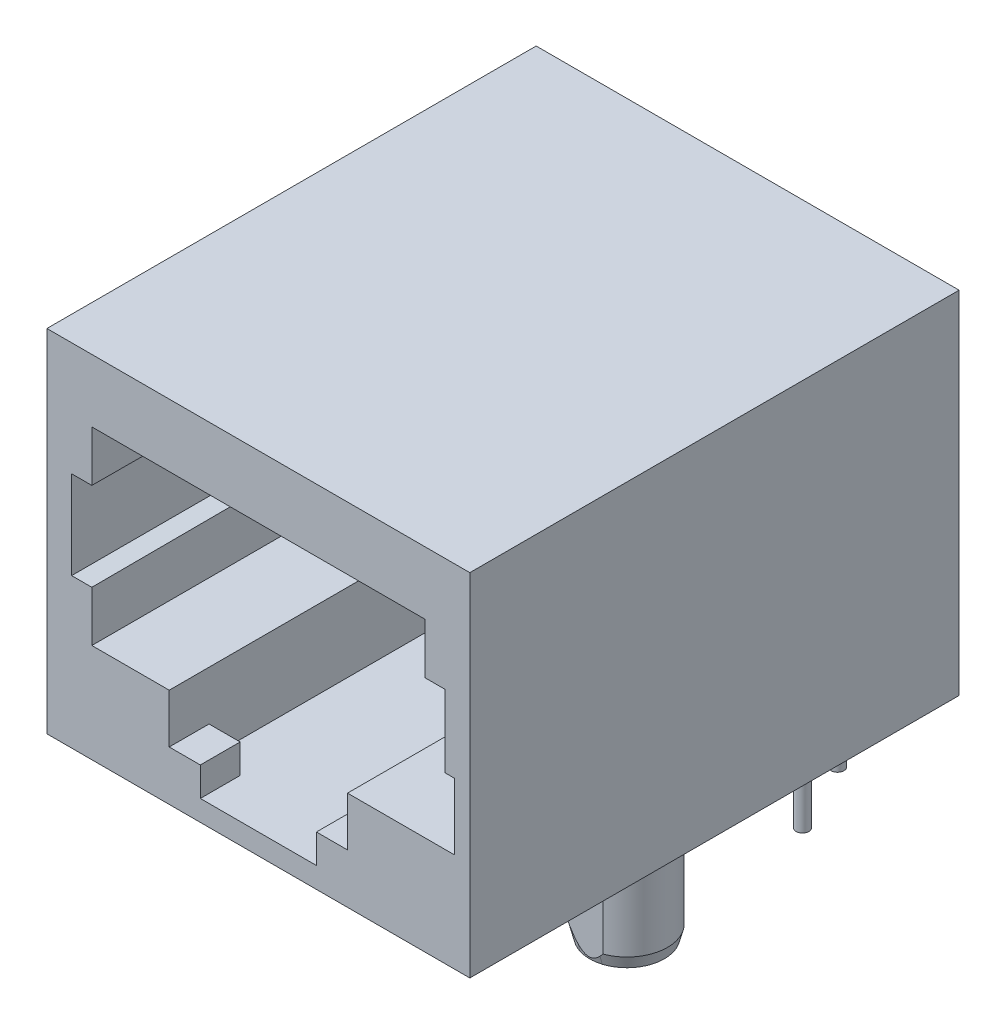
ISO-10303-21;
HEADER;
FILE_DESCRIPTION(('STEP AP214'),'2;1');
FILE_NAME('part.step','',(''),(''),'','','');
FILE_SCHEMA(('AUTOMOTIVE_DESIGN { 1 0 10303 214 1 1 1 1 }'));
ENDSEC;
DATA;
#1=APPLICATION_CONTEXT('core data for automotive mechanical design processes');
#2=APPLICATION_PROTOCOL_DEFINITION('international standard','automotive_design',2000,#1);
#3=PRODUCT_CONTEXT('',#1,'mechanical');
#4=PRODUCT('Part','Part','',(#3));
#5=PRODUCT_RELATED_PRODUCT_CATEGORY('part','',(#4));
#6=PRODUCT_DEFINITION_FORMATION('','',#4);
#7=PRODUCT_DEFINITION_CONTEXT('part definition',#1,'design');
#8=PRODUCT_DEFINITION('design','',#6,#7);
#9=PRODUCT_DEFINITION_SHAPE('','',#8);
#10=(LENGTH_UNIT() NAMED_UNIT(*) SI_UNIT(.MILLI.,.METRE.));
#11=(NAMED_UNIT(*) PLANE_ANGLE_UNIT() SI_UNIT($,.RADIAN.));
#12=(NAMED_UNIT(*) SI_UNIT($,.STERADIAN.) SOLID_ANGLE_UNIT());
#13=UNCERTAINTY_MEASURE_WITH_UNIT(LENGTH_MEASURE(1.E-05),#10,'distance_accuracy_value','');
#14=(GEOMETRIC_REPRESENTATION_CONTEXT(3) GLOBAL_UNCERTAINTY_ASSIGNED_CONTEXT((#13)) GLOBAL_UNIT_ASSIGNED_CONTEXT((#10,
#11,#12)) REPRESENTATION_CONTEXT('',''));
#15=CARTESIAN_POINT('',(0.,0.,0.));
#16=DIRECTION('',(0.,0.,1.));
#17=DIRECTION('',(1.,0.,0.));
#18=AXIS2_PLACEMENT_3D('',#15,#16,#17);
#19=CARTESIAN_POINT('',(-5.715,0.175000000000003,-7.62));
#20=DIRECTION('',(0.,1.,0.));
#21=DIRECTION('',(1.,0.,0.));
#22=AXIS2_PLACEMENT_3D('',#19,#20,#21);
#23=CYLINDRICAL_SURFACE('',#22,1.775);
#24=CARTESIAN_POINT('',(-5.715,-1.92999999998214,-7.62));
#25=DIRECTION('',(0.,1.,0.));
#26=DIRECTION('',(-1.,0.,0.));
#27=AXIS2_PLACEMENT_3D('',#24,#25,#26);
#28=CIRCLE('',#27,1.77499999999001);
#29=CARTESIAN_POINT('',(-4.59250278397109,-1.92999999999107,-8.99499999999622));
#30=VERTEX_POINT('',#29);
#31=CARTESIAN_POINT('',(-4.59250278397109,-1.92999999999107,-6.24500000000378));
#32=VERTEX_POINT('',#31);
#33=EDGE_CURVE('E499',#30,#32,#28,.F.);
#34=ORIENTED_EDGE('',*,*,#33,.F.);
#35=DIRECTION('',(0.,1.,0.));
#36=VECTOR('',#35,1.);
#37=CARTESIAN_POINT('',(-4.59250278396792,0.175000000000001,-8.99500000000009));
#38=LINE('',#37,#36);
#39=CARTESIAN_POINT('',(-4.59250278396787,-1.73,-8.99500000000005));
#40=VERTEX_POINT('',#39);
#41=EDGE_CURVE('E489',#30,#40,#38,.T.);
#42=ORIENTED_EDGE('',*,*,#41,.T.);
#43=CARTESIAN_POINT('',(-5.715,-1.73,-7.62));
#44=DIRECTION('',(0.,1.,0.));
#45=DIRECTION('',(1.,0.,0.));
#46=AXIS2_PLACEMENT_3D('',#43,#44,#45);
#47=CIRCLE('',#46,1.775);
#48=CARTESIAN_POINT('',(-4.59250278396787,-1.73,-6.24499999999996));
#49=VERTEX_POINT('',#48);
#50=EDGE_CURVE('E501',#49,#40,#47,.T.);
#51=ORIENTED_EDGE('',*,*,#50,.F.);
#52=DIRECTION('',(0.,1.,0.));
#53=VECTOR('',#52,1.);
#54=CARTESIAN_POINT('',(-4.59250278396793,0.175,-6.24499999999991));
#55=LINE('',#54,#53);
#56=EDGE_CURVE('E2083',#49,#32,#55,.F.);
#57=ORIENTED_EDGE('',*,*,#56,.T.);
#58=EDGE_LOOP('',(#34,#42,#51,#57));
#59=FACE_BOUND('',#58,.T.);
#60=ADVANCED_FACE('F14',(#59),#23,.T.);
#61=CARTESIAN_POINT('',(-5.715,-3.5,-7.62));
#62=DIRECTION('',(0.,1.,0.));
#63=DIRECTION('',(1.,0.,0.));
#64=AXIS2_PLACEMENT_3D('',#61,#62,#63);
#65=PLANE('',#64);
#66=CARTESIAN_POINT('',(-5.715,-3.49999999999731,-7.62));
#67=DIRECTION('',(0.,1.,0.));
#68=DIRECTION('',(1.,0.,0.));
#69=AXIS2_PLACEMENT_3D('',#66,#67,#68);
#70=CIRCLE('',#69,1.35431976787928);
#71=CARTESIAN_POINT('',(-5.31500000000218,-3.49999999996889,-6.32609813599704));
#72=VERTEX_POINT('',#71);
#73=CARTESIAN_POINT('',(-6.11499999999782,-3.49999999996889,-6.32609813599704));
#74=VERTEX_POINT('',#73);
#75=EDGE_CURVE('E490',#72,#74,#70,.T.);
#76=ORIENTED_EDGE('',*,*,#75,.F.);
#77=CARTESIAN_POINT('',(-5.715,-3.49999999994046,-7.62));
#78=DIRECTION('',(0.,1.,0.));
#79=DIRECTION('',(1.,0.,0.));
#80=AXIS2_PLACEMENT_3D('',#77,#78,#79);
#81=CIRCLE('',#80,1.35431976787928);
#82=EDGE_CURVE('E17',#74,#72,#81,.T.);
#83=ORIENTED_EDGE('',*,*,#82,.F.);
#84=EDGE_LOOP('',(#76,#83));
#85=FACE_BOUND('',#84,.T.);
#86=ADVANCED_FACE('F491',(#85),#65,.F.);
#87=CARTESIAN_POINT('',(-5.715,-3.20835290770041,-7.62));
#88=DIRECTION('',(0.,1.,0.));
#89=DIRECTION('',(1.,0.,0.));
#90=AXIS2_PLACEMENT_3D('',#87,#88,#89);
#91=CONICAL_SURFACE('',#90,1.43246637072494,0.261799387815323);
#92=CARTESIAN_POINT('',(-5.31500000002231,-3.21009212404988,-6.24500000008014));
#93=CARTESIAN_POINT('',(-5.31494576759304,-3.22217136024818,-6.24838657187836));
#94=CARTESIAN_POINT('',(-5.31489832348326,-3.23425085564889,-6.25177232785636));
#95=CARTESIAN_POINT('',(-5.31481700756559,-3.25840984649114,-6.25854202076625));
#96=CARTESIAN_POINT('',(-5.31478313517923,-3.27048934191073,-6.26192595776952));
#97=CARTESIAN_POINT('',(-5.31472895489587,-3.29464833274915,-6.2686919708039));
#98=CARTESIAN_POINT('',(-5.31470864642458,-3.30672782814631,-6.27207404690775));
#99=CARTESIAN_POINT('',(-5.31468158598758,-3.33088681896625,-6.27883629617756));
#100=CARTESIAN_POINT('',(-5.3146748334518,-3.34296631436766,-6.28221646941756));
#101=CARTESIAN_POINT('',(-5.31467487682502,-3.36712530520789,-6.28897487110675));
#102=CARTESIAN_POINT('',(-5.31468167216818,-3.37920480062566,-6.29235309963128));
#103=CARTESIAN_POINT('',(-5.31470880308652,-3.4033637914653,-6.29910756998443));
#104=CARTESIAN_POINT('',(-5.31472913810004,-3.4154432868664,-6.30248381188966));
#105=CARTESIAN_POINT('',(-5.31478334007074,-3.43960227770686,-6.30923426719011));
#106=CARTESIAN_POINT('',(-5.31481720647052,-3.45168177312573,-6.31260848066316));
#107=CARTESIAN_POINT('',(-5.31489846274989,-3.47584076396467,-6.31935483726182));
#108=CARTESIAN_POINT('',(-5.31494585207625,-3.48792025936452,-6.32272698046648));
#109=CARTESIAN_POINT('',(-5.31500000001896,-3.50000000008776,-6.32609813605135));
#110=B_SPLINE_CURVE_WITH_KNOTS('',3,(#92,#93,#94,#95,#96,#97,#98,#99,#100,#101,#102,#103,#104,
#105,#106,#107,#108,#109),.UNSPECIFIED.,.F.,.F.,(4,2,2,2,2,2,2,2,4),(0.,0.0376353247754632,
0.0752690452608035,0.112901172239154,0.150531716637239,0.188160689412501,0.225788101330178,
0.263413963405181,0.301038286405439),.UNSPECIFIED.);
#111=CARTESIAN_POINT('',(-5.31500000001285,-3.21009212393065,-6.24500000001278));
#112=VERTEX_POINT('',#111);
#113=EDGE_CURVE('E483',#112,#72,#110,.T.);
#114=ORIENTED_EDGE('',*,*,#113,.F.);
#115=CARTESIAN_POINT('',(-5.31500000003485,-3.21009212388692,-6.24500000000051));
#116=CARTESIAN_POINT('',(-5.33143537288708,-3.22719630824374,-6.24500000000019));
#117=CARTESIAN_POINT('',(-5.34831231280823,-3.24384453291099,-6.24500000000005));
#118=CARTESIAN_POINT('',(-5.3833300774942,-3.27603283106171,-6.24499999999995));
#119=CARTESIAN_POINT('',(-5.40147976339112,-3.29156320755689,-6.24499999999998));
#120=CARTESIAN_POINT('',(-5.45889334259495,-3.33646260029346,-6.24500000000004));
#121=CARTESIAN_POINT('',(-5.5003803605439,-3.36330984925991,-6.245));
#122=CARTESIAN_POINT('',(-5.56549656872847,-3.39313738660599,-6.245));
#123=CARTESIAN_POINT('',(-5.58677855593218,-3.40119726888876,-6.245));
#124=CARTESIAN_POINT('',(-5.6302370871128,-3.41370860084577,-6.245));
#125=CARTESIAN_POINT('',(-5.65240547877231,-3.41818736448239,-6.245));
#126=CARTESIAN_POINT('',(-5.69740826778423,-3.42309122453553,-6.245));
#127=CARTESIAN_POINT('',(-5.72024690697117,-3.42347879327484,-6.245));
#128=CARTESIAN_POINT('',(-5.76562711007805,-3.42004369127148,-6.245));
#129=CARTESIAN_POINT('',(-5.78816815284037,-3.41621442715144,-6.245));
#130=CARTESIAN_POINT('',(-5.83619510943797,-3.40383498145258,-6.245));
#131=CARTESIAN_POINT('',(-5.8614912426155,-3.39456595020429,-6.245));
#132=CARTESIAN_POINT('',(-5.91037473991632,-3.37207449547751,-6.245));
#133=CARTESIAN_POINT('',(-5.93395078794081,-3.35882839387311,-6.245));
#134=CARTESIAN_POINT('',(-5.98601164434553,-3.32522061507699,-6.245));
#135=CARTESIAN_POINT('',(-6.01386916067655,-3.30391450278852,-6.245));
#136=CARTESIAN_POINT('',(-6.0664652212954,-3.25864647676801,-6.245));
#137=CARTESIAN_POINT('',(-6.09125252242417,-3.23474196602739,-6.245));
#138=CARTESIAN_POINT('',(-6.11499995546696,-3.21009217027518,-6.245));
#139=B_SPLINE_CURVE_WITH_KNOTS('',3,(#115,#116,#117,#118,#119,#120,#121,#122,#123,#124,#125,
#126,#127,#128,#129,#130,#131,#132,#133,#134,#135,#136,#137,#138),.UNSPECIFIED.,.F.,.F.,(4,2,2,
2,2,2,2,2,2,2,2,4),(0.,0.071093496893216,0.142743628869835,0.289358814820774,0.357388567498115,
0.424894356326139,0.493018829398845,0.561249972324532,0.641623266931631,0.722484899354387,
0.827411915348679,0.930368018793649),.UNSPECIFIED.);
#140=CARTESIAN_POINT('',(-6.11499997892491,-3.21009236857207,-6.24500006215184));
#141=VERTEX_POINT('',#140);
#142=EDGE_CURVE('E2112',#112,#141,#139,.T.);
#143=ORIENTED_EDGE('',*,*,#142,.T.);
#144=CARTESIAN_POINT('',(-6.11499999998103,-3.50000000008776,-6.32609813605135));
#145=CARTESIAN_POINT('',(-6.11505414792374,-3.48792025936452,-6.32272698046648));
#146=CARTESIAN_POINT('',(-6.11510153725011,-3.47584076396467,-6.31935483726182));
#147=CARTESIAN_POINT('',(-6.11518279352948,-3.45168177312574,-6.31260848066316));
#148=CARTESIAN_POINT('',(-6.11521665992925,-3.43960227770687,-6.30923426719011));
#149=CARTESIAN_POINT('',(-6.11527086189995,-3.4154432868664,-6.30248381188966));
#150=CARTESIAN_POINT('',(-6.11529119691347,-3.4033637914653,-6.29910756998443));
#151=CARTESIAN_POINT('',(-6.11531832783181,-3.37920480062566,-6.29235309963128));
#152=CARTESIAN_POINT('',(-6.11532512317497,-3.3671253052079,-6.28897487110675));
#153=CARTESIAN_POINT('',(-6.11532516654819,-3.34296631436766,-6.28221646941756));
#154=CARTESIAN_POINT('',(-6.11531841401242,-3.33088681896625,-6.27883629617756));
#155=CARTESIAN_POINT('',(-6.11529135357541,-3.30672782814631,-6.27207404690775));
#156=CARTESIAN_POINT('',(-6.11527104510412,-3.29464833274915,-6.2686919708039));
#157=CARTESIAN_POINT('',(-6.11521686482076,-3.27048934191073,-6.26192595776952));
#158=CARTESIAN_POINT('',(-6.1151829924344,-3.25840984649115,-6.25854202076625));
#159=CARTESIAN_POINT('',(-6.11510167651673,-3.23425085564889,-6.25177232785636));
#160=CARTESIAN_POINT('',(-6.11505423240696,-3.22217136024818,-6.24838657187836));
#161=CARTESIAN_POINT('',(-6.11499999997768,-3.21009212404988,-6.24500000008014));
#162=B_SPLINE_CURVE_WITH_KNOTS('',3,(#144,#145,#146,#147,#148,#149,#150,#151,#152,#153,#154,
#155,#156,#157,#158,#159,#160,#161),.UNSPECIFIED.,.F.,.F.,(4,2,2,2,2,2,2,2,4),(0.,
0.0376243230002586,0.0752501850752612,0.112877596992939,0.1505065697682,0.188137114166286,
0.225769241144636,0.263402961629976,0.301038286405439),.UNSPECIFIED.);
#163=EDGE_CURVE('E486',#74,#141,#162,.T.);
#164=ORIENTED_EDGE('',*,*,#163,.F.);
#165=ORIENTED_EDGE('',*,*,#82,.T.);
#166=EDGE_LOOP('',(#114,#143,#164,#165));
#167=FACE_BOUND('',#166,.T.);
#168=ADVANCED_FACE('F481',(#167),#91,.T.);
#169=CARTESIAN_POINT('',(5.715,-3.50000000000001,-7.62));
#170=DIRECTION('',(0.,-1.,0.));
#171=DIRECTION('',(-1.,0.,0.));
#172=AXIS2_PLACEMENT_3D('',#169,#170,#171);
#173=PLANE('',#172);
#174=CARTESIAN_POINT('',(5.715,-3.49999999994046,-7.62));
#175=DIRECTION('',(0.,1.,0.));
#176=DIRECTION('',(1.,0.,0.));
#177=AXIS2_PLACEMENT_3D('',#174,#175,#176);
#178=CIRCLE('',#177,1.35431976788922);
#179=CARTESIAN_POINT('',(5.31500000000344,-3.49999999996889,-6.32609813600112));
#180=VERTEX_POINT('',#179);
#181=CARTESIAN_POINT('',(6.11499999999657,-3.49999999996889,-6.32609813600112));
#182=VERTEX_POINT('',#181);
#183=EDGE_CURVE('E488',#180,#182,#178,.T.);
#184=ORIENTED_EDGE('',*,*,#183,.F.);
#185=CARTESIAN_POINT('',(5.715,-3.49999999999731,-7.62));
#186=DIRECTION('',(0.,1.,0.));
#187=DIRECTION('',(1.,0.,0.));
#188=AXIS2_PLACEMENT_3D('',#185,#186,#187);
#189=CIRCLE('',#188,1.3543197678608);
#190=EDGE_CURVE('E720',#182,#180,#189,.T.);
#191=ORIENTED_EDGE('',*,*,#190,.F.);
#192=EDGE_LOOP('',(#184,#191));
#193=FACE_BOUND('',#192,.T.);
#194=ADVANCED_FACE('F2052',(#193),#173,.T.);
#195=CARTESIAN_POINT('',(5.715,-3.20835290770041,-7.62));
#196=DIRECTION('',(0.,1.,0.));
#197=DIRECTION('',(1.,0.,0.));
#198=AXIS2_PLACEMENT_3D('',#195,#196,#197);
#199=CONICAL_SURFACE('',#198,1.43246637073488,0.261799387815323);
#200=CARTESIAN_POINT('',(6.11499999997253,-3.21009212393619,-6.24500000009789));
#201=CARTESIAN_POINT('',(6.1150542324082,-3.22217136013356,-6.24838657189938));
#202=CARTESIAN_POINT('',(6.11510167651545,-3.23425085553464,-6.2517723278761));
#203=CARTESIAN_POINT('',(6.11518299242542,-3.25840984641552,-6.25854202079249));
#204=CARTESIAN_POINT('',(6.11521686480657,-3.27048934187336,-6.26192595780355));
#205=CARTESIAN_POINT('',(6.11527104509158,-3.29464833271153,-6.26869197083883));
#206=CARTESIAN_POINT('',(6.11529135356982,-3.30672782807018,-6.27207404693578));
#207=CARTESIAN_POINT('',(6.11531841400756,-3.33088681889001,-6.27883629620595));
#208=CARTESIAN_POINT('',(6.11532516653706,-3.34296631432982,-6.28221646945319));
#209=CARTESIAN_POINT('',(6.11532512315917,-3.36712530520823,-6.28897487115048));
#210=CARTESIAN_POINT('',(6.11531832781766,-3.37920480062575,-6.29235309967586));
#211=CARTESIAN_POINT('',(6.11529119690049,-3.40336379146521,-6.29910757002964));
#212=CARTESIAN_POINT('',(6.1152708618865,-3.41544328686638,-6.30248381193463));
#213=CARTESIAN_POINT('',(6.11521665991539,-3.43960227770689,-6.30923426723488));
#214=CARTESIAN_POINT('',(6.11518279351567,-3.45168177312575,-6.31260848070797));
#215=CARTESIAN_POINT('',(6.11510153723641,-3.47584076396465,-6.3193548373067));
#216=CARTESIAN_POINT('',(6.11505414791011,-3.48792025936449,-6.32272698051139));
#217=CARTESIAN_POINT('',(6.11499999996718,-3.50000000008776,-6.32609813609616));
#218=B_SPLINE_CURVE_WITH_KNOTS('',3,(#200,#201,#202,#203,#204,#205,#206,#207,#208,#209,#210,
#211,#212,#213,#214,#215,#216,#217),.UNSPECIFIED.,.F.,.F.,(4,2,2,2,2,2,2,2,4),(0.,
0.03763532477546,0.0752690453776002,0.112901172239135,0.15053171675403,0.188160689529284,
0.225788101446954,0.263413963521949,0.3010382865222),.UNSPECIFIED.);
#219=CARTESIAN_POINT('',(6.11499999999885,-3.21009212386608,-6.24500000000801));
#220=VERTEX_POINT('',#219);
#221=EDGE_CURVE('E721',#220,#182,#218,.T.);
#222=ORIENTED_EDGE('',*,*,#221,.F.);
#223=CARTESIAN_POINT('',(6.11500000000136,-3.21009212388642,-6.245));
#224=CARTESIAN_POINT('',(6.09856462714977,-3.22719630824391,-6.245));
#225=CARTESIAN_POINT('',(6.08168768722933,-3.24384453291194,-6.245));
#226=CARTESIAN_POINT('',(6.04666992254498,-3.27603283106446,-6.245));
#227=CARTESIAN_POINT('',(6.02852023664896,-3.29156320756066,-6.245));
#228=CARTESIAN_POINT('',(5.97110665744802,-3.336462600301,-6.245));
#229=CARTESIAN_POINT('',(5.92961963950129,-3.36330984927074,-6.245));
#230=CARTESIAN_POINT('',(5.86450343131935,-3.39313738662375,-6.245));
#231=CARTESIAN_POINT('',(5.84322144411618,-3.40119726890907,-6.245));
#232=CARTESIAN_POINT('',(5.79976291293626,-3.41370860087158,-6.245));
#233=CARTESIAN_POINT('',(5.7775945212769,-3.41818736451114,-6.245));
#234=CARTESIAN_POINT('',(5.73259173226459,-3.42309122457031,-6.245));
#235=CARTESIAN_POINT('',(5.70975309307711,-3.42347879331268,-6.245));
#236=CARTESIAN_POINT('',(5.66437288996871,-3.42004369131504,-6.245));
#237=CARTESIAN_POINT('',(5.64183184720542,-3.41621442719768,-6.245));
#238=CARTESIAN_POINT('',(5.59380489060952,-3.40383498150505,-6.245));
#239=CARTESIAN_POINT('',(5.5685087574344,-3.39456595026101,-6.245));
#240=CARTESIAN_POINT('',(5.5196252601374,-3.37207449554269,-6.245));
#241=CARTESIAN_POINT('',(5.49604921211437,-3.35882839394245,-6.245));
#242=CARTESIAN_POINT('',(5.44398835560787,-3.32522061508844,-6.245));
#243=CARTESIAN_POINT('',(5.41613083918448,-3.3039145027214,-6.245));
#244=CARTESIAN_POINT('',(5.3635347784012,-3.25864647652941,-6.245));
#245=CARTESIAN_POINT('',(5.33874747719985,-3.23474196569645,-6.245));
#246=CARTESIAN_POINT('',(5.31500004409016,-3.21009216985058,-6.245));
#247=B_SPLINE_CURVE_WITH_KNOTS('',3,(#223,#224,#225,#226,#227,#228,#229,#230,#231,#232,#233,
#234,#235,#236,#237,#238,#239,#240,#241,#242,#243,#244,#245,#246),.UNSPECIFIED.,.F.,.F.,(4,2,2,
2,2,2,2,2,2,2,2,4),(0.,0.0710934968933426,0.142743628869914,0.289358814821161,0.357388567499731,
0.42489435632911,0.49301882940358,0.561249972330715,0.641623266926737,0.722484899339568,
0.827411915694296,0.930368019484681),.UNSPECIFIED.);
#248=CARTESIAN_POINT('',(5.31500004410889,-3.2100921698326,-6.245));
#249=VERTEX_POINT('',#248);
#250=EDGE_CURVE('E747',#220,#249,#247,.T.);
#251=ORIENTED_EDGE('',*,*,#250,.T.);
#252=CARTESIAN_POINT('',(5.31500000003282,-3.50000000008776,-6.32609813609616));
#253=CARTESIAN_POINT('',(5.3149458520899,-3.48792025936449,-6.32272698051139));
#254=CARTESIAN_POINT('',(5.31489846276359,-3.47584076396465,-6.3193548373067));
#255=CARTESIAN_POINT('',(5.31481720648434,-3.45168177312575,-6.31260848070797));
#256=CARTESIAN_POINT('',(5.31478334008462,-3.43960227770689,-6.30923426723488));
#257=CARTESIAN_POINT('',(5.31472913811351,-3.41544328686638,-6.30248381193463));
#258=CARTESIAN_POINT('',(5.31470880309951,-3.40336379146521,-6.29910757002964));
#259=CARTESIAN_POINT('',(5.31468167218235,-3.37920480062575,-6.29235309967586));
#260=CARTESIAN_POINT('',(5.31467487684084,-3.36712530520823,-6.28897487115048));
#261=CARTESIAN_POINT('',(5.31467483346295,-3.34296631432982,-6.28221646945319));
#262=CARTESIAN_POINT('',(5.31468158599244,-3.33088681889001,-6.27883629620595));
#263=CARTESIAN_POINT('',(5.31470864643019,-3.30672782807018,-6.27207404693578));
#264=CARTESIAN_POINT('',(5.31472895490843,-3.29464833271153,-6.26869197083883));
#265=CARTESIAN_POINT('',(5.31478313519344,-3.27048934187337,-6.26192595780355));
#266=CARTESIAN_POINT('',(5.31481700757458,-3.25840984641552,-6.25854202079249));
#267=CARTESIAN_POINT('',(5.31489832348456,-3.23425085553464,-6.2517723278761));
#268=CARTESIAN_POINT('',(5.3149457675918,-3.22217136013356,-6.24838657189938));
#269=CARTESIAN_POINT('',(5.31500000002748,-3.21009212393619,-6.24500000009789));
#270=B_SPLINE_CURVE_WITH_KNOTS('',3,(#252,#253,#254,#255,#256,#257,#258,#259,#260,#261,#262,
#263,#264,#265,#266,#267,#268,#269),.UNSPECIFIED.,.F.,.F.,(4,2,2,2,2,2,2,2,4),(0.,
0.0376243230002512,0.0752501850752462,0.112877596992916,0.15050656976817,0.188137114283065,
0.2257692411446,0.26340296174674,0.3010382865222),.UNSPECIFIED.);
#271=EDGE_CURVE('E715',#180,#249,#270,.T.);
#272=ORIENTED_EDGE('',*,*,#271,.F.);
#273=ORIENTED_EDGE('',*,*,#183,.T.);
#274=EDGE_LOOP('',(#222,#251,#272,#273));
#275=FACE_BOUND('',#274,.T.);
#276=ADVANCED_FACE('F2044',(#275),#199,.T.);
#277=CARTESIAN_POINT('',(5.715,0.175,-7.62));
#278=DIRECTION('',(0.,-1.,0.));
#279=DIRECTION('',(-1.,0.,0.));
#280=AXIS2_PLACEMENT_3D('',#277,#278,#279);
#281=CYLINDRICAL_SURFACE('',#280,1.775);
#282=CARTESIAN_POINT('',(5.715,-1.73,-7.62));
#283=DIRECTION('',(0.,-1.,0.));
#284=DIRECTION('',(-1.,0.,0.));
#285=AXIS2_PLACEMENT_3D('',#282,#283,#284);
#286=CIRCLE('',#285,1.775);
#287=CARTESIAN_POINT('',(4.59250278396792,-1.73,-6.245));
#288=VERTEX_POINT('',#287);
#289=CARTESIAN_POINT('',(4.59250278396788,-1.73,-8.99500000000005));
#290=VERTEX_POINT('',#289);
#291=EDGE_CURVE('E756',#288,#290,#286,.T.);
#292=ORIENTED_EDGE('',*,*,#291,.T.);
#293=DIRECTION('',(0.,-1.,0.));
#294=VECTOR('',#293,1.);
#295=CARTESIAN_POINT('',(4.59250278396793,0.175,-8.99500000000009));
#296=LINE('',#295,#294);
#297=CARTESIAN_POINT('',(4.59250278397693,-1.92999999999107,-8.99499999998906));
#298=VERTEX_POINT('',#297);
#299=EDGE_CURVE('E708',#290,#298,#296,.T.);
#300=ORIENTED_EDGE('',*,*,#299,.T.);
#301=CARTESIAN_POINT('',(5.715,-1.92999999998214,-7.62));
#302=DIRECTION('',(0.,1.,0.));
#303=DIRECTION('',(-1.,0.,0.));
#304=AXIS2_PLACEMENT_3D('',#301,#302,#303);
#305=CIRCLE('',#304,1.77499999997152);
#306=CARTESIAN_POINT('',(4.59250278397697,-1.92999999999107,-6.24500000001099));
#307=VERTEX_POINT('',#306);
#308=EDGE_CURVE('E709',#307,#298,#305,.F.);
#309=ORIENTED_EDGE('',*,*,#308,.F.);
#310=DIRECTION('',(0.,1.,0.));
#311=VECTOR('',#310,1.);
#312=CARTESIAN_POINT('',(4.592502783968,0.,-6.245));
#313=LINE('',#312,#311);
#314=EDGE_CURVE('E744',#307,#288,#313,.T.);
#315=ORIENTED_EDGE('',*,*,#314,.T.);
#316=EDGE_LOOP('',(#292,#300,#309,#315));
#317=FACE_BOUND('',#316,.T.);
#318=ADVANCED_FACE('F2037',(#317),#281,.T.);
#319=CARTESIAN_POINT('',(3.225,2.45,-11.1));
#320=DIRECTION('',(0.,1.,0.));
#321=DIRECTION('',(1.,0.,0.));
#322=AXIS2_PLACEMENT_3D('',#319,#320,#321);
#323=PLANE('',#322);
#324=DIRECTION('',(1.,0.,0.));
#325=VECTOR('',#324,1.);
#326=CARTESIAN_POINT('',(0.,2.45,-11.1));
#327=LINE('',#326,#325);
#328=CARTESIAN_POINT('',(-3.225,2.45,-11.1));
#329=VERTEX_POINT('',#328);
#330=CARTESIAN_POINT('',(3.225,2.45,-11.1));
#331=VERTEX_POINT('',#330);
#332=EDGE_CURVE('E871',#329,#331,#327,.T.);
#333=ORIENTED_EDGE('',*,*,#332,.F.);
#334=DIRECTION('',(0.,0.,-1.));
#335=VECTOR('',#334,1.);
#336=CARTESIAN_POINT('',(-3.225,2.45,-11.1));
#337=LINE('',#336,#335);
#338=CARTESIAN_POINT('',(-3.225,2.45,-12.64));
#339=VERTEX_POINT('',#338);
#340=EDGE_CURVE('E706',#339,#329,#337,.F.);
#341=ORIENTED_EDGE('',*,*,#340,.F.);
#342=DIRECTION('',(1.,0.,0.));
#343=VECTOR('',#342,1.);
#344=CARTESIAN_POINT('',(-6.4,2.45,-12.64));
#345=LINE('',#344,#343);
#346=CARTESIAN_POINT('',(3.225,2.45,-12.64));
#347=VERTEX_POINT('',#346);
#348=EDGE_CURVE('E891',#347,#339,#345,.F.);
#349=ORIENTED_EDGE('',*,*,#348,.F.);
#350=DIRECTION('',(0.,0.,-1.));
#351=VECTOR('',#350,1.);
#352=CARTESIAN_POINT('',(3.225,2.45,-11.1));
#353=LINE('',#352,#351);
#354=EDGE_CURVE('E580',#331,#347,#353,.T.);
#355=ORIENTED_EDGE('',*,*,#354,.F.);
#356=EDGE_LOOP('',(#333,#341,#349,#355));
#357=FACE_BOUND('',#356,.T.);
#358=ADVANCED_FACE('F2030',(#357),#323,.F.);
#359=CARTESIAN_POINT('',(-4.58999999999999,10.8962555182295,-3.69187224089));
#360=DIRECTION('',(1.,0.,0.));
#361=DIRECTION('',(0.,-1.,0.));
#362=AXIS2_PLACEMENT_3D('',#359,#360,#361);
#363=TOROIDAL_SURFACE('',#362,0.503744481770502,0.23);
#364=CARTESIAN_POINT('',(-4.80834081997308,10.3973863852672,-3.40385001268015));
#365=CARTESIAN_POINT('',(-4.80434470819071,10.3979316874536,-3.37870552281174));
#366=CARTESIAN_POINT('',(-4.79875660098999,10.3984807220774,-3.35338892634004));
#367=CARTESIAN_POINT('',(-4.78296180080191,10.3995555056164,-3.3038294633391));
#368=CARTESIAN_POINT('',(-4.77267942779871,10.4000807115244,-3.27961163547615));
#369=CARTESIAN_POINT('',(-4.75303452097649,10.4008018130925,-3.24636084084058));
#370=CARTESIAN_POINT('',(-4.74598855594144,10.4010266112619,-3.23599514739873));
#371=CARTESIAN_POINT('',(-4.73046331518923,10.401450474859,-3.21645032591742));
#372=CARTESIAN_POINT('',(-4.72198984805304,10.40164963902,-3.20726664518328));
#373=CARTESIAN_POINT('',(-4.70348931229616,10.4020163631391,-3.19035658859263));
#374=CARTESIAN_POINT('',(-4.69344515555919,10.402183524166,-3.18264860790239));
#375=CARTESIAN_POINT('',(-4.67203854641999,10.4024726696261,-3.16931578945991));
#376=CARTESIAN_POINT('',(-4.66067645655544,10.4025946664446,-3.16369038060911));
#377=CARTESIAN_POINT('',(-4.63846912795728,10.4027720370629,-3.15551162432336));
#378=CARTESIAN_POINT('',(-4.62773204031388,10.4028337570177,-3.15266564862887));
#379=CARTESIAN_POINT('',(-4.60591116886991,10.4029104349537,-3.14912994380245));
#380=CARTESIAN_POINT('',(-4.59482772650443,10.4029254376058,-3.14843815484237));
#381=CARTESIAN_POINT('',(-4.574236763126,10.4029088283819,-3.14920402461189));
#382=CARTESIAN_POINT('',(-4.56471791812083,10.4028832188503,-3.15038490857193));
#383=CARTESIAN_POINT('',(-4.54600717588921,10.4027978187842,-3.1543228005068));
#384=CARTESIAN_POINT('',(-4.53681567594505,10.4027379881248,-3.15708165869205));
#385=CARTESIAN_POINT('',(-4.51008114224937,10.4025112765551,-3.16753558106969));
#386=CARTESIAN_POINT('',(-4.49336569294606,10.4022971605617,-3.1774087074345));
#387=CARTESIAN_POINT('',(-4.45776292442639,10.4016832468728,-3.20571694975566));
#388=CARTESIAN_POINT('',(-4.44037163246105,10.4012440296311,-3.22596974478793));
#389=CARTESIAN_POINT('',(-4.41602865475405,10.4004218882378,-3.26387959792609));
#390=CARTESIAN_POINT('',(-4.40751408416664,10.4000586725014,-3.28062787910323));
#391=CARTESIAN_POINT('',(-4.39315444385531,10.3993075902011,-3.3152611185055));
#392=CARTESIAN_POINT('',(-4.38731664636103,10.3989196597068,-3.33314902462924));
#393=CARTESIAN_POINT('',(-4.37802332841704,10.3981498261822,-3.36864690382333));
#394=CARTESIAN_POINT('',(-4.37446884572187,10.3977684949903,-3.38623050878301));
#395=CARTESIAN_POINT('',(-4.37165918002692,10.3973863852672,-3.40385001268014));
#396=B_SPLINE_CURVE_WITH_KNOTS('',3,(#364,#365,#366,#367,#368,#369,#370,#371,#372,#373,#374,
#375,#376,#377,#378,#379,#380,#381,#382,#383,#384,#385,#386,#387,#388,#389,#390,#391,#392,#393,
#394,#395),.UNSPECIFIED.,.F.,.F.,(4,2,2,2,2,2,2,2,2,2,2,2,2,2,2,4),(0.,0.0770471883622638,
0.155382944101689,0.192867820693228,0.230203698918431,0.267978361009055,0.305742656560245,
0.338864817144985,0.371955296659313,0.400591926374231,0.429262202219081,0.486567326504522,
0.565138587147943,0.621286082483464,0.677585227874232,0.731241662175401),.UNSPECIFIED.);
#397=CARTESIAN_POINT('',(-4.80834081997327,10.3973863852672,-3.40385001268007));
#398=VERTEX_POINT('',#397);
#399=CARTESIAN_POINT('',(-4.37165918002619,10.3973863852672,-3.40385001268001));
#400=VERTEX_POINT('',#399);
#401=EDGE_CURVE('E2145',#398,#400,#396,.T.);
#402=ORIENTED_EDGE('',*,*,#401,.F.);
#403=CARTESIAN_POINT('',(-4.59,10.4599999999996,-3.44000000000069));
#404=DIRECTION('',(0.,-0.500000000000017,-0.866025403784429));
#405=DIRECTION('',(0.,0.866025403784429,-0.500000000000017));
#406=AXIS2_PLACEMENT_3D('',#403,#404,#405);
#407=CIRCLE('',#406,0.23);
#408=EDGE_CURVE('E570',#400,#398,#407,.T.);
#409=ORIENTED_EDGE('',*,*,#408,.F.);
#410=EDGE_LOOP('',(#402,#409));
#411=FACE_BOUND('',#410,.T.);
#412=ADVANCED_FACE('F693',(#411),#363,.T.);
#413=CARTESIAN_POINT('',(-3.57,10.8962555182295,-3.69187224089));
#414=DIRECTION('',(1.,0.,0.));
#415=DIRECTION('',(0.,-1.,0.));
#416=AXIS2_PLACEMENT_3D('',#413,#414,#415);
#417=TOROIDAL_SURFACE('',#416,0.503744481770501,0.23);
#418=CARTESIAN_POINT('',(-3.78834081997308,10.3973863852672,-3.40385001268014));
#419=CARTESIAN_POINT('',(-3.78434470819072,10.3979316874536,-3.37870552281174));
#420=CARTESIAN_POINT('',(-3.77875660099,10.3984807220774,-3.35338892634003));
#421=CARTESIAN_POINT('',(-3.76296180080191,10.3995555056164,-3.30382946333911));
#422=CARTESIAN_POINT('',(-3.75267942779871,10.4000807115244,-3.27961163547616));
#423=CARTESIAN_POINT('',(-3.7330345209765,10.4008018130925,-3.24636084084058));
#424=CARTESIAN_POINT('',(-3.72598855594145,10.4010266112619,-3.23599514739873));
#425=CARTESIAN_POINT('',(-3.71046331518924,10.401450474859,-3.21645032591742));
#426=CARTESIAN_POINT('',(-3.70198984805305,10.40164963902,-3.20726664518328));
#427=CARTESIAN_POINT('',(-3.68348931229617,10.4020163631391,-3.19035658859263));
#428=CARTESIAN_POINT('',(-3.67344515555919,10.402183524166,-3.18264860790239));
#429=CARTESIAN_POINT('',(-3.65203854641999,10.4024726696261,-3.16931578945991));
#430=CARTESIAN_POINT('',(-3.64067645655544,10.4025946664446,-3.16369038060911));
#431=CARTESIAN_POINT('',(-3.61846912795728,10.4027720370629,-3.15551162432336));
#432=CARTESIAN_POINT('',(-3.60773204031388,10.4028337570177,-3.15266564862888));
#433=CARTESIAN_POINT('',(-3.58591116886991,10.4029104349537,-3.14912994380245));
#434=CARTESIAN_POINT('',(-3.57482772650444,10.4029254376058,-3.14843815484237));
#435=CARTESIAN_POINT('',(-3.554236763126,10.4029088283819,-3.14920402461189));
#436=CARTESIAN_POINT('',(-3.54471791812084,10.4028832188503,-3.15038490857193));
#437=CARTESIAN_POINT('',(-3.52600717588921,10.4027978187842,-3.1543228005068));
#438=CARTESIAN_POINT('',(-3.51681567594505,10.4027379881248,-3.15708165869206));
#439=CARTESIAN_POINT('',(-3.49008114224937,10.4025112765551,-3.16753558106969));
#440=CARTESIAN_POINT('',(-3.47336569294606,10.4022971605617,-3.1774087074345));
#441=CARTESIAN_POINT('',(-3.43776292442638,10.4016832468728,-3.20571694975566));
#442=CARTESIAN_POINT('',(-3.42037163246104,10.4012440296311,-3.22596974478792));
#443=CARTESIAN_POINT('',(-3.39602865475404,10.4004218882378,-3.26387959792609));
#444=CARTESIAN_POINT('',(-3.38751408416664,10.4000586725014,-3.28062787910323));
#445=CARTESIAN_POINT('',(-3.37315444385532,10.3993075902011,-3.31526111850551));
#446=CARTESIAN_POINT('',(-3.36731664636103,10.3989196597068,-3.33314902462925));
#447=CARTESIAN_POINT('',(-3.35802332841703,10.3981498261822,-3.36864690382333));
#448=CARTESIAN_POINT('',(-3.35446884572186,10.3977684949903,-3.386230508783));
#449=CARTESIAN_POINT('',(-3.35165918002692,10.3973863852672,-3.40385001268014));
#450=B_SPLINE_CURVE_WITH_KNOTS('',3,(#418,#419,#420,#421,#422,#423,#424,#425,#426,#427,#428,
#429,#430,#431,#432,#433,#434,#435,#436,#437,#438,#439,#440,#441,#442,#443,#444,#445,#446,#447,
#448,#449),.UNSPECIFIED.,.F.,.F.,(4,2,2,2,2,2,2,2,2,2,2,2,2,2,2,4),(0.,0.0770471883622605,
0.155382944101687,0.192867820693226,0.230203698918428,0.267978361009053,0.305742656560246,
0.338864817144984,0.371955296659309,0.400591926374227,0.429262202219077,0.486567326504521,
0.565138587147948,0.621286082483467,0.677585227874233,0.731241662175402),.UNSPECIFIED.);
#451=CARTESIAN_POINT('',(-3.78834081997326,10.3973863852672,-3.40385001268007));
#452=VERTEX_POINT('',#451);
#453=CARTESIAN_POINT('',(-3.35165918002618,10.3973863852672,-3.40385001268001));
#454=VERTEX_POINT('',#453);
#455=EDGE_CURVE('E678',#452,#454,#450,.T.);
#456=ORIENTED_EDGE('',*,*,#455,.F.);
#457=CARTESIAN_POINT('',(-3.56999999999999,10.4599999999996,-3.44000000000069));
#458=DIRECTION('',(0.,-0.500000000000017,-0.866025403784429));
#459=DIRECTION('',(0.,0.866025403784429,-0.500000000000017));
#460=AXIS2_PLACEMENT_3D('',#457,#458,#459);
#461=CIRCLE('',#460,0.23);
#462=EDGE_CURVE('E566',#454,#452,#461,.T.);
#463=ORIENTED_EDGE('',*,*,#462,.F.);
#464=EDGE_LOOP('',(#456,#463));
#465=FACE_BOUND('',#464,.T.);
#466=ADVANCED_FACE('F687',(#465),#417,.T.);
#467=CARTESIAN_POINT('',(-1.52999999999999,10.8962555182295,-3.69187224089));
#468=DIRECTION('',(1.,0.,0.));
#469=DIRECTION('',(0.,-1.,0.));
#470=AXIS2_PLACEMENT_3D('',#467,#468,#469);
#471=TOROIDAL_SURFACE('',#470,0.503744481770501,0.23);
#472=CARTESIAN_POINT('',(-1.74834081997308,10.3973863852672,-3.40385001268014));
#473=CARTESIAN_POINT('',(-1.74434470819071,10.3979316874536,-3.37870552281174));
#474=CARTESIAN_POINT('',(-1.73875660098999,10.3984807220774,-3.35338892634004));
#475=CARTESIAN_POINT('',(-1.72296180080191,10.3995555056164,-3.30382946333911));
#476=CARTESIAN_POINT('',(-1.71267942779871,10.4000807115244,-3.27961163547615));
#477=CARTESIAN_POINT('',(-1.6930345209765,10.4008018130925,-3.24636084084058));
#478=CARTESIAN_POINT('',(-1.68598855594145,10.4010266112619,-3.23599514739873));
#479=CARTESIAN_POINT('',(-1.67046331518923,10.401450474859,-3.21645032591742));
#480=CARTESIAN_POINT('',(-1.66198984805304,10.40164963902,-3.20726664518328));
#481=CARTESIAN_POINT('',(-1.64348931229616,10.4020163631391,-3.19035658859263));
#482=CARTESIAN_POINT('',(-1.63344515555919,10.402183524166,-3.18264860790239));
#483=CARTESIAN_POINT('',(-1.61203854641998,10.4024726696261,-3.16931578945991));
#484=CARTESIAN_POINT('',(-1.60067645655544,10.4025946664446,-3.16369038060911));
#485=CARTESIAN_POINT('',(-1.57846912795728,10.4027720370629,-3.15551162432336));
#486=CARTESIAN_POINT('',(-1.56773204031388,10.4028337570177,-3.15266564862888));
#487=CARTESIAN_POINT('',(-1.54591116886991,10.4029104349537,-3.14912994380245));
#488=CARTESIAN_POINT('',(-1.53482772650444,10.4029254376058,-3.14843815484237));
#489=CARTESIAN_POINT('',(-1.514236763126,10.4029088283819,-3.14920402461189));
#490=CARTESIAN_POINT('',(-1.50471791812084,10.4028832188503,-3.15038490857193));
#491=CARTESIAN_POINT('',(-1.48600717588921,10.4027978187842,-3.1543228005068));
#492=CARTESIAN_POINT('',(-1.47681567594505,10.4027379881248,-3.15708165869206));
#493=CARTESIAN_POINT('',(-1.45008114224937,10.4025112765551,-3.16753558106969));
#494=CARTESIAN_POINT('',(-1.43336569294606,10.4022971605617,-3.1774087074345));
#495=CARTESIAN_POINT('',(-1.39776292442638,10.4016832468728,-3.20571694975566));
#496=CARTESIAN_POINT('',(-1.38037163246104,10.4012440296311,-3.22596974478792));
#497=CARTESIAN_POINT('',(-1.35602865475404,10.4004218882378,-3.26387959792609));
#498=CARTESIAN_POINT('',(-1.34751408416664,10.4000586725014,-3.28062787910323));
#499=CARTESIAN_POINT('',(-1.33315444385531,10.3993075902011,-3.3152611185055));
#500=CARTESIAN_POINT('',(-1.32731664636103,10.3989196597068,-3.33314902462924));
#501=CARTESIAN_POINT('',(-1.31802332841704,10.3981498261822,-3.36864690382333));
#502=CARTESIAN_POINT('',(-1.31446884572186,10.3977684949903,-3.386230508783));
#503=CARTESIAN_POINT('',(-1.31165918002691,10.3973863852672,-3.40385001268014));
#504=B_SPLINE_CURVE_WITH_KNOTS('',3,(#472,#473,#474,#475,#476,#477,#478,#479,#480,#481,#482,
#483,#484,#485,#486,#487,#488,#489,#490,#491,#492,#493,#494,#495,#496,#497,#498,#499,#500,#501,
#502,#503),.UNSPECIFIED.,.F.,.F.,(4,2,2,2,2,2,2,2,2,2,2,2,2,2,2,4),(0.,0.0770471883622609,
0.155382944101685,0.192867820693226,0.23020369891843,0.267978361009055,0.305742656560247,
0.338864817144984,0.371955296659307,0.400591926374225,0.429262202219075,0.486567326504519,
0.565138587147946,0.621286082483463,0.677585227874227,0.7312416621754),.UNSPECIFIED.);
#505=CARTESIAN_POINT('',(-1.74834081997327,10.3973863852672,-3.40385001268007));
#506=VERTEX_POINT('',#505);
#507=CARTESIAN_POINT('',(-1.31165918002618,10.3973863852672,-3.40385001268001));
#508=VERTEX_POINT('',#507);
#509=EDGE_CURVE('E671',#506,#508,#504,.T.);
#510=ORIENTED_EDGE('',*,*,#509,.F.);
#511=CARTESIAN_POINT('',(-1.52999999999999,10.4599999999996,-3.44000000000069));
#512=DIRECTION('',(0.,-0.500000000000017,-0.866025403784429));
#513=DIRECTION('',(0.,0.866025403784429,-0.500000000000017));
#514=AXIS2_PLACEMENT_3D('',#511,#512,#513);
#515=CIRCLE('',#514,0.23);
#516=EDGE_CURVE('E562',#508,#506,#515,.T.);
#517=ORIENTED_EDGE('',*,*,#516,.F.);
#518=EDGE_LOOP('',(#510,#517));
#519=FACE_BOUND('',#518,.T.);
#520=ADVANCED_FACE('F692',(#519),#471,.T.);
#521=CARTESIAN_POINT('',(-0.509999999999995,10.8962555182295,-3.69187224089));
#522=DIRECTION('',(1.,0.,0.));
#523=DIRECTION('',(0.,-1.,0.));
#524=AXIS2_PLACEMENT_3D('',#521,#522,#523);
#525=TOROIDAL_SURFACE('',#524,0.503744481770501,0.23);
#526=CARTESIAN_POINT('',(-0.728340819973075,10.3973863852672,-3.4038500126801));
#527=CARTESIAN_POINT('',(-0.724344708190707,10.3979316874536,-3.3787055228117));
#528=CARTESIAN_POINT('',(-0.718756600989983,10.3984807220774,-3.35338892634));
#529=CARTESIAN_POINT('',(-0.702961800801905,10.3995555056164,-3.30382946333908));
#530=CARTESIAN_POINT('',(-0.692679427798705,10.4000807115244,-3.27961163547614));
#531=CARTESIAN_POINT('',(-0.673034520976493,10.4008018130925,-3.24636084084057));
#532=CARTESIAN_POINT('',(-0.665988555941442,10.4010266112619,-3.23599514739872));
#533=CARTESIAN_POINT('',(-0.650463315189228,10.401450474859,-3.21645032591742));
#534=CARTESIAN_POINT('',(-0.641989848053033,10.40164963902,-3.20726664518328));
#535=CARTESIAN_POINT('',(-0.623489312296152,10.4020163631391,-3.19035658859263));
#536=CARTESIAN_POINT('',(-0.613445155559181,10.402183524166,-3.18264860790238));
#537=CARTESIAN_POINT('',(-0.592038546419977,10.4024726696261,-3.1693157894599));
#538=CARTESIAN_POINT('',(-0.58067645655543,10.4025946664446,-3.16369038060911));
#539=CARTESIAN_POINT('',(-0.55846912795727,10.4027720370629,-3.15551162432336));
#540=CARTESIAN_POINT('',(-0.547732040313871,10.4028337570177,-3.15266564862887));
#541=CARTESIAN_POINT('',(-0.525911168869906,10.4029104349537,-3.14912994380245));
#542=CARTESIAN_POINT('',(-0.514827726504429,10.4029254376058,-3.14843815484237));
#543=CARTESIAN_POINT('',(-0.494236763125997,10.4029088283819,-3.1492040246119));
#544=CARTESIAN_POINT('',(-0.484717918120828,10.4028832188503,-3.15038490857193));
#545=CARTESIAN_POINT('',(-0.466007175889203,10.4027978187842,-3.1543228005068));
#546=CARTESIAN_POINT('',(-0.456815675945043,10.4027379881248,-3.15708165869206));
#547=CARTESIAN_POINT('',(-0.430081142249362,10.4025112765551,-3.16753558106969));
#548=CARTESIAN_POINT('',(-0.413365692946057,10.4022971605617,-3.1774087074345));
#549=CARTESIAN_POINT('',(-0.377762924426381,10.4016832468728,-3.20571694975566));
#550=CARTESIAN_POINT('',(-0.36037163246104,10.4012440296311,-3.22596974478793));
#551=CARTESIAN_POINT('',(-0.336028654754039,10.4004218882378,-3.2638795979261));
#552=CARTESIAN_POINT('',(-0.327514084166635,10.4000586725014,-3.28062787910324));
#553=CARTESIAN_POINT('',(-0.313154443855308,10.3993075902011,-3.31526111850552));
#554=CARTESIAN_POINT('',(-0.307316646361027,10.3989196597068,-3.33314902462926));
#555=CARTESIAN_POINT('',(-0.29802332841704,10.3981498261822,-3.36864690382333));
#556=CARTESIAN_POINT('',(-0.294468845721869,10.3977684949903,-3.38623050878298));
#557=CARTESIAN_POINT('',(-0.291659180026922,10.3973863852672,-3.40385001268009));
#558=B_SPLINE_CURVE_WITH_KNOTS('',3,(#526,#527,#528,#529,#530,#531,#532,#533,#534,#535,#536,
#537,#538,#539,#540,#541,#542,#543,#544,#545,#546,#547,#548,#549,#550,#551,#552,#553,#554,#555,
#556,#557),.UNSPECIFIED.,.F.,.F.,(4,2,2,2,2,2,2,2,2,2,2,2,2,2,2,4),(0.,0.0770471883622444,
0.155382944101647,0.192867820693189,0.230203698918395,0.267978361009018,0.305742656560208,
0.338864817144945,0.371955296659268,0.400591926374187,0.429262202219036,0.486567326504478,
0.565138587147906,0.62128608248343,0.6775852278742,0.731241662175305),.UNSPECIFIED.);
#559=CARTESIAN_POINT('',(-0.728340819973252,10.3973863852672,-3.40385001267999));
#560=VERTEX_POINT('',#559);
#561=CARTESIAN_POINT('',(-0.291659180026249,10.3973863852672,-3.40385001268));
#562=VERTEX_POINT('',#561);
#563=EDGE_CURVE('E664',#560,#562,#558,.T.);
#564=ORIENTED_EDGE('',*,*,#563,.F.);
#565=CARTESIAN_POINT('',(-0.509999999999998,10.4599999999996,-3.44000000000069));
#566=DIRECTION('',(0.,-0.500000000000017,-0.866025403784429));
#567=DIRECTION('',(0.,0.866025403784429,-0.500000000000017));
#568=AXIS2_PLACEMENT_3D('',#565,#566,#567);
#569=CIRCLE('',#568,0.23);
#570=EDGE_CURVE('E558',#562,#560,#569,.T.);
#571=ORIENTED_EDGE('',*,*,#570,.F.);
#572=EDGE_LOOP('',(#564,#571));
#573=FACE_BOUND('',#572,.T.);
#574=ADVANCED_FACE('F2007',(#573),#525,.T.);
#575=CARTESIAN_POINT('',(0.510000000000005,10.8962555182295,-3.69187224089));
#576=DIRECTION('',(1.,0.,0.));
#577=DIRECTION('',(0.,-1.,0.));
#578=AXIS2_PLACEMENT_3D('',#575,#576,#577);
#579=TOROIDAL_SURFACE('',#578,0.503744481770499,0.23);
#580=CARTESIAN_POINT('',(0.291659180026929,10.3973863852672,-3.4038500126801));
#581=CARTESIAN_POINT('',(0.295655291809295,10.3979316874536,-3.3787055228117));
#582=CARTESIAN_POINT('',(0.301243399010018,10.3984807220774,-3.35338892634));
#583=CARTESIAN_POINT('',(0.317038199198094,10.3995555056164,-3.30382946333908));
#584=CARTESIAN_POINT('',(0.327320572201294,10.4000807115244,-3.27961163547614));
#585=CARTESIAN_POINT('',(0.346965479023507,10.4008018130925,-3.24636084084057));
#586=CARTESIAN_POINT('',(0.354011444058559,10.4010266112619,-3.23599514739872));
#587=CARTESIAN_POINT('',(0.369536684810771,10.401450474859,-3.21645032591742));
#588=CARTESIAN_POINT('',(0.378010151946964,10.40164963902,-3.20726664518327));
#589=CARTESIAN_POINT('',(0.396510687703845,10.4020163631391,-3.19035658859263));
#590=CARTESIAN_POINT('',(0.406554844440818,10.402183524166,-3.18264860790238));
#591=CARTESIAN_POINT('',(0.427961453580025,10.4024726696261,-3.1693157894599));
#592=CARTESIAN_POINT('',(0.439323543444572,10.4025946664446,-3.16369038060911));
#593=CARTESIAN_POINT('',(0.461530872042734,10.4027720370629,-3.15551162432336));
#594=CARTESIAN_POINT('',(0.472267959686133,10.4028337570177,-3.15266564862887));
#595=CARTESIAN_POINT('',(0.494088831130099,10.4029104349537,-3.14912994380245));
#596=CARTESIAN_POINT('',(0.505172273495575,10.4029254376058,-3.14843815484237));
#597=CARTESIAN_POINT('',(0.525763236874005,10.4029088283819,-3.14920402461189));
#598=CARTESIAN_POINT('',(0.535282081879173,10.4028832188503,-3.15038490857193));
#599=CARTESIAN_POINT('',(0.553992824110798,10.4027978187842,-3.1543228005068));
#600=CARTESIAN_POINT('',(0.563184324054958,10.4027379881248,-3.15708165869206));
#601=CARTESIAN_POINT('',(0.58991885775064,10.4025112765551,-3.16753558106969));
#602=CARTESIAN_POINT('',(0.606634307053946,10.4022971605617,-3.1774087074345));
#603=CARTESIAN_POINT('',(0.642237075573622,10.4016832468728,-3.20571694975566));
#604=CARTESIAN_POINT('',(0.659628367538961,10.4012440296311,-3.22596974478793));
#605=CARTESIAN_POINT('',(0.68397134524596,10.4004218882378,-3.2638795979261));
#606=CARTESIAN_POINT('',(0.692485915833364,10.4000586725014,-3.28062787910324));
#607=CARTESIAN_POINT('',(0.706845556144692,10.3993075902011,-3.31526111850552));
#608=CARTESIAN_POINT('',(0.712683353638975,10.3989196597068,-3.33314902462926));
#609=CARTESIAN_POINT('',(0.721976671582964,10.3981498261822,-3.36864690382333));
#610=CARTESIAN_POINT('',(0.725531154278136,10.3977684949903,-3.38623050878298));
#611=CARTESIAN_POINT('',(0.728340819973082,10.3973863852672,-3.40385001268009));
#612=B_SPLINE_CURVE_WITH_KNOTS('',3,(#580,#581,#582,#583,#584,#585,#586,#587,#588,#589,#590,
#591,#592,#593,#594,#595,#596,#597,#598,#599,#600,#601,#602,#603,#604,#605,#606,#607,#608,#609,
#610,#611),.UNSPECIFIED.,.F.,.F.,(4,2,2,2,2,2,2,2,2,2,2,2,2,2,2,4),(0.,0.0770471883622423,
0.155382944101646,0.192867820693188,0.230203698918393,0.267978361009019,0.305742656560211,
0.338864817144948,0.371955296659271,0.400591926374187,0.429262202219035,0.48656732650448,
0.565138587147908,0.621286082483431,0.677585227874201,0.731241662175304),.UNSPECIFIED.);
#613=CARTESIAN_POINT('',(0.291659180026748,10.3973863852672,-3.40385001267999));
#614=VERTEX_POINT('',#613);
#615=CARTESIAN_POINT('',(0.728340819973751,10.3973863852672,-3.40385001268));
#616=VERTEX_POINT('',#615);
#617=EDGE_CURVE('E656',#614,#616,#612,.T.);
#618=ORIENTED_EDGE('',*,*,#617,.F.);
#619=CARTESIAN_POINT('',(0.510000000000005,10.4599999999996,-3.44000000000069));
#620=DIRECTION('',(0.,-0.500000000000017,-0.866025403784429));
#621=DIRECTION('',(0.,0.866025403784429,-0.500000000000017));
#622=AXIS2_PLACEMENT_3D('',#619,#620,#621);
#623=CIRCLE('',#622,0.23);
#624=EDGE_CURVE('E554',#616,#614,#623,.T.);
#625=ORIENTED_EDGE('',*,*,#624,.F.);
#626=EDGE_LOOP('',(#618,#625));
#627=FACE_BOUND('',#626,.T.);
#628=ADVANCED_FACE('F2000',(#627),#579,.T.);
#629=CARTESIAN_POINT('',(1.53000000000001,10.8962555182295,-3.69187224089));
#630=DIRECTION('',(1.,0.,0.));
#631=DIRECTION('',(0.,-1.,0.));
#632=AXIS2_PLACEMENT_3D('',#629,#630,#631);
#633=TOROIDAL_SURFACE('',#632,0.503744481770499,0.23);
#634=CARTESIAN_POINT('',(1.31165918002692,10.3973863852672,-3.40385001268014));
#635=CARTESIAN_POINT('',(1.31565529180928,10.3979316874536,-3.37870552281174));
#636=CARTESIAN_POINT('',(1.32124339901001,10.3984807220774,-3.35338892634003));
#637=CARTESIAN_POINT('',(1.33703819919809,10.3995555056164,-3.30382946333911));
#638=CARTESIAN_POINT('',(1.34732057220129,10.4000807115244,-3.27961163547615));
#639=CARTESIAN_POINT('',(1.36696547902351,10.4008018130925,-3.24636084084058));
#640=CARTESIAN_POINT('',(1.37401144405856,10.4010266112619,-3.23599514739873));
#641=CARTESIAN_POINT('',(1.38953668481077,10.401450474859,-3.21645032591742));
#642=CARTESIAN_POINT('',(1.39801015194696,10.40164963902,-3.20726664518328));
#643=CARTESIAN_POINT('',(1.41651068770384,10.4020163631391,-3.19035658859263));
#644=CARTESIAN_POINT('',(1.42655484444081,10.402183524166,-3.18264860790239));
#645=CARTESIAN_POINT('',(1.44796145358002,10.4024726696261,-3.16931578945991));
#646=CARTESIAN_POINT('',(1.45932354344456,10.4025946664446,-3.16369038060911));
#647=CARTESIAN_POINT('',(1.48153087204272,10.4027720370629,-3.15551162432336));
#648=CARTESIAN_POINT('',(1.49226795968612,10.4028337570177,-3.15266564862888));
#649=CARTESIAN_POINT('',(1.51408883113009,10.4029104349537,-3.14912994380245));
#650=CARTESIAN_POINT('',(1.52517227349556,10.4029254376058,-3.14843815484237));
#651=CARTESIAN_POINT('',(1.545763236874,10.4029088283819,-3.14920402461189));
#652=CARTESIAN_POINT('',(1.55528208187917,10.4028832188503,-3.15038490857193));
#653=CARTESIAN_POINT('',(1.57399282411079,10.4027978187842,-3.1543228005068));
#654=CARTESIAN_POINT('',(1.58318432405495,10.4027379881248,-3.15708165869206));
#655=CARTESIAN_POINT('',(1.60991885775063,10.4025112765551,-3.16753558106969));
#656=CARTESIAN_POINT('',(1.62663430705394,10.4022971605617,-3.1774087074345));
#657=CARTESIAN_POINT('',(1.66223707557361,10.4016832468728,-3.20571694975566));
#658=CARTESIAN_POINT('',(1.67962836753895,10.4012440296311,-3.22596974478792));
#659=CARTESIAN_POINT('',(1.70397134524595,10.4004218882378,-3.26387959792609));
#660=CARTESIAN_POINT('',(1.71248591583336,10.4000586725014,-3.28062787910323));
#661=CARTESIAN_POINT('',(1.72684555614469,10.3993075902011,-3.3152611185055));
#662=CARTESIAN_POINT('',(1.73268335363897,10.3989196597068,-3.33314902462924));
#663=CARTESIAN_POINT('',(1.74197667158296,10.3981498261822,-3.36864690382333));
#664=CARTESIAN_POINT('',(1.74553115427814,10.3977684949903,-3.386230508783));
#665=CARTESIAN_POINT('',(1.74834081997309,10.3973863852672,-3.40385001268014));
#666=B_SPLINE_CURVE_WITH_KNOTS('',3,(#634,#635,#636,#637,#638,#639,#640,#641,#642,#643,#644,
#645,#646,#647,#648,#649,#650,#651,#652,#653,#654,#655,#656,#657,#658,#659,#660,#661,#662,#663,
#664,#665),.UNSPECIFIED.,.F.,.F.,(4,2,2,2,2,2,2,2,2,2,2,2,2,2,2,4),(0.,0.0770471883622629,
0.155382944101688,0.192867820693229,0.230203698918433,0.267978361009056,0.305742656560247,
0.338864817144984,0.371955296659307,0.400591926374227,0.429262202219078,0.486567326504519,
0.565138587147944,0.621286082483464,0.67758522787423,0.7312416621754),.UNSPECIFIED.);
#667=CARTESIAN_POINT('',(1.31165918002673,10.3973863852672,-3.40385001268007));
#668=VERTEX_POINT('',#667);
#669=CARTESIAN_POINT('',(1.74834081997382,10.3973863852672,-3.40385001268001));
#670=VERTEX_POINT('',#669);
#671=EDGE_CURVE('E648',#668,#670,#666,.T.);
#672=ORIENTED_EDGE('',*,*,#671,.F.);
#673=CARTESIAN_POINT('',(1.53000000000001,10.4599999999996,-3.44000000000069));
#674=DIRECTION('',(0.,-0.500000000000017,-0.866025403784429));
#675=DIRECTION('',(0.,0.866025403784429,-0.500000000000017));
#676=AXIS2_PLACEMENT_3D('',#673,#674,#675);
#677=CIRCLE('',#676,0.23);
#678=EDGE_CURVE('E550',#670,#668,#677,.T.);
#679=ORIENTED_EDGE('',*,*,#678,.F.);
#680=EDGE_LOOP('',(#672,#679));
#681=FACE_BOUND('',#680,.T.);
#682=ADVANCED_FACE('F1993',(#681),#633,.T.);
#683=CARTESIAN_POINT('',(2.55000000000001,10.8962555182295,-3.69187224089));
#684=DIRECTION('',(1.,0.,0.));
#685=DIRECTION('',(0.,-1.,0.));
#686=AXIS2_PLACEMENT_3D('',#683,#684,#685);
#687=TOROIDAL_SURFACE('',#686,0.503744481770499,0.23);
#688=CARTESIAN_POINT('',(2.33165918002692,10.3973863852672,-3.40385001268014));
#689=CARTESIAN_POINT('',(2.33565529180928,10.3979316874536,-3.37870552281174));
#690=CARTESIAN_POINT('',(2.34124339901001,10.3984807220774,-3.35338892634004));
#691=CARTESIAN_POINT('',(2.35703819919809,10.3995555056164,-3.30382946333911));
#692=CARTESIAN_POINT('',(2.36732057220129,10.4000807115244,-3.27961163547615));
#693=CARTESIAN_POINT('',(2.3869654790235,10.4008018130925,-3.24636084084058));
#694=CARTESIAN_POINT('',(2.39401144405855,10.4010266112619,-3.23599514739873));
#695=CARTESIAN_POINT('',(2.40953668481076,10.401450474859,-3.21645032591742));
#696=CARTESIAN_POINT('',(2.41801015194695,10.40164963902,-3.20726664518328));
#697=CARTESIAN_POINT('',(2.43651068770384,10.4020163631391,-3.19035658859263));
#698=CARTESIAN_POINT('',(2.44655484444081,10.402183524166,-3.18264860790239));
#699=CARTESIAN_POINT('',(2.46796145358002,10.4024726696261,-3.16931578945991));
#700=CARTESIAN_POINT('',(2.47932354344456,10.4025946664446,-3.16369038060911));
#701=CARTESIAN_POINT('',(2.50153087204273,10.4027720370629,-3.15551162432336));
#702=CARTESIAN_POINT('',(2.51226795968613,10.4028337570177,-3.15266564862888));
#703=CARTESIAN_POINT('',(2.53408883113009,10.4029104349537,-3.14912994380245));
#704=CARTESIAN_POINT('',(2.54517227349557,10.4029254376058,-3.14843815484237));
#705=CARTESIAN_POINT('',(2.565763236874,10.4029088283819,-3.14920402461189));
#706=CARTESIAN_POINT('',(2.57528208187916,10.4028832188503,-3.15038490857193));
#707=CARTESIAN_POINT('',(2.59399282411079,10.4027978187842,-3.1543228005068));
#708=CARTESIAN_POINT('',(2.60318432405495,10.4027379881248,-3.15708165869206));
#709=CARTESIAN_POINT('',(2.62991885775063,10.4025112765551,-3.16753558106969));
#710=CARTESIAN_POINT('',(2.64663430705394,10.4022971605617,-3.1774087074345));
#711=CARTESIAN_POINT('',(2.68223707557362,10.4016832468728,-3.20571694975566));
#712=CARTESIAN_POINT('',(2.69962836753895,10.4012440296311,-3.22596974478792));
#713=CARTESIAN_POINT('',(2.72397134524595,10.4004218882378,-3.26387959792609));
#714=CARTESIAN_POINT('',(2.73248591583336,10.4000586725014,-3.28062787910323));
#715=CARTESIAN_POINT('',(2.74684555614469,10.3993075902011,-3.3152611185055));
#716=CARTESIAN_POINT('',(2.75268335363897,10.3989196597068,-3.33314902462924));
#717=CARTESIAN_POINT('',(2.76197667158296,10.3981498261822,-3.36864690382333));
#718=CARTESIAN_POINT('',(2.76553115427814,10.3977684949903,-3.386230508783));
#719=CARTESIAN_POINT('',(2.76834081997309,10.3973863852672,-3.40385001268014));
#720=B_SPLINE_CURVE_WITH_KNOTS('',3,(#688,#689,#690,#691,#692,#693,#694,#695,#696,#697,#698,
#699,#700,#701,#702,#703,#704,#705,#706,#707,#708,#709,#710,#711,#712,#713,#714,#715,#716,#717,
#718,#719),.UNSPECIFIED.,.F.,.F.,(4,2,2,2,2,2,2,2,2,2,2,2,2,2,2,4),(0.,0.0770471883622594,
0.155382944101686,0.192867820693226,0.230203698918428,0.267978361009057,0.305742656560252,
0.338864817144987,0.371955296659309,0.400591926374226,0.429262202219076,0.48656732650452,
0.565138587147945,0.621286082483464,0.67758522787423,0.7312416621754),.UNSPECIFIED.);
#721=CARTESIAN_POINT('',(2.33165918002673,10.3973863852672,-3.40385001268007));
#722=VERTEX_POINT('',#721);
#723=CARTESIAN_POINT('',(2.76834081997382,10.3973863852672,-3.40385001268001));
#724=VERTEX_POINT('',#723);
#725=EDGE_CURVE('E640',#722,#724,#720,.T.);
#726=ORIENTED_EDGE('',*,*,#725,.F.);
#727=CARTESIAN_POINT('',(2.55000000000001,10.4599999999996,-3.44000000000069));
#728=DIRECTION('',(0.,-0.500000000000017,-0.866025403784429));
#729=DIRECTION('',(0.,0.866025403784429,-0.500000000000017));
#730=AXIS2_PLACEMENT_3D('',#727,#728,#729);
#731=CIRCLE('',#730,0.23);
#732=EDGE_CURVE('E546',#724,#722,#731,.T.);
#733=ORIENTED_EDGE('',*,*,#732,.F.);
#734=EDGE_LOOP('',(#726,#733));
#735=FACE_BOUND('',#734,.T.);
#736=ADVANCED_FACE('F1986',(#735),#687,.T.);
#737=CARTESIAN_POINT('',(-2.54999999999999,10.8962555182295,-3.69187224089));
#738=DIRECTION('',(1.,0.,0.));
#739=DIRECTION('',(0.,-1.,0.));
#740=AXIS2_PLACEMENT_3D('',#737,#738,#739);
#741=TOROIDAL_SURFACE('',#740,0.503744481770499,0.23);
#742=CARTESIAN_POINT('',(-2.76834081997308,10.3973863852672,-3.40385001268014));
#743=CARTESIAN_POINT('',(-2.76434470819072,10.3979316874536,-3.37870552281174));
#744=CARTESIAN_POINT('',(-2.75875660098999,10.3984807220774,-3.35338892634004));
#745=CARTESIAN_POINT('',(-2.74296180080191,10.3995555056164,-3.30382946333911));
#746=CARTESIAN_POINT('',(-2.73267942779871,10.4000807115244,-3.27961163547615));
#747=CARTESIAN_POINT('',(-2.71303452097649,10.4008018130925,-3.24636084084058));
#748=CARTESIAN_POINT('',(-2.70598855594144,10.4010266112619,-3.23599514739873));
#749=CARTESIAN_POINT('',(-2.69046331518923,10.401450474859,-3.21645032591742));
#750=CARTESIAN_POINT('',(-2.68198984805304,10.40164963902,-3.20726664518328));
#751=CARTESIAN_POINT('',(-2.66348931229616,10.4020163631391,-3.19035658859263));
#752=CARTESIAN_POINT('',(-2.65344515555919,10.402183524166,-3.18264860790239));
#753=CARTESIAN_POINT('',(-2.63203854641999,10.4024726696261,-3.16931578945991));
#754=CARTESIAN_POINT('',(-2.62067645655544,10.4025946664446,-3.16369038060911));
#755=CARTESIAN_POINT('',(-2.59846912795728,10.4027720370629,-3.15551162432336));
#756=CARTESIAN_POINT('',(-2.58773204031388,10.4028337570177,-3.15266564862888));
#757=CARTESIAN_POINT('',(-2.56591116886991,10.4029104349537,-3.14912994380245));
#758=CARTESIAN_POINT('',(-2.55482772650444,10.4029254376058,-3.14843815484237));
#759=CARTESIAN_POINT('',(-2.534236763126,10.4029088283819,-3.14920402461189));
#760=CARTESIAN_POINT('',(-2.52471791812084,10.4028832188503,-3.15038490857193));
#761=CARTESIAN_POINT('',(-2.50600717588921,10.4027978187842,-3.1543228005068));
#762=CARTESIAN_POINT('',(-2.49681567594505,10.4027379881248,-3.15708165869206));
#763=CARTESIAN_POINT('',(-2.47008114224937,10.4025112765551,-3.16753558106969));
#764=CARTESIAN_POINT('',(-2.45336569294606,10.4022971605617,-3.1774087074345));
#765=CARTESIAN_POINT('',(-2.41776292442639,10.4016832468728,-3.20571694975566));
#766=CARTESIAN_POINT('',(-2.40037163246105,10.4012440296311,-3.22596974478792));
#767=CARTESIAN_POINT('',(-2.37602865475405,10.4004218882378,-3.26387959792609));
#768=CARTESIAN_POINT('',(-2.36751408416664,10.4000586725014,-3.28062787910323));
#769=CARTESIAN_POINT('',(-2.35315444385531,10.3993075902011,-3.3152611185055));
#770=CARTESIAN_POINT('',(-2.34731664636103,10.3989196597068,-3.33314902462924));
#771=CARTESIAN_POINT('',(-2.33802332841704,10.3981498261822,-3.36864690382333));
#772=CARTESIAN_POINT('',(-2.33446884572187,10.3977684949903,-3.386230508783));
#773=CARTESIAN_POINT('',(-2.33165918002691,10.3973863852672,-3.40385001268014));
#774=B_SPLINE_CURVE_WITH_KNOTS('',3,(#742,#743,#744,#745,#746,#747,#748,#749,#750,#751,#752,
#753,#754,#755,#756,#757,#758,#759,#760,#761,#762,#763,#764,#765,#766,#767,#768,#769,#770,#771,
#772,#773),.UNSPECIFIED.,.F.,.F.,(4,2,2,2,2,2,2,2,2,2,2,2,2,2,2,4),(0.,0.0770471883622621,
0.155382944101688,0.192867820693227,0.23020369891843,0.267978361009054,0.305742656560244,
0.338864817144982,0.371955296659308,0.400591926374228,0.429262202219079,0.486567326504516,
0.565138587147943,0.621286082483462,0.677585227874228,0.731241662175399),.UNSPECIFIED.);
#775=CARTESIAN_POINT('',(-2.76834081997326,10.3973863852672,-3.40385001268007));
#776=VERTEX_POINT('',#775);
#777=CARTESIAN_POINT('',(-2.33165918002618,10.3973863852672,-3.40385001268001));
#778=VERTEX_POINT('',#777);
#779=EDGE_CURVE('E633',#776,#778,#774,.T.);
#780=ORIENTED_EDGE('',*,*,#779,.F.);
#781=CARTESIAN_POINT('',(-2.54999999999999,10.4599999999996,-3.44000000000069));
#782=DIRECTION('',(0.,-0.500000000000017,-0.866025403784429));
#783=DIRECTION('',(0.,0.866025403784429,-0.500000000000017));
#784=AXIS2_PLACEMENT_3D('',#781,#782,#783);
#785=CIRCLE('',#784,0.23);
#786=EDGE_CURVE('E542',#778,#776,#785,.T.);
#787=ORIENTED_EDGE('',*,*,#786,.F.);
#788=EDGE_LOOP('',(#780,#787));
#789=FACE_BOUND('',#788,.T.);
#790=ADVANCED_FACE('F1979',(#789),#741,.T.);
#791=CARTESIAN_POINT('',(3.57000000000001,10.8962555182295,-3.69187224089));
#792=DIRECTION('',(1.,0.,0.));
#793=DIRECTION('',(0.,-1.,0.));
#794=AXIS2_PLACEMENT_3D('',#791,#792,#793);
#795=TOROIDAL_SURFACE('',#794,0.503744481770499,0.23);
#796=CARTESIAN_POINT('',(3.35165918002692,10.3973863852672,-3.40385001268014));
#797=CARTESIAN_POINT('',(3.35565529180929,10.3979316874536,-3.37870552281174));
#798=CARTESIAN_POINT('',(3.36124339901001,10.3984807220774,-3.35338892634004));
#799=CARTESIAN_POINT('',(3.37703819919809,10.3995555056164,-3.30382946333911));
#800=CARTESIAN_POINT('',(3.38732057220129,10.4000807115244,-3.27961163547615));
#801=CARTESIAN_POINT('',(3.4069654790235,10.4008018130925,-3.24636084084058));
#802=CARTESIAN_POINT('',(3.41401144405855,10.4010266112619,-3.23599514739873));
#803=CARTESIAN_POINT('',(3.42953668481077,10.401450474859,-3.21645032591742));
#804=CARTESIAN_POINT('',(3.43801015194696,10.40164963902,-3.20726664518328));
#805=CARTESIAN_POINT('',(3.45651068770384,10.4020163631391,-3.19035658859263));
#806=CARTESIAN_POINT('',(3.46655484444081,10.402183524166,-3.18264860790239));
#807=CARTESIAN_POINT('',(3.48796145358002,10.4024726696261,-3.16931578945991));
#808=CARTESIAN_POINT('',(3.49932354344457,10.4025946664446,-3.16369038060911));
#809=CARTESIAN_POINT('',(3.52153087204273,10.4027720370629,-3.15551162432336));
#810=CARTESIAN_POINT('',(3.53226795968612,10.4028337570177,-3.15266564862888));
#811=CARTESIAN_POINT('',(3.55408883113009,10.4029104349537,-3.14912994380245));
#812=CARTESIAN_POINT('',(3.56517227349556,10.4029254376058,-3.14843815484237));
#813=CARTESIAN_POINT('',(3.58576323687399,10.4029088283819,-3.14920402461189));
#814=CARTESIAN_POINT('',(3.59528208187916,10.4028832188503,-3.15038490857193));
#815=CARTESIAN_POINT('',(3.61399282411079,10.4027978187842,-3.1543228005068));
#816=CARTESIAN_POINT('',(3.62318432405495,10.4027379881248,-3.15708165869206));
#817=CARTESIAN_POINT('',(3.64991885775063,10.4025112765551,-3.16753558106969));
#818=CARTESIAN_POINT('',(3.66663430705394,10.4022971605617,-3.17740870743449));
#819=CARTESIAN_POINT('',(3.70223707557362,10.4016832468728,-3.20571694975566));
#820=CARTESIAN_POINT('',(3.71962836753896,10.4012440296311,-3.22596974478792));
#821=CARTESIAN_POINT('',(3.74397134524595,10.4004218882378,-3.26387959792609));
#822=CARTESIAN_POINT('',(3.75248591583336,10.4000586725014,-3.28062787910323));
#823=CARTESIAN_POINT('',(3.76684555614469,10.3993075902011,-3.31526111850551));
#824=CARTESIAN_POINT('',(3.77268335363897,10.3989196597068,-3.33314902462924));
#825=CARTESIAN_POINT('',(3.78197667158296,10.3981498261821,-3.36864690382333));
#826=CARTESIAN_POINT('',(3.78553115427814,10.3977684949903,-3.386230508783));
#827=CARTESIAN_POINT('',(3.78834081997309,10.3973863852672,-3.40385001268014));
#828=B_SPLINE_CURVE_WITH_KNOTS('',3,(#796,#797,#798,#799,#800,#801,#802,#803,#804,#805,#806,
#807,#808,#809,#810,#811,#812,#813,#814,#815,#816,#817,#818,#819,#820,#821,#822,#823,#824,#825,
#826,#827),.UNSPECIFIED.,.F.,.F.,(4,2,2,2,2,2,2,2,2,2,2,2,2,2,2,4),(0.,0.0770471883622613,
0.155382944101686,0.192867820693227,0.230203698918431,0.267978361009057,0.305742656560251,
0.338864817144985,0.371955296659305,0.400591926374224,0.429262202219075,0.486567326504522,
0.565138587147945,0.621286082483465,0.67758522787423,0.731241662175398),.UNSPECIFIED.);
#829=CARTESIAN_POINT('',(3.35165918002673,10.3973863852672,-3.40385001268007));
#830=VERTEX_POINT('',#829);
#831=CARTESIAN_POINT('',(3.78834081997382,10.3973863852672,-3.40385001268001));
#832=VERTEX_POINT('',#831);
#833=EDGE_CURVE('E626',#830,#832,#828,.T.);
#834=ORIENTED_EDGE('',*,*,#833,.F.);
#835=CARTESIAN_POINT('',(3.57,10.4599999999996,-3.44000000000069));
#836=DIRECTION('',(0.,-0.500000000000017,-0.866025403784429));
#837=DIRECTION('',(0.,0.866025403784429,-0.500000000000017));
#838=AXIS2_PLACEMENT_3D('',#835,#836,#837);
#839=CIRCLE('',#838,0.23);
#840=EDGE_CURVE('E538',#832,#830,#839,.T.);
#841=ORIENTED_EDGE('',*,*,#840,.F.);
#842=EDGE_LOOP('',(#834,#841));
#843=FACE_BOUND('',#842,.T.);
#844=ADVANCED_FACE('F592',(#843),#795,.T.);
#845=CARTESIAN_POINT('',(4.59000000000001,10.8962555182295,-3.69187224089));
#846=DIRECTION('',(1.,0.,0.));
#847=DIRECTION('',(0.,-1.,0.));
#848=AXIS2_PLACEMENT_3D('',#845,#846,#847);
#849=TOROIDAL_SURFACE('',#848,0.503744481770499,0.23);
#850=CARTESIAN_POINT('',(4.37165918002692,10.3973863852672,-3.40385001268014));
#851=CARTESIAN_POINT('',(4.37565529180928,10.3979316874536,-3.37870552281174));
#852=CARTESIAN_POINT('',(4.38124339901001,10.3984807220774,-3.35338892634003));
#853=CARTESIAN_POINT('',(4.39703819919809,10.3995555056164,-3.3038294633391));
#854=CARTESIAN_POINT('',(4.40732057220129,10.4000807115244,-3.27961163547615));
#855=CARTESIAN_POINT('',(4.42696547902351,10.4008018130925,-3.24636084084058));
#856=CARTESIAN_POINT('',(4.43401144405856,10.4010266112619,-3.23599514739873));
#857=CARTESIAN_POINT('',(4.44953668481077,10.401450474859,-3.21645032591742));
#858=CARTESIAN_POINT('',(4.45801015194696,10.40164963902,-3.20726664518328));
#859=CARTESIAN_POINT('',(4.47651068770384,10.4020163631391,-3.19035658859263));
#860=CARTESIAN_POINT('',(4.48655484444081,10.402183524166,-3.18264860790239));
#861=CARTESIAN_POINT('',(4.50796145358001,10.4024726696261,-3.16931578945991));
#862=CARTESIAN_POINT('',(4.51932354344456,10.4025946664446,-3.16369038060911));
#863=CARTESIAN_POINT('',(4.54153087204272,10.4027720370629,-3.15551162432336));
#864=CARTESIAN_POINT('',(4.55226795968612,10.4028337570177,-3.15266564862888));
#865=CARTESIAN_POINT('',(4.57408883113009,10.4029104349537,-3.14912994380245));
#866=CARTESIAN_POINT('',(4.58517227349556,10.4029254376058,-3.14843815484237));
#867=CARTESIAN_POINT('',(4.60576323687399,10.4029088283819,-3.14920402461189));
#868=CARTESIAN_POINT('',(4.61528208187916,10.4028832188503,-3.15038490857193));
#869=CARTESIAN_POINT('',(4.63399282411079,10.4027978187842,-3.1543228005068));
#870=CARTESIAN_POINT('',(4.64318432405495,10.4027379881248,-3.15708165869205));
#871=CARTESIAN_POINT('',(4.66991885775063,10.4025112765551,-3.16753558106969));
#872=CARTESIAN_POINT('',(4.68663430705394,10.4022971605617,-3.17740870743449));
#873=CARTESIAN_POINT('',(4.72223707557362,10.4016832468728,-3.20571694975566));
#874=CARTESIAN_POINT('',(4.73962836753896,10.4012440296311,-3.22596974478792));
#875=CARTESIAN_POINT('',(4.76397134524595,10.4004218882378,-3.26387959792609));
#876=CARTESIAN_POINT('',(4.77248591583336,10.4000586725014,-3.28062787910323));
#877=CARTESIAN_POINT('',(4.78684555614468,10.3993075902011,-3.3152611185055));
#878=CARTESIAN_POINT('',(4.79268335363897,10.3989196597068,-3.33314902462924));
#879=CARTESIAN_POINT('',(4.80197667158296,10.3981498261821,-3.36864690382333));
#880=CARTESIAN_POINT('',(4.80553115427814,10.3977684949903,-3.386230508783));
#881=CARTESIAN_POINT('',(4.80834081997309,10.3973863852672,-3.40385001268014));
#882=B_SPLINE_CURVE_WITH_KNOTS('',3,(#850,#851,#852,#853,#854,#855,#856,#857,#858,#859,#860,
#861,#862,#863,#864,#865,#866,#867,#868,#869,#870,#871,#872,#873,#874,#875,#876,#877,#878,#879,
#880,#881),.UNSPECIFIED.,.F.,.F.,(4,2,2,2,2,2,2,2,2,2,2,2,2,2,2,4),(0.,0.0770471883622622,
0.155382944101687,0.192867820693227,0.230203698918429,0.267978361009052,0.305742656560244,
0.338864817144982,0.371955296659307,0.400591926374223,0.429262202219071,0.486567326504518,
0.565138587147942,0.621286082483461,0.677585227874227,0.731241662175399),.UNSPECIFIED.);
#883=CARTESIAN_POINT('',(4.37165918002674,10.3973863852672,-3.40385001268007));
#884=VERTEX_POINT('',#883);
#885=CARTESIAN_POINT('',(4.80834081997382,10.3973863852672,-3.40385001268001));
#886=VERTEX_POINT('',#885);
#887=EDGE_CURVE('E598',#884,#886,#882,.T.);
#888=ORIENTED_EDGE('',*,*,#887,.F.);
#889=CARTESIAN_POINT('',(4.59,10.4599999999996,-3.44000000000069));
#890=DIRECTION('',(0.,-0.500000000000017,-0.866025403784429));
#891=DIRECTION('',(0.,0.866025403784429,-0.500000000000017));
#892=AXIS2_PLACEMENT_3D('',#889,#890,#891);
#893=CIRCLE('',#892,0.23);
#894=EDGE_CURVE('E536',#886,#884,#893,.T.);
#895=ORIENTED_EDGE('',*,*,#894,.F.);
#896=EDGE_LOOP('',(#888,#895));
#897=FACE_BOUND('',#896,.T.);
#898=ADVANCED_FACE('F586',(#897),#849,.T.);
#899=CARTESIAN_POINT('',(6.025,5.68,0.));
#900=DIRECTION('',(0.,1.,0.));
#901=DIRECTION('',(1.,0.,0.));
#902=AXIS2_PLACEMENT_3D('',#899,#900,#901);
#903=PLANE('',#902);
#904=DIRECTION('',(1.,0.,0.));
#905=VECTOR('',#904,1.);
#906=CARTESIAN_POINT('',(0.,5.68,-11.1));
#907=LINE('',#906,#905);
#908=CARTESIAN_POINT('',(6.71710429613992,5.68,-11.1));
#909=VERTEX_POINT('',#908);
#910=CARTESIAN_POINT('',(-6.71710429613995,5.68,-11.1));
#911=VERTEX_POINT('',#910);
#912=EDGE_CURVE('E878',#909,#911,#907,.F.);
#913=ORIENTED_EDGE('',*,*,#912,.F.);
#914=DIRECTION('',(-0.00349065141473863,0.,-0.999993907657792));
#915=VECTOR('',#914,1.);
#916=CARTESIAN_POINT('',(6.720245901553,5.68,-10.2));
#917=LINE('',#916,#915);
#918=CARTESIAN_POINT('',(6.72024590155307,5.68,-10.2));
#919=VERTEX_POINT('',#918);
#920=EDGE_CURVE('E578',#919,#909,#917,.T.);
#921=ORIENTED_EDGE('',*,*,#920,.F.);
#922=DIRECTION('',(1.,0.,0.));
#923=VECTOR('',#922,1.);
#924=CARTESIAN_POINT('',(0.,5.68,-10.2));
#925=LINE('',#924,#923);
#926=CARTESIAN_POINT('',(-6.72024590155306,5.68,-10.2));
#927=VERTEX_POINT('',#926);
#928=EDGE_CURVE('E839',#927,#919,#925,.T.);
#929=ORIENTED_EDGE('',*,*,#928,.F.);
#930=DIRECTION('',(-0.00349065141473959,0.,0.999993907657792));
#931=VECTOR('',#930,1.);
#932=CARTESIAN_POINT('',(-6.71710429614,5.68,-11.1));
#933=LINE('',#932,#931);
#934=EDGE_CURVE('E574',#911,#927,#933,.T.);
#935=ORIENTED_EDGE('',*,*,#934,.F.);
#936=EDGE_LOOP('',(#913,#921,#929,#935));
#937=FACE_BOUND('',#936,.T.);
#938=ADVANCED_FACE('F591',(#937),#903,.F.);
#939=CARTESIAN_POINT('',(-4.59,10.46,-3.44));
#940=DIRECTION('',(0.,-0.500000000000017,-0.866025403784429));
#941=DIRECTION('',(0.,0.866025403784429,-0.500000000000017));
#942=AXIS2_PLACEMENT_3D('',#939,#940,#941);
#943=CYLINDRICAL_SURFACE('',#942,0.23);
#944=CARTESIAN_POINT('',(-4.59,10.3941280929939,-3.55409348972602));
#945=DIRECTION('',(0.,-0.999764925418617,0.0216816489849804));
#946=DIRECTION('',(0.,-0.0216816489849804,-0.999764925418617));
#947=AXIS2_PLACEMENT_3D('',#944,#945,#946);
#948=ELLIPSE('',#947,0.478065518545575,0.23);
#949=EDGE_CURVE('E857',#400,#398,#948,.F.);
#950=ORIENTED_EDGE('',*,*,#949,.F.);
#951=ORIENTED_EDGE('',*,*,#408,.T.);
#952=EDGE_LOOP('',(#950,#951));
#953=FACE_BOUND('',#952,.T.);
#954=CARTESIAN_POINT('',(-4.59,6.55711218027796,-10.2));
#955=DIRECTION('',(0.,0.,1.));
#956=DIRECTION('',(0.,-1.,0.));
#957=AXIS2_PLACEMENT_3D('',#954,#955,#956);
#958=ELLIPSE('',#957,0.265581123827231,0.23);
#959=CARTESIAN_POINT('',(-4.59,6.29153105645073,-10.2));
#960=VERTEX_POINT('',#959);
#961=EDGE_CURVE('E608',#960,#960,#958,.F.);
#962=ORIENTED_EDGE('',*,*,#961,.F.);
#963=EDGE_LOOP('',(#962));
#964=FACE_BOUND('',#963,.T.);
#965=ADVANCED_FACE('F1955',(#953,#964),#943,.T.);
#966=CARTESIAN_POINT('',(-3.56999999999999,10.46,-3.44));
#967=DIRECTION('',(0.,-0.500000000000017,-0.866025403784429));
#968=DIRECTION('',(0.,0.866025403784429,-0.500000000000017));
#969=AXIS2_PLACEMENT_3D('',#966,#967,#968);
#970=CYLINDRICAL_SURFACE('',#969,0.23);
#971=CARTESIAN_POINT('',(-3.56999999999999,10.3941280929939,-3.55409348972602));
#972=DIRECTION('',(0.,-0.999764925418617,0.0216816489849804));
#973=DIRECTION('',(0.,-0.0216816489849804,-0.999764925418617));
#974=AXIS2_PLACEMENT_3D('',#971,#972,#973);
#975=ELLIPSE('',#974,0.478065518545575,0.23);
#976=EDGE_CURVE('E686',#454,#452,#975,.F.);
#977=ORIENTED_EDGE('',*,*,#976,.F.);
#978=ORIENTED_EDGE('',*,*,#462,.T.);
#979=EDGE_LOOP('',(#977,#978));
#980=FACE_BOUND('',#979,.T.);
#981=CARTESIAN_POINT('',(-3.56999999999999,6.55711218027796,-10.2));
#982=DIRECTION('',(0.,0.,1.));
#983=DIRECTION('',(0.,-1.,0.));
#984=AXIS2_PLACEMENT_3D('',#981,#982,#983);
#985=ELLIPSE('',#984,0.265581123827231,0.23);
#986=CARTESIAN_POINT('',(-3.56999999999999,6.29153105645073,-10.2));
#987=VERTEX_POINT('',#986);
#988=EDGE_CURVE('E834',#987,#987,#985,.F.);
#989=ORIENTED_EDGE('',*,*,#988,.F.);
#990=EDGE_LOOP('',(#989));
#991=FACE_BOUND('',#990,.T.);
#992=ADVANCED_FACE('F1947',(#980,#991),#970,.T.);
#993=CARTESIAN_POINT('',(-1.52999999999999,10.46,-3.44));
#994=DIRECTION('',(0.,-0.500000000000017,-0.866025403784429));
#995=DIRECTION('',(0.,0.866025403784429,-0.500000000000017));
#996=AXIS2_PLACEMENT_3D('',#993,#994,#995);
#997=CYLINDRICAL_SURFACE('',#996,0.23);
#998=CARTESIAN_POINT('',(-1.52999999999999,10.3941280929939,-3.55409348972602));
#999=DIRECTION('',(0.,-0.999764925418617,0.0216816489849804));
#1000=DIRECTION('',(0.,-0.0216816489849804,-0.999764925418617));
#1001=AXIS2_PLACEMENT_3D('',#998,#999,#1000);
#1002=ELLIPSE('',#1001,0.478065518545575,0.23);
#1003=EDGE_CURVE('E685',#508,#506,#1002,.F.);
#1004=ORIENTED_EDGE('',*,*,#1003,.F.);
#1005=ORIENTED_EDGE('',*,*,#516,.T.);
#1006=EDGE_LOOP('',(#1004,#1005));
#1007=FACE_BOUND('',#1006,.T.);
#1008=CARTESIAN_POINT('',(-1.53,6.55711218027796,-10.2));
#1009=DIRECTION('',(0.,0.,1.));
#1010=DIRECTION('',(0.,-1.,0.));
#1011=AXIS2_PLACEMENT_3D('',#1008,#1009,#1010);
#1012=ELLIPSE('',#1011,0.265581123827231,0.23);
#1013=CARTESIAN_POINT('',(-1.53,6.29153105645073,-10.2));
#1014=VERTEX_POINT('',#1013);
#1015=EDGE_CURVE('E832',#1014,#1014,#1012,.F.);
#1016=ORIENTED_EDGE('',*,*,#1015,.F.);
#1017=EDGE_LOOP('',(#1016));
#1018=FACE_BOUND('',#1017,.T.);
#1019=ADVANCED_FACE('F1939',(#1007,#1018),#997,.T.);
#1020=CARTESIAN_POINT('',(-0.509999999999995,10.46,-3.44));
#1021=DIRECTION('',(0.,-0.500000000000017,-0.866025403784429));
#1022=DIRECTION('',(0.,0.866025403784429,-0.500000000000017));
#1023=AXIS2_PLACEMENT_3D('',#1020,#1021,#1022);
#1024=CYLINDRICAL_SURFACE('',#1023,0.23);
#1025=CARTESIAN_POINT('',(-0.509999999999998,10.3941280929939,-3.55409348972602));
#1026=DIRECTION('',(0.,-0.999764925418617,0.0216816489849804));
#1027=DIRECTION('',(0.,-0.0216816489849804,-0.999764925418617));
#1028=AXIS2_PLACEMENT_3D('',#1025,#1026,#1027);
#1029=ELLIPSE('',#1028,0.478065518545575,0.23);
#1030=EDGE_CURVE('E2335',#562,#560,#1029,.F.);
#1031=ORIENTED_EDGE('',*,*,#1030,.F.);
#1032=ORIENTED_EDGE('',*,*,#570,.T.);
#1033=EDGE_LOOP('',(#1031,#1032));
#1034=FACE_BOUND('',#1033,.T.);
#1035=CARTESIAN_POINT('',(-0.509999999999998,6.55711218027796,-10.2));
#1036=DIRECTION('',(0.,0.,1.));
#1037=DIRECTION('',(0.,-1.,0.));
#1038=AXIS2_PLACEMENT_3D('',#1035,#1036,#1037);
#1039=ELLIPSE('',#1038,0.265581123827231,0.23);
#1040=CARTESIAN_POINT('',(-0.509999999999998,6.29153105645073,-10.2));
#1041=VERTEX_POINT('',#1040);
#1042=EDGE_CURVE('E829',#1041,#1041,#1039,.F.);
#1043=ORIENTED_EDGE('',*,*,#1042,.F.);
#1044=EDGE_LOOP('',(#1043));
#1045=FACE_BOUND('',#1044,.T.);
#1046=ADVANCED_FACE('F1931',(#1034,#1045),#1024,.T.);
#1047=CARTESIAN_POINT('',(0.510000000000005,10.46,-3.44));
#1048=DIRECTION('',(0.,-0.500000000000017,-0.866025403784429));
#1049=DIRECTION('',(0.,0.866025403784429,-0.500000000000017));
#1050=AXIS2_PLACEMENT_3D('',#1047,#1048,#1049);
#1051=CYLINDRICAL_SURFACE('',#1050,0.23);
#1052=CARTESIAN_POINT('',(0.510000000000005,10.3941280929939,-3.55409348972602));
#1053=DIRECTION('',(0.,-0.999764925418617,0.0216816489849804));
#1054=DIRECTION('',(0.,-0.0216816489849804,-0.999764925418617));
#1055=AXIS2_PLACEMENT_3D('',#1052,#1053,#1054);
#1056=ELLIPSE('',#1055,0.478065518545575,0.23);
#1057=EDGE_CURVE('E2342',#616,#614,#1056,.F.);
#1058=ORIENTED_EDGE('',*,*,#1057,.F.);
#1059=ORIENTED_EDGE('',*,*,#624,.T.);
#1060=EDGE_LOOP('',(#1058,#1059));
#1061=FACE_BOUND('',#1060,.T.);
#1062=CARTESIAN_POINT('',(0.510000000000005,6.55711218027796,-10.2));
#1063=DIRECTION('',(0.,0.,1.));
#1064=DIRECTION('',(0.,-1.,0.));
#1065=AXIS2_PLACEMENT_3D('',#1062,#1063,#1064);
#1066=ELLIPSE('',#1065,0.265581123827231,0.23);
#1067=CARTESIAN_POINT('',(0.510000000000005,6.29153105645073,-10.2));
#1068=VERTEX_POINT('',#1067);
#1069=EDGE_CURVE('E826',#1068,#1068,#1066,.F.);
#1070=ORIENTED_EDGE('',*,*,#1069,.F.);
#1071=EDGE_LOOP('',(#1070));
#1072=FACE_BOUND('',#1071,.T.);
#1073=ADVANCED_FACE('F1923',(#1061,#1072),#1051,.T.);
#1074=CARTESIAN_POINT('',(1.53000000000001,10.46,-3.44));
#1075=DIRECTION('',(0.,-0.500000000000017,-0.866025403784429));
#1076=DIRECTION('',(0.,0.866025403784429,-0.500000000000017));
#1077=AXIS2_PLACEMENT_3D('',#1074,#1075,#1076);
#1078=CYLINDRICAL_SURFACE('',#1077,0.23);
#1079=CARTESIAN_POINT('',(1.53000000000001,10.3941280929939,-3.55409348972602));
#1080=DIRECTION('',(0.,-0.999764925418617,0.0216816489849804));
#1081=DIRECTION('',(0.,-0.0216816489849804,-0.999764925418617));
#1082=AXIS2_PLACEMENT_3D('',#1079,#1080,#1081);
#1083=ELLIPSE('',#1082,0.478065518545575,0.23);
#1084=EDGE_CURVE('E2347',#670,#668,#1083,.F.);
#1085=ORIENTED_EDGE('',*,*,#1084,.F.);
#1086=ORIENTED_EDGE('',*,*,#678,.T.);
#1087=EDGE_LOOP('',(#1085,#1086));
#1088=FACE_BOUND('',#1087,.T.);
#1089=CARTESIAN_POINT('',(1.53000000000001,6.55711218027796,-10.2));
#1090=DIRECTION('',(0.,0.,1.));
#1091=DIRECTION('',(0.,-1.,0.));
#1092=AXIS2_PLACEMENT_3D('',#1089,#1090,#1091);
#1093=ELLIPSE('',#1092,0.265581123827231,0.23);
#1094=CARTESIAN_POINT('',(1.53000000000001,6.29153105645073,-10.2));
#1095=VERTEX_POINT('',#1094);
#1096=EDGE_CURVE('E823',#1095,#1095,#1093,.F.);
#1097=ORIENTED_EDGE('',*,*,#1096,.F.);
#1098=EDGE_LOOP('',(#1097));
#1099=FACE_BOUND('',#1098,.T.);
#1100=ADVANCED_FACE('F1915',(#1088,#1099),#1078,.T.);
#1101=CARTESIAN_POINT('',(2.55000000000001,10.46,-3.44));
#1102=DIRECTION('',(0.,-0.500000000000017,-0.866025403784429));
#1103=DIRECTION('',(0.,0.866025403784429,-0.500000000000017));
#1104=AXIS2_PLACEMENT_3D('',#1101,#1102,#1103);
#1105=CYLINDRICAL_SURFACE('',#1104,0.23);
#1106=CARTESIAN_POINT('',(2.55000000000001,10.3941280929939,-3.55409348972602));
#1107=DIRECTION('',(0.,-0.999764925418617,0.0216816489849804));
#1108=DIRECTION('',(0.,-0.0216816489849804,-0.999764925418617));
#1109=AXIS2_PLACEMENT_3D('',#1106,#1107,#1108);
#1110=ELLIPSE('',#1109,0.478065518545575,0.23);
#1111=EDGE_CURVE('E2352',#724,#722,#1110,.F.);
#1112=ORIENTED_EDGE('',*,*,#1111,.F.);
#1113=ORIENTED_EDGE('',*,*,#732,.T.);
#1114=EDGE_LOOP('',(#1112,#1113));
#1115=FACE_BOUND('',#1114,.T.);
#1116=CARTESIAN_POINT('',(2.55000000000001,6.55711218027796,-10.2));
#1117=DIRECTION('',(0.,0.,1.));
#1118=DIRECTION('',(0.,-1.,0.));
#1119=AXIS2_PLACEMENT_3D('',#1116,#1117,#1118);
#1120=ELLIPSE('',#1119,0.265581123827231,0.23);
#1121=CARTESIAN_POINT('',(2.55000000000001,6.29153105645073,-10.2));
#1122=VERTEX_POINT('',#1121);
#1123=EDGE_CURVE('E820',#1122,#1122,#1120,.F.);
#1124=ORIENTED_EDGE('',*,*,#1123,.F.);
#1125=EDGE_LOOP('',(#1124));
#1126=FACE_BOUND('',#1125,.T.);
#1127=ADVANCED_FACE('F1907',(#1115,#1126),#1105,.T.);
#1128=CARTESIAN_POINT('',(-2.55,10.46,-3.44));
#1129=DIRECTION('',(0.,-0.500000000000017,-0.866025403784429));
#1130=DIRECTION('',(0.,0.866025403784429,-0.500000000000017));
#1131=AXIS2_PLACEMENT_3D('',#1128,#1129,#1130);
#1132=CYLINDRICAL_SURFACE('',#1131,0.23);
#1133=CARTESIAN_POINT('',(-2.55,10.3941280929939,-3.55409348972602));
#1134=DIRECTION('',(0.,-0.999764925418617,0.0216816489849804));
#1135=DIRECTION('',(0.,-0.0216816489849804,-0.999764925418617));
#1136=AXIS2_PLACEMENT_3D('',#1133,#1134,#1135);
#1137=ELLIPSE('',#1136,0.478065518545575,0.23);
#1138=EDGE_CURVE('E2357',#778,#776,#1137,.F.);
#1139=ORIENTED_EDGE('',*,*,#1138,.F.);
#1140=ORIENTED_EDGE('',*,*,#786,.T.);
#1141=EDGE_LOOP('',(#1139,#1140));
#1142=FACE_BOUND('',#1141,.T.);
#1143=CARTESIAN_POINT('',(-2.54999999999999,6.55711218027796,-10.2));
#1144=DIRECTION('',(0.,0.,1.));
#1145=DIRECTION('',(0.,-1.,0.));
#1146=AXIS2_PLACEMENT_3D('',#1143,#1144,#1145);
#1147=ELLIPSE('',#1146,0.265581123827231,0.23);
#1148=CARTESIAN_POINT('',(-2.54999999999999,6.29153105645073,-10.2));
#1149=VERTEX_POINT('',#1148);
#1150=EDGE_CURVE('E817',#1149,#1149,#1147,.F.);
#1151=ORIENTED_EDGE('',*,*,#1150,.F.);
#1152=EDGE_LOOP('',(#1151));
#1153=FACE_BOUND('',#1152,.T.);
#1154=ADVANCED_FACE('F1899',(#1142,#1153),#1132,.T.);
#1155=CARTESIAN_POINT('',(3.57,10.46,-3.44));
#1156=DIRECTION('',(0.,-0.500000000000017,-0.866025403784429));
#1157=DIRECTION('',(0.,0.866025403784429,-0.500000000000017));
#1158=AXIS2_PLACEMENT_3D('',#1155,#1156,#1157);
#1159=CYLINDRICAL_SURFACE('',#1158,0.23);
#1160=CARTESIAN_POINT('',(3.57000000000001,10.3941280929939,-3.55409348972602));
#1161=DIRECTION('',(0.,-0.999764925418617,0.0216816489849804));
#1162=DIRECTION('',(0.,-0.0216816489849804,-0.999764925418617));
#1163=AXIS2_PLACEMENT_3D('',#1160,#1161,#1162);
#1164=ELLIPSE('',#1163,0.478065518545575,0.23);
#1165=EDGE_CURVE('E2362',#832,#830,#1164,.F.);
#1166=ORIENTED_EDGE('',*,*,#1165,.F.);
#1167=ORIENTED_EDGE('',*,*,#840,.T.);
#1168=EDGE_LOOP('',(#1166,#1167));
#1169=FACE_BOUND('',#1168,.T.);
#1170=CARTESIAN_POINT('',(3.57000000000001,6.55711218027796,-10.2));
#1171=DIRECTION('',(0.,0.,1.));
#1172=DIRECTION('',(0.,-1.,0.));
#1173=AXIS2_PLACEMENT_3D('',#1170,#1171,#1172);
#1174=ELLIPSE('',#1173,0.265581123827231,0.23);
#1175=CARTESIAN_POINT('',(3.57000000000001,6.29153105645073,-10.2));
#1176=VERTEX_POINT('',#1175);
#1177=EDGE_CURVE('E814',#1176,#1176,#1174,.F.);
#1178=ORIENTED_EDGE('',*,*,#1177,.F.);
#1179=EDGE_LOOP('',(#1178));
#1180=FACE_BOUND('',#1179,.T.);
#1181=ADVANCED_FACE('F1891',(#1169,#1180),#1159,.T.);
#1182=CARTESIAN_POINT('',(4.59000000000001,10.46,-3.44));
#1183=DIRECTION('',(0.,-0.500000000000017,-0.866025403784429));
#1184=DIRECTION('',(0.,0.866025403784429,-0.500000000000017));
#1185=AXIS2_PLACEMENT_3D('',#1182,#1183,#1184);
#1186=CYLINDRICAL_SURFACE('',#1185,0.23);
#1187=CARTESIAN_POINT('',(4.59000000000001,10.3941280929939,-3.55409348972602));
#1188=DIRECTION('',(0.,-0.999764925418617,0.0216816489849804));
#1189=DIRECTION('',(0.,-0.0216816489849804,-0.999764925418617));
#1190=AXIS2_PLACEMENT_3D('',#1187,#1188,#1189);
#1191=ELLIPSE('',#1190,0.478065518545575,0.23);
#1192=EDGE_CURVE('E607',#886,#884,#1191,.F.);
#1193=ORIENTED_EDGE('',*,*,#1192,.F.);
#1194=ORIENTED_EDGE('',*,*,#894,.T.);
#1195=EDGE_LOOP('',(#1193,#1194));
#1196=FACE_BOUND('',#1195,.T.);
#1197=CARTESIAN_POINT('',(4.59000000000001,6.55711218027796,-10.2));
#1198=DIRECTION('',(0.,0.,1.));
#1199=DIRECTION('',(0.,-1.,0.));
#1200=AXIS2_PLACEMENT_3D('',#1197,#1198,#1199);
#1201=ELLIPSE('',#1200,0.265581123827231,0.23);
#1202=CARTESIAN_POINT('',(4.59000000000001,6.29153105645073,-10.2));
#1203=VERTEX_POINT('',#1202);
#1204=EDGE_CURVE('E810',#1203,#1203,#1201,.F.);
#1205=ORIENTED_EDGE('',*,*,#1204,.F.);
#1206=EDGE_LOOP('',(#1205));
#1207=FACE_BOUND('',#1206,.T.);
#1208=ADVANCED_FACE('F1883',(#1196,#1207),#1186,.T.);
#1209=CARTESIAN_POINT('',(6.02500000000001,3.58,0.));
#1210=DIRECTION('',(1.,0.,0.));
#1211=DIRECTION('',(0.,0.,-1.));
#1212=AXIS2_PLACEMENT_3D('',#1209,#1210,#1211);
#1213=PLANE('',#1212);
#1214=DIRECTION('',(0.,0.,-1.));
#1215=VECTOR('',#1214,1.);
#1216=CARTESIAN_POINT('',(6.02500000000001,4.9,-11.1));
#1217=LINE('',#1216,#1215);
#1218=CARTESIAN_POINT('',(6.02500000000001,4.9,-8.4));
#1219=VERTEX_POINT('',#1218);
#1220=CARTESIAN_POINT('',(6.02500000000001,4.9,-11.1));
#1221=VERTEX_POINT('',#1220);
#1222=EDGE_CURVE('E894',#1219,#1221,#1217,.T.);
#1223=ORIENTED_EDGE('',*,*,#1222,.F.);
#1224=DIRECTION('',(0.,1.,0.));
#1225=VECTOR('',#1224,1.);
#1226=CARTESIAN_POINT('',(6.025,6.35,-8.4));
#1227=LINE('',#1226,#1225);
#1228=CARTESIAN_POINT('',(6.02500000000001,5.43347088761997,-8.4));
#1229=VERTEX_POINT('',#1228);
#1230=EDGE_CURVE('E755',#1229,#1219,#1227,.F.);
#1231=ORIENTED_EDGE('',*,*,#1230,.F.);
#1232=DIRECTION('',(0.,0.00349065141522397,-0.999993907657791));
#1233=VECTOR('',#1232,1.);
#1234=CARTESIAN_POINT('',(6.02500000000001,5.46,-16.));
#1235=LINE('',#1234,#1233);
#1236=CARTESIAN_POINT('',(6.02500000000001,5.44289570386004,-11.1));
#1237=VERTEX_POINT('',#1236);
#1238=EDGE_CURVE('E809',#1229,#1237,#1235,.T.);
#1239=ORIENTED_EDGE('',*,*,#1238,.T.);
#1240=DIRECTION('',(0.,1.,0.));
#1241=VECTOR('',#1240,1.);
#1242=CARTESIAN_POINT('',(6.025,6.35,-11.1));
#1243=LINE('',#1242,#1241);
#1244=EDGE_CURVE('E884',#1221,#1237,#1243,.T.);
#1245=ORIENTED_EDGE('',*,*,#1244,.F.);
#1246=EDGE_LOOP('',(#1223,#1231,#1239,#1245));
#1247=FACE_BOUND('',#1246,.T.);
#1248=ADVANCED_FACE('F1875',(#1247),#1213,.F.);
#1249=CARTESIAN_POINT('',(-4.445,-3.25,-13.97));
#1250=DIRECTION('',(0.,1.,0.));
#1251=DIRECTION('',(1.,0.,0.));
#1252=AXIS2_PLACEMENT_3D('',#1249,#1250,#1251);
#1253=PLANE('',#1252);
#1254=CARTESIAN_POINT('',(-4.445,-3.25,-13.97));
#1255=DIRECTION('',(0.,1.,0.));
#1256=DIRECTION('',(1.,0.,0.));
#1257=AXIS2_PLACEMENT_3D('',#1254,#1255,#1256);
#1258=CIRCLE('',#1257,0.23);
#1259=CARTESIAN_POINT('',(-4.215,-3.25,-13.97));
#1260=VERTEX_POINT('',#1259);
#1261=EDGE_CURVE('E806',#1260,#1260,#1258,.T.);
#1262=ORIENTED_EDGE('',*,*,#1261,.F.);
#1263=EDGE_LOOP('',(#1262));
#1264=FACE_BOUND('',#1263,.T.);
#1265=ADVANCED_FACE('F1867',(#1264),#1253,.F.);
#1266=CARTESIAN_POINT('',(-1.905,-3.25,-13.97));
#1267=DIRECTION('',(0.,1.,0.));
#1268=DIRECTION('',(1.,0.,0.));
#1269=AXIS2_PLACEMENT_3D('',#1266,#1267,#1268);
#1270=PLANE('',#1269);
#1271=CARTESIAN_POINT('',(-1.905,-3.25,-13.97));
#1272=DIRECTION('',(0.,1.,0.));
#1273=DIRECTION('',(1.,0.,0.));
#1274=AXIS2_PLACEMENT_3D('',#1271,#1272,#1273);
#1275=CIRCLE('',#1274,0.23);
#1276=CARTESIAN_POINT('',(-1.675,-3.25,-13.97));
#1277=VERTEX_POINT('',#1276);
#1278=EDGE_CURVE('E803',#1277,#1277,#1275,.T.);
#1279=ORIENTED_EDGE('',*,*,#1278,.F.);
#1280=EDGE_LOOP('',(#1279));
#1281=FACE_BOUND('',#1280,.T.);
#1282=ADVANCED_FACE('F1859',(#1281),#1270,.F.);
#1283=CARTESIAN_POINT('',(0.635000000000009,-3.25,-13.97));
#1284=DIRECTION('',(0.,1.,0.));
#1285=DIRECTION('',(1.,0.,0.));
#1286=AXIS2_PLACEMENT_3D('',#1283,#1284,#1285);
#1287=PLANE('',#1286);
#1288=CARTESIAN_POINT('',(0.635000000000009,-3.25,-13.97));
#1289=DIRECTION('',(0.,1.,0.));
#1290=DIRECTION('',(1.,0.,0.));
#1291=AXIS2_PLACEMENT_3D('',#1288,#1289,#1290);
#1292=CIRCLE('',#1291,0.23);
#1293=CARTESIAN_POINT('',(0.865000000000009,-3.25,-13.97));
#1294=VERTEX_POINT('',#1293);
#1295=EDGE_CURVE('E800',#1294,#1294,#1292,.T.);
#1296=ORIENTED_EDGE('',*,*,#1295,.F.);
#1297=EDGE_LOOP('',(#1296));
#1298=FACE_BOUND('',#1297,.T.);
#1299=ADVANCED_FACE('F1851',(#1298),#1287,.F.);
#1300=CARTESIAN_POINT('',(3.175,-3.25,-13.97));
#1301=DIRECTION('',(0.,1.,0.));
#1302=DIRECTION('',(1.,0.,0.));
#1303=AXIS2_PLACEMENT_3D('',#1300,#1301,#1302);
#1304=PLANE('',#1303);
#1305=CARTESIAN_POINT('',(3.175,-3.25,-13.97));
#1306=DIRECTION('',(0.,1.,0.));
#1307=DIRECTION('',(1.,0.,0.));
#1308=AXIS2_PLACEMENT_3D('',#1305,#1306,#1307);
#1309=CIRCLE('',#1308,0.23);
#1310=CARTESIAN_POINT('',(3.405,-3.25,-13.97));
#1311=VERTEX_POINT('',#1310);
#1312=EDGE_CURVE('E797',#1311,#1311,#1309,.T.);
#1313=ORIENTED_EDGE('',*,*,#1312,.F.);
#1314=EDGE_LOOP('',(#1313));
#1315=FACE_BOUND('',#1314,.T.);
#1316=ADVANCED_FACE('F1843',(#1315),#1304,.F.);
#1317=CARTESIAN_POINT('',(5.715,-3.25,-13.97));
#1318=DIRECTION('',(0.,1.,0.));
#1319=DIRECTION('',(1.,0.,0.));
#1320=AXIS2_PLACEMENT_3D('',#1317,#1318,#1319);
#1321=PLANE('',#1320);
#1322=CARTESIAN_POINT('',(5.715,-3.25,-13.97));
#1323=DIRECTION('',(0.,1.,0.));
#1324=DIRECTION('',(1.,0.,0.));
#1325=AXIS2_PLACEMENT_3D('',#1322,#1323,#1324);
#1326=CIRCLE('',#1325,0.23);
#1327=CARTESIAN_POINT('',(5.945,-3.25,-13.97));
#1328=VERTEX_POINT('',#1327);
#1329=EDGE_CURVE('E794',#1328,#1328,#1326,.T.);
#1330=ORIENTED_EDGE('',*,*,#1329,.F.);
#1331=EDGE_LOOP('',(#1330));
#1332=FACE_BOUND('',#1331,.T.);
#1333=ADVANCED_FACE('F1835',(#1332),#1321,.F.);
#1334=CARTESIAN_POINT('',(-5.715,-3.25,-16.51));
#1335=DIRECTION('',(0.,1.,0.));
#1336=DIRECTION('',(1.,0.,0.));
#1337=AXIS2_PLACEMENT_3D('',#1334,#1335,#1336);
#1338=PLANE('',#1337);
#1339=CARTESIAN_POINT('',(-5.715,-3.25,-16.51));
#1340=DIRECTION('',(0.,1.,0.));
#1341=DIRECTION('',(1.,0.,0.));
#1342=AXIS2_PLACEMENT_3D('',#1339,#1340,#1341);
#1343=CIRCLE('',#1342,0.23);
#1344=CARTESIAN_POINT('',(-5.485,-3.25,-16.51));
#1345=VERTEX_POINT('',#1344);
#1346=EDGE_CURVE('E791',#1345,#1345,#1343,.T.);
#1347=ORIENTED_EDGE('',*,*,#1346,.F.);
#1348=EDGE_LOOP('',(#1347));
#1349=FACE_BOUND('',#1348,.T.);
#1350=ADVANCED_FACE('F1827',(#1349),#1338,.F.);
#1351=CARTESIAN_POINT('',(-3.175,-3.25,-16.51));
#1352=DIRECTION('',(0.,1.,0.));
#1353=DIRECTION('',(1.,0.,0.));
#1354=AXIS2_PLACEMENT_3D('',#1351,#1352,#1353);
#1355=PLANE('',#1354);
#1356=CARTESIAN_POINT('',(-3.175,-3.25,-16.51));
#1357=DIRECTION('',(0.,1.,0.));
#1358=DIRECTION('',(1.,0.,0.));
#1359=AXIS2_PLACEMENT_3D('',#1356,#1357,#1358);
#1360=CIRCLE('',#1359,0.23);
#1361=CARTESIAN_POINT('',(-2.945,-3.25,-16.51));
#1362=VERTEX_POINT('',#1361);
#1363=EDGE_CURVE('E788',#1362,#1362,#1360,.T.);
#1364=ORIENTED_EDGE('',*,*,#1363,.F.);
#1365=EDGE_LOOP('',(#1364));
#1366=FACE_BOUND('',#1365,.T.);
#1367=ADVANCED_FACE('F1819',(#1366),#1355,.F.);
#1368=CARTESIAN_POINT('',(-0.634999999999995,-3.25,-16.51));
#1369=DIRECTION('',(0.,1.,0.));
#1370=DIRECTION('',(1.,0.,0.));
#1371=AXIS2_PLACEMENT_3D('',#1368,#1369,#1370);
#1372=PLANE('',#1371);
#1373=CARTESIAN_POINT('',(-0.634999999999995,-3.25,-16.51));
#1374=DIRECTION('',(0.,1.,0.));
#1375=DIRECTION('',(1.,0.,0.));
#1376=AXIS2_PLACEMENT_3D('',#1373,#1374,#1375);
#1377=CIRCLE('',#1376,0.23);
#1378=CARTESIAN_POINT('',(-0.404999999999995,-3.25,-16.51));
#1379=VERTEX_POINT('',#1378);
#1380=EDGE_CURVE('E785',#1379,#1379,#1377,.T.);
#1381=ORIENTED_EDGE('',*,*,#1380,.F.);
#1382=EDGE_LOOP('',(#1381));
#1383=FACE_BOUND('',#1382,.T.);
#1384=ADVANCED_FACE('F1811',(#1383),#1372,.F.);
#1385=CARTESIAN_POINT('',(1.90500000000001,-3.25,-16.51));
#1386=DIRECTION('',(0.,1.,0.));
#1387=DIRECTION('',(1.,0.,0.));
#1388=AXIS2_PLACEMENT_3D('',#1385,#1386,#1387);
#1389=PLANE('',#1388);
#1390=CARTESIAN_POINT('',(1.90500000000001,-3.25,-16.51));
#1391=DIRECTION('',(0.,1.,0.));
#1392=DIRECTION('',(1.,0.,0.));
#1393=AXIS2_PLACEMENT_3D('',#1390,#1391,#1392);
#1394=CIRCLE('',#1393,0.23);
#1395=CARTESIAN_POINT('',(2.13500000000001,-3.25,-16.51));
#1396=VERTEX_POINT('',#1395);
#1397=EDGE_CURVE('E782',#1396,#1396,#1394,.T.);
#1398=ORIENTED_EDGE('',*,*,#1397,.F.);
#1399=EDGE_LOOP('',(#1398));
#1400=FACE_BOUND('',#1399,.T.);
#1401=ADVANCED_FACE('F1803',(#1400),#1389,.F.);
#1402=CARTESIAN_POINT('',(4.44500000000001,-3.25,-16.51));
#1403=DIRECTION('',(0.,1.,0.));
#1404=DIRECTION('',(1.,0.,0.));
#1405=AXIS2_PLACEMENT_3D('',#1402,#1403,#1404);
#1406=PLANE('',#1405);
#1407=CARTESIAN_POINT('',(4.44500000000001,-3.25,-16.51));
#1408=DIRECTION('',(0.,1.,0.));
#1409=DIRECTION('',(1.,0.,0.));
#1410=AXIS2_PLACEMENT_3D('',#1407,#1408,#1409);
#1411=CIRCLE('',#1410,0.23);
#1412=CARTESIAN_POINT('',(4.67500000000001,-3.25,-16.51));
#1413=VERTEX_POINT('',#1412);
#1414=EDGE_CURVE('E779',#1413,#1413,#1411,.T.);
#1415=ORIENTED_EDGE('',*,*,#1414,.F.);
#1416=EDGE_LOOP('',(#1415));
#1417=FACE_BOUND('',#1416,.T.);
#1418=ADVANCED_FACE('F1796',(#1417),#1406,.F.);
#1419=CARTESIAN_POINT('',(-5.715,-1.73,-7.62));
#1420=DIRECTION('',(0.,1.,0.));
#1421=DIRECTION('',(1.,0.,0.));
#1422=AXIS2_PLACEMENT_3D('',#1419,#1420,#1421);
#1423=PLANE('',#1422);
#1424=ORIENTED_EDGE('',*,*,#50,.T.);
#1425=DIRECTION('',(1.,0.,0.));
#1426=VECTOR('',#1425,1.);
#1427=CARTESIAN_POINT('',(-8.5,-1.73,-8.995));
#1428=LINE('',#1427,#1426);
#1429=CARTESIAN_POINT('',(-5.06709954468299,-1.73,-8.995));
#1430=VERTEX_POINT('',#1429);
#1431=EDGE_CURVE('E532',#40,#1430,#1428,.F.);
#1432=ORIENTED_EDGE('',*,*,#1431,.T.);
#1433=CARTESIAN_POINT('',(-5.715,-1.73,-7.62));
#1434=DIRECTION('',(0.,1.,0.));
#1435=DIRECTION('',(1.,0.,0.));
#1436=AXIS2_PLACEMENT_3D('',#1433,#1434,#1435);
#1437=CIRCLE('',#1436,1.52);
#1438=CARTESIAN_POINT('',(-5.06709954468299,-1.73,-6.245));
#1439=VERTEX_POINT('',#1438);
#1440=EDGE_CURVE('E760',#1439,#1430,#1437,.T.);
#1441=ORIENTED_EDGE('',*,*,#1440,.F.);
#1442=DIRECTION('',(-1.,0.,0.));
#1443=VECTOR('',#1442,1.);
#1444=CARTESIAN_POINT('',(8.50000000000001,-1.73,-6.245));
#1445=LINE('',#1444,#1443);
#1446=EDGE_CURVE('E529',#1439,#49,#1445,.F.);
#1447=ORIENTED_EDGE('',*,*,#1446,.T.);
#1448=EDGE_LOOP('',(#1424,#1432,#1441,#1447));
#1449=FACE_BOUND('',#1448,.T.);
#1450=ADVANCED_FACE('F1790',(#1449),#1423,.T.);
#1451=CARTESIAN_POINT('',(-5.715,-1.92999999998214,-7.62));
#1452=DIRECTION('',(0.,1.,0.));
#1453=DIRECTION('',(1.,0.,0.));
#1454=AXIS2_PLACEMENT_3D('',#1451,#1452,#1453);
#1455=CONICAL_SURFACE('',#1454,1.77499999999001,0.261799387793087);
#1456=CARTESIAN_POINT('',(-5.715,-3.08693575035,-7.62));
#1457=DIRECTION('',(0.,-1.,0.));
#1458=DIRECTION('',(-1.,0.,0.));
#1459=AXIS2_PLACEMENT_3D('',#1456,#1457,#1458);
#1460=CIRCLE('',#1459,1.465);
#1461=CARTESIAN_POINT('',(-6.22056898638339,-3.08693575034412,-8.99499999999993));
#1462=VERTEX_POINT('',#1461);
#1463=CARTESIAN_POINT('',(-6.22056898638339,-3.08693575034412,-6.24500000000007));
#1464=VERTEX_POINT('',#1463);
#1465=EDGE_CURVE('E757',#1462,#1464,#1460,.F.);
#1466=ORIENTED_EDGE('',*,*,#1465,.F.);
#1467=CARTESIAN_POINT('',(-6.22056898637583,-3.08693575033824,-8.995));
#1468=CARTESIAN_POINT('',(-6.1963915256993,-3.11794900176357,-8.995));
#1469=CARTESIAN_POINT('',(-6.17131303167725,-3.14839830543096,-8.995));
#1470=CARTESIAN_POINT('',(-6.11799317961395,-3.20786161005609,-8.995));
#1471=CARTESIAN_POINT('',(-6.08968493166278,-3.23681504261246,-8.995));
#1472=CARTESIAN_POINT('',(-6.02959401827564,-3.29135087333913,-8.995));
#1473=CARTESIAN_POINT('',(-5.99779182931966,-3.31691236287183,-8.995));
#1474=CARTESIAN_POINT('',(-5.93027157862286,-3.36175959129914,-8.995));
#1475=CARTESIAN_POINT('',(-5.89460169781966,-3.38111282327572,-8.995));
#1476=CARTESIAN_POINT('',(-5.83653054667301,-3.40337549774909,-8.995));
#1477=CARTESIAN_POINT('',(-5.81547867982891,-3.40976013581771,-8.995));
#1478=CARTESIAN_POINT('',(-5.77258950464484,-3.41894043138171,-8.995));
#1479=CARTESIAN_POINT('',(-5.75075259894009,-3.42173790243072,-8.995));
#1480=CARTESIAN_POINT('',(-5.7068577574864,-3.42338547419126,-8.995));
#1481=CARTESIAN_POINT('',(-5.68479934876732,-3.42222342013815,-8.995));
#1482=CARTESIAN_POINT('',(-5.64122457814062,-3.41608397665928,-8.995));
#1483=CARTESIAN_POINT('',(-5.61970864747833,-3.41110364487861,-8.995));
#1484=CARTESIAN_POINT('',(-5.57134875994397,-3.39589623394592,-8.995));
#1485=CARTESIAN_POINT('',(-5.54486702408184,-3.38453626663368,-8.995));
#1486=CARTESIAN_POINT('',(-5.49401487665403,-3.35782326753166,-8.995));
#1487=CARTESIAN_POINT('',(-5.4696499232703,-3.34246029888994,-8.995));
#1488=CARTESIAN_POINT('',(-5.40295955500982,-3.29474907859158,-8.995));
#1489=CARTESIAN_POINT('',(-5.36303553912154,-3.25908808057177,-8.995));
#1490=CARTESIAN_POINT('',(-5.30683102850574,-3.20191440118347,-8.995));
#1491=CARTESIAN_POINT('',(-5.28862698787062,-3.18213296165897,-8.995));
#1492=CARTESIAN_POINT('',(-5.25330656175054,-3.14162622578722,-8.995));
#1493=CARTESIAN_POINT('',(-5.23618955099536,-3.12090148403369,-8.995));
#1494=CARTESIAN_POINT('',(-5.18358813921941,-3.05436265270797,-8.995));
#1495=CARTESIAN_POINT('',(-5.14975614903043,-3.00725237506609,-8.995));
#1496=CARTESIAN_POINT('',(-5.08507067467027,-2.91101304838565,-8.995));
#1497=CARTESIAN_POINT('',(-5.05421996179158,-2.86188218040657,-8.995));
#1498=CARTESIAN_POINT('',(-4.99463436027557,-2.76208354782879,-8.995));
#1499=CARTESIAN_POINT('',(-4.96590886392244,-2.7114102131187,-8.995));
#1500=CARTESIAN_POINT('',(-4.91019490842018,-2.6091138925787,-8.995));
#1501=CARTESIAN_POINT('',(-4.88320677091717,-2.55749073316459,-8.995));
#1502=CARTESIAN_POINT('',(-4.80898647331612,-2.41086121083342,-8.995));
#1503=CARTESIAN_POINT('',(-4.76333734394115,-2.31505444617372,-8.995));
#1504=CARTESIAN_POINT('',(-4.69742836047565,-2.17075978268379,-8.995));
#1505=CARTESIAN_POINT('',(-4.67598501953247,-2.12280045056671,-8.995));
#1506=CARTESIAN_POINT('',(-4.63376858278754,-2.02660086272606,-8.995));
#1507=CARTESIAN_POINT('',(-4.61299533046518,-1.97836067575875,-8.995));
#1508=CARTESIAN_POINT('',(-4.59250278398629,-1.92999999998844,-8.995));
#1509=B_SPLINE_CURVE_WITH_KNOTS('',3,(#1467,#1468,#1469,#1470,#1471,#1472,#1473,#1474,#1475,
#1476,#1477,#1478,#1479,#1480,#1481,#1482,#1483,#1484,#1485,#1486,#1487,#1488,#1489,#1490,#1491,
#1492,#1493,#1494,#1495,#1496,#1497,#1498,#1499,#1500,#1501,#1502,#1503,#1504,#1505,#1506,#1507,
#1508),.UNSPECIFIED.,.F.,.F.,(4,2,2,2,2,2,2,2,2,2,2,2,2,2,2,2,2,2,2,2,4),(0.,0.118128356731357,
0.239431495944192,0.36145070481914,0.482094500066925,0.547832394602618,0.613537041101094,
0.679443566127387,0.745400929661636,0.831354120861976,0.917522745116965,1.07716952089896,
1.15781512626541,1.23841391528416,1.4122268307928,1.5861997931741,1.76090062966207,
1.93563371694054,2.25391163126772,2.41151409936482,2.56907948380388),.UNSPECIFIED.);
#1510=EDGE_CURVE('E535',#1462,#30,#1509,.T.);
#1511=ORIENTED_EDGE('',*,*,#1510,.T.);
#1512=ORIENTED_EDGE('',*,*,#33,.T.);
#1513=CARTESIAN_POINT('',(-4.59250278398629,-1.92999999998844,-6.245));
#1514=CARTESIAN_POINT('',(-4.61653816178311,-1.98670104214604,-6.245));
#1515=CARTESIAN_POINT('',(-4.64095002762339,-2.04324646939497,-6.245));
#1516=CARTESIAN_POINT('',(-4.69071577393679,-2.1559248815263,-6.245));
#1517=CARTESIAN_POINT('',(-4.7160697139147,-2.21205784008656,-6.245));
#1518=CARTESIAN_POINT('',(-4.76774584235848,-2.32345838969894,-6.245));
#1519=CARTESIAN_POINT('',(-4.79406109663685,-2.37872918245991,-6.245));
#1520=CARTESIAN_POINT('',(-4.84807969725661,-2.48861702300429,-6.245));
#1521=CARTESIAN_POINT('',(-4.8757835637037,-2.54323381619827,-6.245));
#1522=CARTESIAN_POINT('',(-4.93302934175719,-2.65173929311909,-6.245));
#1523=CARTESIAN_POINT('',(-4.96257715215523,-2.7056248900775,-6.245));
#1524=CARTESIAN_POINT('',(-5.02392580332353,-2.81203787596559,-6.245));
#1525=CARTESIAN_POINT('',(-5.05572446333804,-2.86456651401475,-6.245));
#1526=CARTESIAN_POINT('',(-5.12260359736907,-2.9679950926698,-6.245));
#1527=CARTESIAN_POINT('',(-5.15770293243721,-3.01888312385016,-6.245));
#1528=CARTESIAN_POINT('',(-5.21370933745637,-3.09281393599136,-6.245));
#1529=CARTESIAN_POINT('',(-5.23297121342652,-3.11709423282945,-6.245));
#1530=CARTESIAN_POINT('',(-5.27288295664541,-3.16452784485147,-6.245));
#1531=CARTESIAN_POINT('',(-5.29353437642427,-3.18767984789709,-6.245));
#1532=CARTESIAN_POINT('',(-5.31500000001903,-3.21009212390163,-6.245));
#1533=B_SPLINE_CURVE_WITH_KNOTS('',3,(#1513,#1514,#1515,#1516,#1517,#1518,#1519,#1520,#1521,
#1522,#1523,#1524,#1525,#1526,#1527,#1528,#1529,#1530,#1531,#1532),.UNSPECIFIED.,.F.,.F.,(4,2,2,
2,2,2,2,2,2,4),(0.,0.184758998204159,0.369529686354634,0.553161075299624,0.736861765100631,
0.921183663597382,1.1053293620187,1.2905999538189,1.38353298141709,1.47657162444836),.UNSPECIFIED.);
#1534=EDGE_CURVE('E497',#32,#112,#1533,.T.);
#1535=ORIENTED_EDGE('',*,*,#1534,.T.);
#1536=ORIENTED_EDGE('',*,*,#113,.T.);
#1537=ORIENTED_EDGE('',*,*,#75,.T.);
#1538=ORIENTED_EDGE('',*,*,#163,.T.);
#1539=CARTESIAN_POINT('',(-6.11499995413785,-3.21009216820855,-6.24500001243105));
#1540=CARTESIAN_POINT('',(-6.12436491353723,-3.20032781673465,-6.24500000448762));
#1541=CARTESIAN_POINT('',(-6.13357266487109,-3.19041454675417,-6.24500000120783));
#1542=CARTESIAN_POINT('',(-6.15169217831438,-3.17033295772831,-6.24499999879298));
#1543=CARTESIAN_POINT('',(-6.16060413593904,-3.16016481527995,-6.24499999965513));
#1544=CARTESIAN_POINT('',(-6.17816260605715,-3.13960352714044,-6.24500000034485));
#1545=CARTESIAN_POINT('',(-6.18680913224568,-3.12921039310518,-6.24500000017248));
#1546=CARTESIAN_POINT('',(-6.20386405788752,-3.10821873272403,-6.2449999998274));
#1547=CARTESIAN_POINT('',(-6.21227229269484,-3.097620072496,-6.24499999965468));
#1548=CARTESIAN_POINT('',(-6.22056898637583,-3.08693575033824,-6.245));
#1549=B_SPLINE_CURVE_WITH_KNOTS('',3,(#1539,#1540,#1541,#1542,#1543,#1544,#1545,#1546,#1547,
#1548),.UNSPECIFIED.,.F.,.F.,(4,2,2,2,4),(0.,0.0405845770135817,0.0811417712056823,
0.121696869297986,0.16227933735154),.UNSPECIFIED.);
#1550=EDGE_CURVE('E2116',#141,#1464,#1549,.T.);
#1551=ORIENTED_EDGE('',*,*,#1550,.T.);
#1552=EDGE_LOOP('',(#1466,#1511,#1512,#1535,#1536,#1537,#1538,#1551));
#1553=FACE_BOUND('',#1552,.T.);
#1554=ADVANCED_FACE('F494',(#1553),#1455,.T.);
#1555=CARTESIAN_POINT('',(8.50000000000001,0.,-6.245));
#1556=DIRECTION('',(0.,0.,-1.));
#1557=DIRECTION('',(-1.,0.,0.));
#1558=AXIS2_PLACEMENT_3D('',#1555,#1556,#1557);
#1559=PLANE('',#1558);
#1560=ORIENTED_EDGE('',*,*,#56,.F.);
#1561=ORIENTED_EDGE('',*,*,#1446,.F.);
#1562=DIRECTION('',(0.,1.,0.));
#1563=VECTOR('',#1562,1.);
#1564=CARTESIAN_POINT('',(-5.067099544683,0.175,-6.24499999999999));
#1565=LINE('',#1564,#1563);
#1566=CARTESIAN_POINT('',(-5.06709954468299,0.,-6.245));
#1567=VERTEX_POINT('',#1566);
#1568=EDGE_CURVE('E767',#1567,#1439,#1565,.F.);
#1569=ORIENTED_EDGE('',*,*,#1568,.F.);
#1570=DIRECTION('',(-1.,0.,0.));
#1571=VECTOR('',#1570,1.);
#1572=CARTESIAN_POINT('',(8.50000000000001,0.,-6.245));
#1573=LINE('',#1572,#1571);
#1574=CARTESIAN_POINT('',(-6.22056898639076,0.,-6.24500000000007));
#1575=VERTEX_POINT('',#1574);
#1576=EDGE_CURVE('E527',#1575,#1567,#1573,.F.);
#1577=ORIENTED_EDGE('',*,*,#1576,.F.);
#1578=DIRECTION('',(0.,-1.,0.));
#1579=VECTOR('',#1578,1.);
#1580=CARTESIAN_POINT('',(-6.22056898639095,-3.5,-6.24500000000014));
#1581=LINE('',#1580,#1579);
#1582=EDGE_CURVE('E759',#1464,#1575,#1581,.F.);
#1583=ORIENTED_EDGE('',*,*,#1582,.F.);
#1584=ORIENTED_EDGE('',*,*,#1550,.F.);
#1585=ORIENTED_EDGE('',*,*,#142,.F.);
#1586=ORIENTED_EDGE('',*,*,#1534,.F.);
#1587=EDGE_LOOP('',(#1560,#1561,#1569,#1577,#1583,#1584,#1585,#1586));
#1588=FACE_BOUND('',#1587,.T.);
#1589=ADVANCED_FACE('F518',(#1588),#1559,.F.);
#1590=CARTESIAN_POINT('',(-8.5,0.,-8.995));
#1591=DIRECTION('',(0.,0.,1.));
#1592=DIRECTION('',(1.,0.,0.));
#1593=AXIS2_PLACEMENT_3D('',#1590,#1591,#1592);
#1594=PLANE('',#1593);
#1595=DIRECTION('',(1.,0.,0.));
#1596=VECTOR('',#1595,1.);
#1597=CARTESIAN_POINT('',(-8.5,0.,-8.995));
#1598=LINE('',#1597,#1596);
#1599=CARTESIAN_POINT('',(-5.06709954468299,0.,-8.995));
#1600=VERTEX_POINT('',#1599);
#1601=CARTESIAN_POINT('',(-6.22056898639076,0.,-8.99499999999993));
#1602=VERTEX_POINT('',#1601);
#1603=EDGE_CURVE('E534',#1600,#1602,#1598,.F.);
#1604=ORIENTED_EDGE('',*,*,#1603,.F.);
#1605=DIRECTION('',(0.,1.,0.));
#1606=VECTOR('',#1605,1.);
#1607=CARTESIAN_POINT('',(-5.06709954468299,0.175,-8.99500000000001));
#1608=LINE('',#1607,#1606);
#1609=EDGE_CURVE('E773',#1430,#1600,#1608,.T.);
#1610=ORIENTED_EDGE('',*,*,#1609,.F.);
#1611=ORIENTED_EDGE('',*,*,#1431,.F.);
#1612=ORIENTED_EDGE('',*,*,#41,.F.);
#1613=ORIENTED_EDGE('',*,*,#1510,.F.);
#1614=DIRECTION('',(0.,-1.,0.));
#1615=VECTOR('',#1614,1.);
#1616=CARTESIAN_POINT('',(-6.22056898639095,-3.5,-8.99499999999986));
#1617=LINE('',#1616,#1615);
#1618=EDGE_CURVE('E764',#1602,#1462,#1617,.T.);
#1619=ORIENTED_EDGE('',*,*,#1618,.F.);
#1620=EDGE_LOOP('',(#1604,#1610,#1611,#1612,#1613,#1619));
#1621=FACE_BOUND('',#1620,.T.);
#1622=ADVANCED_FACE('F1770',(#1621),#1594,.F.);
#1623=CARTESIAN_POINT('',(5.715,-1.73,-7.62));
#1624=DIRECTION('',(0.,-1.,0.));
#1625=DIRECTION('',(-1.,0.,0.));
#1626=AXIS2_PLACEMENT_3D('',#1623,#1624,#1625);
#1627=PLANE('',#1626);
#1628=DIRECTION('',(-1.,0.,0.));
#1629=VECTOR('',#1628,1.);
#1630=CARTESIAN_POINT('',(8.50000000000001,-1.73,-6.245));
#1631=LINE('',#1630,#1629);
#1632=CARTESIAN_POINT('',(5.067099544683,-1.73,-6.245));
#1633=VERTEX_POINT('',#1632);
#1634=EDGE_CURVE('E746',#288,#1633,#1631,.F.);
#1635=ORIENTED_EDGE('',*,*,#1634,.T.);
#1636=CARTESIAN_POINT('',(5.715,-1.73,-7.62));
#1637=DIRECTION('',(0.,-1.,0.));
#1638=DIRECTION('',(-1.,0.,0.));
#1639=AXIS2_PLACEMENT_3D('',#1636,#1637,#1638);
#1640=CIRCLE('',#1639,1.52);
#1641=CARTESIAN_POINT('',(5.06709954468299,-1.73,-8.995));
#1642=VERTEX_POINT('',#1641);
#1643=EDGE_CURVE('E777',#1642,#1633,#1640,.F.);
#1644=ORIENTED_EDGE('',*,*,#1643,.F.);
#1645=DIRECTION('',(1.,0.,0.));
#1646=VECTOR('',#1645,1.);
#1647=CARTESIAN_POINT('',(-8.5,-1.73,-8.995));
#1648=LINE('',#1647,#1646);
#1649=EDGE_CURVE('E752',#1642,#290,#1648,.F.);
#1650=ORIENTED_EDGE('',*,*,#1649,.T.);
#1651=ORIENTED_EDGE('',*,*,#291,.F.);
#1652=EDGE_LOOP('',(#1635,#1644,#1650,#1651));
#1653=FACE_BOUND('',#1652,.T.);
#1654=ADVANCED_FACE('F1763',(#1653),#1627,.F.);
#1655=CARTESIAN_POINT('',(8.50000000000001,0.,-6.245));
#1656=DIRECTION('',(0.,0.,-1.));
#1657=DIRECTION('',(-1.,0.,0.));
#1658=AXIS2_PLACEMENT_3D('',#1655,#1656,#1657);
#1659=PLANE('',#1658);
#1660=DIRECTION('',(-1.,0.,0.));
#1661=VECTOR('',#1660,1.);
#1662=CARTESIAN_POINT('',(8.50000000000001,0.,-6.245));
#1663=LINE('',#1662,#1661);
#1664=CARTESIAN_POINT('',(5.067099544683,0.,-6.245));
#1665=VERTEX_POINT('',#1664);
#1666=CARTESIAN_POINT('',(6.22056898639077,0.,-6.24500000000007));
#1667=VERTEX_POINT('',#1666);
#1668=EDGE_CURVE('E748',#1665,#1667,#1663,.F.);
#1669=ORIENTED_EDGE('',*,*,#1668,.F.);
#1670=DIRECTION('',(0.,-1.,0.));
#1671=VECTOR('',#1670,1.);
#1672=CARTESIAN_POINT('',(5.067099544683,0.174999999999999,-6.24499999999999));
#1673=LINE('',#1672,#1671);
#1674=EDGE_CURVE('E913',#1633,#1665,#1673,.F.);
#1675=ORIENTED_EDGE('',*,*,#1674,.F.);
#1676=ORIENTED_EDGE('',*,*,#1634,.F.);
#1677=ORIENTED_EDGE('',*,*,#314,.F.);
#1678=CARTESIAN_POINT('',(5.31500004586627,-3.21009216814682,-6.24500001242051));
#1679=CARTESIAN_POINT('',(5.29216617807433,-3.18623951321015,-6.24500000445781));
#1680=CARTESIAN_POINT('',(5.27024583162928,-3.16155772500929,-6.24500000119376));
#1681=CARTESIAN_POINT('',(5.22796289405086,-3.11094142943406,-6.24499999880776));
#1682=CARTESIAN_POINT('',(5.20759835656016,-3.08500855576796,-6.24499999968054));
#1683=CARTESIAN_POINT('',(5.16816854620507,-3.0323230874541,-6.24500000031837));
#1684=CARTESIAN_POINT('',(5.14909907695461,-3.00557359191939,-6.24500000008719));
#1685=CARTESIAN_POINT('',(5.11197188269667,-2.95136990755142,-6.24499999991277));
#1686=CARTESIAN_POINT('',(5.09391453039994,-2.92391546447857,-6.24499999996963));
#1687=CARTESIAN_POINT('',(5.04124234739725,-2.84110954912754,-6.24500000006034));
#1688=CARTESIAN_POINT('',(5.00787424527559,-2.78496628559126,-6.2450000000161));
#1689=CARTESIAN_POINT('',(4.94354495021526,-2.67126536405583,-6.24499999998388));
#1690=CARTESIAN_POINT('',(4.91258619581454,-2.61370634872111,-6.24499999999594));
#1691=CARTESIAN_POINT('',(4.85620916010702,-2.50473722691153,-6.24500000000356));
#1692=CARTESIAN_POINT('',(4.83057667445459,-2.45343734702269,-6.24500000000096));
#1693=CARTESIAN_POINT('',(4.78048244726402,-2.35029784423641,-6.24499999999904));
#1694=CARTESIAN_POINT('',(4.75602022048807,-2.29845845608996,-6.24499999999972));
#1695=CARTESIAN_POINT('',(4.70791504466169,-2.19405224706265,-6.24500000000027));
#1696=CARTESIAN_POINT('',(4.68427741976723,-2.14148298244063,-6.24500000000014));
#1697=CARTESIAN_POINT('',(4.63781690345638,-2.0359883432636,-6.24499999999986));
#1698=CARTESIAN_POINT('',(4.61499397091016,-1.9830629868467,-6.24499999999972));
#1699=CARTESIAN_POINT('',(4.59250278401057,-1.92999999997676,-6.245));
#1700=B_SPLINE_CURVE_WITH_KNOTS('',3,(#1678,#1679,#1680,#1681,#1682,#1683,#1684,#1685,#1686,
#1687,#1688,#1689,#1690,#1691,#1692,#1693,#1694,#1695,#1696,#1697,#1698,#1699),.UNSPECIFIED.,
.F.,.F.,(4,2,2,2,2,2,2,2,2,2,4),(0.,0.0989905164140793,0.197855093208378,0.296382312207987,
0.394945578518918,0.590780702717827,0.786811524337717,0.958835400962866,1.13078731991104,
1.30369730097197,1.47659854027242),.UNSPECIFIED.);
#1701=EDGE_CURVE('E713',#249,#307,#1700,.T.);
#1702=ORIENTED_EDGE('',*,*,#1701,.F.);
#1703=ORIENTED_EDGE('',*,*,#250,.F.);
#1704=CARTESIAN_POINT('',(6.22056898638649,-3.08693575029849,-6.24500000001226));
#1705=CARTESIAN_POINT('',(6.21618033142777,-3.0925876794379,-6.24499993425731));
#1706=CARTESIAN_POINT('',(6.21176037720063,-3.09821537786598,-6.24499989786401));
#1707=CARTESIAN_POINT('',(6.20292667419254,-3.10932832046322,-6.24499986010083));
#1708=CARTESIAN_POINT('',(6.1985139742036,-3.11481439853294,-6.24499985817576));
#1709=CARTESIAN_POINT('',(6.1896942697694,-3.12564413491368,-6.2449998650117));
#1710=CARTESIAN_POINT('',(6.18528833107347,-3.1309886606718,-6.24499987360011));
#1711=CARTESIAN_POINT('',(6.17648159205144,-3.1415352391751,-6.24499988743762));
#1712=CARTESIAN_POINT('',(6.17208187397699,-3.14673819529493,-6.24499989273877));
#1713=CARTESIAN_POINT('',(6.16328702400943,-3.15700160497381,-6.24499989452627));
#1714=CARTESIAN_POINT('',(6.15889298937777,-3.16206299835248,-6.24499989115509));
#1715=CARTESIAN_POINT('',(6.15010894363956,-3.17204323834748,-6.24499987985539));
#1716=CARTESIAN_POINT('',(6.14572004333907,-3.1769630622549,-6.24499987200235));
#1717=CARTESIAN_POINT('',(6.13694570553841,-3.18666014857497,-6.24499986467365));
#1718=CARTESIAN_POINT('',(6.13256139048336,-3.19143842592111,-6.24499986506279));
#1719=CARTESIAN_POINT('',(6.12379563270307,-3.20085229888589,-6.24499990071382));
#1720=CARTESIAN_POINT('',(6.11941532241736,-3.20548894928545,-6.2449999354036));
#1721=CARTESIAN_POINT('',(6.11499999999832,-3.21009212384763,-6.24500000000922));
#1722=B_SPLINE_CURVE_WITH_KNOTS('',3,(#1704,#1705,#1706,#1707,#1708,#1709,#1710,#1711,#1712,
#1713,#1714,#1715,#1716,#1717,#1718,#1719,#1720,#1721),.UNSPECIFIED.,.F.,.F.,(4,2,2,2,2,2,2,2,
4),(0.,0.0214671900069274,0.0425882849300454,0.0633672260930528,0.0838081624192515,
0.10391546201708,0.123693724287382,0.143147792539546,0.162282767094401),.UNSPECIFIED.);
#1723=CARTESIAN_POINT('',(6.22056898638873,-3.08693575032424,-6.2450000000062));
#1724=VERTEX_POINT('',#1723);
#1725=EDGE_CURVE('E750',#1724,#220,#1722,.T.);
#1726=ORIENTED_EDGE('',*,*,#1725,.F.);
#1727=DIRECTION('',(0.,-1.,0.));
#1728=VECTOR('',#1727,1.);
#1729=CARTESIAN_POINT('',(6.22056898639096,-3.50000000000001,-6.24500000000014));
#1730=LINE('',#1729,#1728);
#1731=EDGE_CURVE('E906',#1667,#1724,#1730,.T.);
#1732=ORIENTED_EDGE('',*,*,#1731,.F.);
#1733=EDGE_LOOP('',(#1669,#1675,#1676,#1677,#1702,#1703,#1726,#1732));
#1734=FACE_BOUND('',#1733,.T.);
#1735=ADVANCED_FACE('F1756',(#1734),#1659,.F.);
#1736=CARTESIAN_POINT('',(5.715,-1.92999999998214,-7.62));
#1737=DIRECTION('',(0.,1.,0.));
#1738=DIRECTION('',(1.,0.,0.));
#1739=AXIS2_PLACEMENT_3D('',#1736,#1737,#1738);
#1740=CONICAL_SURFACE('',#1739,1.77499999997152,0.261799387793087);
#1741=ORIENTED_EDGE('',*,*,#308,.T.);
#1742=CARTESIAN_POINT('',(4.59250278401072,-1.92999999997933,-8.99500000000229));
#1743=CARTESIAN_POINT('',(4.61397395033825,-1.98066998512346,-8.99500000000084));
#1744=CARTESIAN_POINT('',(4.63575295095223,-2.03120748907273,-8.99500000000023));
#1745=CARTESIAN_POINT('',(4.68005477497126,-2.13197731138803,-8.99499999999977));
#1746=CARTESIAN_POINT('',(4.70257786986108,-2.18220951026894,-8.99499999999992));
#1747=CARTESIAN_POINT('',(4.77215771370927,-2.33391488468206,-8.99500000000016));
#1748=CARTESIAN_POINT('',(4.82055353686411,-2.43478931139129,-8.99500000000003));
#1749=CARTESIAN_POINT('',(4.90046925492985,-2.59071041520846,-8.99499999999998));
#1750=CARTESIAN_POINT('',(4.93021030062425,-2.64666701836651,-8.99499999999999));
#1751=CARTESIAN_POINT('',(4.99188932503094,-2.7573503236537,-8.995));
#1752=CARTESIAN_POINT('',(5.02382665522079,-2.81207738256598,-8.995));
#1753=CARTESIAN_POINT('',(5.09042332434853,-2.91933440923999,-8.995));
#1754=CARTESIAN_POINT('',(5.12506217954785,-2.97187701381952,-8.995));
#1755=CARTESIAN_POINT('',(5.19837249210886,-3.07404029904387,-8.995));
#1756=CARTESIAN_POINT('',(5.23703641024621,-3.12366617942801,-8.995));
#1757=CARTESIAN_POINT('',(5.29322099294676,-3.18706388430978,-8.995));
#1758=CARTESIAN_POINT('',(5.30812071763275,-3.2031458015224,-8.995));
#1759=CARTESIAN_POINT('',(5.33877532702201,-3.23448033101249,-8.995));
#1760=CARTESIAN_POINT('',(5.3545306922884,-3.24973246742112,-8.995));
#1761=CARTESIAN_POINT('',(5.40296376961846,-3.29363967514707,-8.995));
#1762=CARTESIAN_POINT('',(5.43710428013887,-3.32079370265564,-8.995));
#1763=CARTESIAN_POINT('',(5.49459883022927,-3.35788229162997,-8.995));
#1764=CARTESIAN_POINT('',(5.51637869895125,-3.37023306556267,-8.995));
#1765=CARTESIAN_POINT('',(5.56153533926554,-3.39163278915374,-8.995));
#1766=CARTESIAN_POINT('',(5.58491103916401,-3.40068392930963,-8.995));
#1767=CARTESIAN_POINT('',(5.63327290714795,-3.41455769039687,-8.995));
#1768=CARTESIAN_POINT('',(5.65827644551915,-3.4193220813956,-8.995));
#1769=CARTESIAN_POINT('',(5.70872884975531,-3.42362619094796,-8.995));
#1770=CARTESIAN_POINT('',(5.73417724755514,-3.42317110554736,-8.995));
#1771=CARTESIAN_POINT('',(5.78050870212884,-3.41761377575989,-8.995));
#1772=CARTESIAN_POINT('',(5.80148617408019,-3.41324537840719,-8.995));
#1773=CARTESIAN_POINT('',(5.84251722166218,-3.40136609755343,-8.995));
#1774=CARTESIAN_POINT('',(5.86257035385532,-3.3938537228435,-8.995));
#1775=CARTESIAN_POINT('',(5.91346089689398,-3.37095316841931,-8.995));
#1776=CARTESIAN_POINT('',(5.94338443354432,-3.35355900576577,-8.995));
#1777=CARTESIAN_POINT('',(6.00043261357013,-3.31447461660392,-8.995));
#1778=CARTESIAN_POINT('',(6.02753656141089,-3.29275562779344,-8.995));
#1779=CARTESIAN_POINT('',(6.08456594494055,-3.24190896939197,-8.995));
#1780=CARTESIAN_POINT('',(6.11393724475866,-3.21217409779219,-8.995));
#1781=CARTESIAN_POINT('',(6.16934969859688,-3.1507642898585,-8.995));
#1782=CARTESIAN_POINT('',(6.19544446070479,-3.11913826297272,-8.995));
#1783=CARTESIAN_POINT('',(6.22056898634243,-3.0869357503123,-8.995));
#1784=B_SPLINE_CURVE_WITH_KNOTS('',3,(#1742,#1743,#1744,#1745,#1746,#1747,#1748,#1749,#1750,
#1751,#1752,#1753,#1754,#1755,#1756,#1757,#1758,#1759,#1760,#1761,#1762,#1763,#1764,#1765,#1766,
#1767,#1768,#1769,#1770,#1771,#1772,#1773,#1774,#1775,#1776,#1777,#1778,#1779,#1780,#1781,#1782,
#1783),.UNSPECIFIED.,.F.,.F.,(4,2,2,2,2,2,2,2,2,2,2,2,2,2,2,2,2,2,2,2,4),(0.,0.165088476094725,
0.3302378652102,0.665761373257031,0.855836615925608,1.04585597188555,1.23455330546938,
1.42290334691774,1.48864144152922,1.55441684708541,1.68460333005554,1.75951921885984,
1.83438528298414,1.91025359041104,1.98604637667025,2.0500500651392,2.11408414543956,
2.21732137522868,2.32126960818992,2.44644549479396,2.5691896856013),.UNSPECIFIED.);
#1785=CARTESIAN_POINT('',(6.22056898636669,-3.08693575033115,-8.99499999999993));
#1786=VERTEX_POINT('',#1785);
#1787=EDGE_CURVE('E712',#298,#1786,#1784,.T.);
#1788=ORIENTED_EDGE('',*,*,#1787,.T.);
#1789=CARTESIAN_POINT('',(5.715,-3.08693575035,-7.62));
#1790=DIRECTION('',(0.,-1.,0.));
#1791=DIRECTION('',(-1.,0.,0.));
#1792=AXIS2_PLACEMENT_3D('',#1789,#1790,#1791);
#1793=CIRCLE('',#1792,1.465);
#1794=EDGE_CURVE('E903',#1724,#1786,#1793,.F.);
#1795=ORIENTED_EDGE('',*,*,#1794,.F.);
#1796=ORIENTED_EDGE('',*,*,#1725,.T.);
#1797=ORIENTED_EDGE('',*,*,#221,.T.);
#1798=ORIENTED_EDGE('',*,*,#190,.T.);
#1799=ORIENTED_EDGE('',*,*,#271,.T.);
#1800=ORIENTED_EDGE('',*,*,#1701,.T.);
#1801=EDGE_LOOP('',(#1741,#1788,#1795,#1796,#1797,#1798,#1799,#1800));
#1802=FACE_BOUND('',#1801,.T.);
#1803=ADVANCED_FACE('F735',(#1802),#1740,.T.);
#1804=CARTESIAN_POINT('',(-8.5,0.,-8.995));
#1805=DIRECTION('',(0.,0.,1.));
#1806=DIRECTION('',(1.,0.,0.));
#1807=AXIS2_PLACEMENT_3D('',#1804,#1805,#1806);
#1808=PLANE('',#1807);
#1809=ORIENTED_EDGE('',*,*,#1649,.F.);
#1810=DIRECTION('',(0.,-1.,0.));
#1811=VECTOR('',#1810,1.);
#1812=CARTESIAN_POINT('',(5.067099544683,0.174999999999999,-8.99500000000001));
#1813=LINE('',#1812,#1811);
#1814=CARTESIAN_POINT('',(5.06709954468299,0.,-8.995));
#1815=VERTEX_POINT('',#1814);
#1816=EDGE_CURVE('E921',#1815,#1642,#1813,.T.);
#1817=ORIENTED_EDGE('',*,*,#1816,.F.);
#1818=DIRECTION('',(1.,0.,0.));
#1819=VECTOR('',#1818,1.);
#1820=CARTESIAN_POINT('',(-8.5,0.,-8.995));
#1821=LINE('',#1820,#1819);
#1822=CARTESIAN_POINT('',(6.22056898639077,0.,-8.99499999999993));
#1823=VERTEX_POINT('',#1822);
#1824=EDGE_CURVE('E742',#1823,#1815,#1821,.F.);
#1825=ORIENTED_EDGE('',*,*,#1824,.F.);
#1826=DIRECTION('',(0.,-1.,0.));
#1827=VECTOR('',#1826,1.);
#1828=CARTESIAN_POINT('',(6.22056898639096,-3.50000000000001,-8.99499999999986));
#1829=LINE('',#1828,#1827);
#1830=EDGE_CURVE('E905',#1786,#1823,#1829,.F.);
#1831=ORIENTED_EDGE('',*,*,#1830,.F.);
#1832=ORIENTED_EDGE('',*,*,#1787,.F.);
#1833=ORIENTED_EDGE('',*,*,#299,.F.);
#1834=EDGE_LOOP('',(#1809,#1817,#1825,#1831,#1832,#1833));
#1835=FACE_BOUND('',#1834,.T.);
#1836=ADVANCED_FACE('F732',(#1835),#1808,.F.);
#1837=CARTESIAN_POINT('',(0.,6.35,-8.4));
#1838=DIRECTION('',(0.,0.,1.));
#1839=DIRECTION('',(1.,0.,0.));
#1840=AXIS2_PLACEMENT_3D('',#1837,#1838,#1839);
#1841=PLANE('',#1840);
#1842=DIRECTION('',(0.,1.,0.));
#1843=VECTOR('',#1842,1.);
#1844=CARTESIAN_POINT('',(6.72652911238,6.35,-8.4));
#1845=LINE('',#1844,#1843);
#1846=CARTESIAN_POINT('',(6.72652911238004,5.98,-8.4));
#1847=VERTEX_POINT('',#1846);
#1848=CARTESIAN_POINT('',(6.72652911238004,5.43347088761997,-8.4));
#1849=VERTEX_POINT('',#1848);
#1850=EDGE_CURVE('E899',#1847,#1849,#1845,.F.);
#1851=ORIENTED_EDGE('',*,*,#1850,.T.);
#1852=DIRECTION('',(1.,0.,0.));
#1853=VECTOR('',#1852,1.);
#1854=CARTESIAN_POINT('',(4.458511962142,5.43347088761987,-8.4));
#1855=LINE('',#1854,#1853);
#1856=EDGE_CURVE('E928',#1849,#1229,#1855,.F.);
#1857=ORIENTED_EDGE('',*,*,#1856,.T.);
#1858=ORIENTED_EDGE('',*,*,#1230,.T.);
#1859=DIRECTION('',(1.,0.,0.));
#1860=VECTOR('',#1859,1.);
#1861=CARTESIAN_POINT('',(6.02500000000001,4.9,-8.4));
#1862=LINE('',#1861,#1860);
#1863=CARTESIAN_POINT('',(3.225,4.9,-8.4));
#1864=VERTEX_POINT('',#1863);
#1865=EDGE_CURVE('E896',#1864,#1219,#1862,.T.);
#1866=ORIENTED_EDGE('',*,*,#1865,.F.);
#1867=DIRECTION('',(0.,1.,0.));
#1868=VECTOR('',#1867,1.);
#1869=CARTESIAN_POINT('',(3.225,6.35,-8.4));
#1870=LINE('',#1869,#1868);
#1871=CARTESIAN_POINT('',(3.225,3.58,-8.4));
#1872=VERTEX_POINT('',#1871);
#1873=EDGE_CURVE('E901',#1864,#1872,#1870,.F.);
#1874=ORIENTED_EDGE('',*,*,#1873,.T.);
#1875=DIRECTION('',(-1.,0.,0.));
#1876=VECTOR('',#1875,1.);
#1877=CARTESIAN_POINT('',(3.225,3.58,-8.4));
#1878=LINE('',#1877,#1876);
#1879=CARTESIAN_POINT('',(7.1,3.58,-8.4));
#1880=VERTEX_POINT('',#1879);
#1881=EDGE_CURVE('E1058',#1872,#1880,#1878,.F.);
#1882=ORIENTED_EDGE('',*,*,#1881,.T.);
#1883=DIRECTION('',(0.,1.,0.));
#1884=VECTOR('',#1883,1.);
#1885=CARTESIAN_POINT('',(7.1,3.58,-8.4));
#1886=LINE('',#1885,#1884);
#1887=CARTESIAN_POINT('',(7.1,5.98,-8.4));
#1888=VERTEX_POINT('',#1887);
#1889=EDGE_CURVE('E911',#1880,#1888,#1886,.T.);
#1890=ORIENTED_EDGE('',*,*,#1889,.T.);
#1891=DIRECTION('',(1.,0.,0.));
#1892=VECTOR('',#1891,1.);
#1893=CARTESIAN_POINT('',(7.1,5.98,-8.4));
#1894=LINE('',#1893,#1892);
#1895=EDGE_CURVE('E934',#1888,#1847,#1894,.F.);
#1896=ORIENTED_EDGE('',*,*,#1895,.T.);
#1897=EDGE_LOOP('',(#1851,#1857,#1858,#1866,#1874,#1882,#1890,#1896));
#1898=FACE_BOUND('',#1897,.T.);
#1899=ADVANCED_FACE('F1065',(#1898),#1841,.T.);
#1900=CARTESIAN_POINT('',(6.02500000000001,4.9,-11.1));
#1901=DIRECTION('',(0.,1.,0.));
#1902=DIRECTION('',(1.,0.,0.));
#1903=AXIS2_PLACEMENT_3D('',#1900,#1901,#1902);
#1904=PLANE('',#1903);
#1905=ORIENTED_EDGE('',*,*,#1865,.T.);
#1906=ORIENTED_EDGE('',*,*,#1222,.T.);
#1907=DIRECTION('',(1.,0.,0.));
#1908=VECTOR('',#1907,1.);
#1909=CARTESIAN_POINT('',(0.,4.9,-11.1));
#1910=LINE('',#1909,#1908);
#1911=CARTESIAN_POINT('',(3.225,4.9,-11.1));
#1912=VERTEX_POINT('',#1911);
#1913=EDGE_CURVE('E886',#1912,#1221,#1910,.T.);
#1914=ORIENTED_EDGE('',*,*,#1913,.F.);
#1915=DIRECTION('',(0.,0.,-1.));
#1916=VECTOR('',#1915,1.);
#1917=CARTESIAN_POINT('',(3.225,4.9,0.));
#1918=LINE('',#1917,#1916);
#1919=EDGE_CURVE('E1047',#1912,#1864,#1918,.F.);
#1920=ORIENTED_EDGE('',*,*,#1919,.T.);
#1921=EDGE_LOOP('',(#1905,#1906,#1914,#1920));
#1922=FACE_BOUND('',#1921,.T.);
#1923=ADVANCED_FACE('F1730',(#1922),#1904,.T.);
#1924=CARTESIAN_POINT('',(-6.39999999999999,10.46,-12.64));
#1925=DIRECTION('',(0.,0.,1.));
#1926=DIRECTION('',(1.,0.,0.));
#1927=AXIS2_PLACEMENT_3D('',#1924,#1925,#1926);
#1928=PLANE('',#1927);
#1929=ORIENTED_EDGE('',*,*,#348,.T.);
#1930=DIRECTION('',(0.,1.,0.));
#1931=VECTOR('',#1930,1.);
#1932=CARTESIAN_POINT('',(-3.225,10.46,-12.64));
#1933=LINE('',#1932,#1931);
#1934=CARTESIAN_POINT('',(-3.225,0.750000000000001,-12.64));
#1935=VERTEX_POINT('',#1934);
#1936=EDGE_CURVE('E889',#339,#1935,#1933,.F.);
#1937=ORIENTED_EDGE('',*,*,#1936,.T.);
#1938=DIRECTION('',(-1.,0.,0.));
#1939=VECTOR('',#1938,1.);
#1940=CARTESIAN_POINT('',(-2.1,0.749999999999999,-12.64));
#1941=LINE('',#1940,#1939);
#1942=CARTESIAN_POINT('',(3.225,0.75,-12.64));
#1943=VERTEX_POINT('',#1942);
#1944=EDGE_CURVE('E1033',#1935,#1943,#1941,.F.);
#1945=ORIENTED_EDGE('',*,*,#1944,.T.);
#1946=DIRECTION('',(0.,1.,0.));
#1947=VECTOR('',#1946,1.);
#1948=CARTESIAN_POINT('',(3.225,1.8,-12.64));
#1949=LINE('',#1948,#1947);
#1950=EDGE_CURVE('E1053',#1943,#347,#1949,.T.);
#1951=ORIENTED_EDGE('',*,*,#1950,.T.);
#1952=EDGE_LOOP('',(#1929,#1937,#1945,#1951));
#1953=FACE_BOUND('',#1952,.T.);
#1954=ADVANCED_FACE('F1722',(#1953),#1928,.T.);
#1955=CARTESIAN_POINT('',(6.5,1.8,-1.44));
#1956=DIRECTION('',(0.,0.,1.));
#1957=DIRECTION('',(1.,0.,0.));
#1958=AXIS2_PLACEMENT_3D('',#1955,#1956,#1957);
#1959=PLANE('',#1958);
#1960=DIRECTION('',(0.,1.,0.));
#1961=VECTOR('',#1960,1.);
#1962=CARTESIAN_POINT('',(2.1,0.75,-1.44));
#1963=LINE('',#1962,#1961);
#1964=CARTESIAN_POINT('',(2.1,0.75,-1.44));
#1965=VERTEX_POINT('',#1964);
#1966=CARTESIAN_POINT('',(2.10000000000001,1.8,-1.44));
#1967=VERTEX_POINT('',#1966);
#1968=EDGE_CURVE('E1037',#1965,#1967,#1963,.T.);
#1969=ORIENTED_EDGE('',*,*,#1968,.T.);
#1970=DIRECTION('',(-1.,0.,0.));
#1971=VECTOR('',#1970,1.);
#1972=CARTESIAN_POINT('',(2.10000000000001,1.8,-1.44));
#1973=LINE('',#1972,#1971);
#1974=CARTESIAN_POINT('',(3.225,1.8,-1.44));
#1975=VERTEX_POINT('',#1974);
#1976=EDGE_CURVE('E1041',#1967,#1975,#1973,.F.);
#1977=ORIENTED_EDGE('',*,*,#1976,.T.);
#1978=DIRECTION('',(0.,1.,0.));
#1979=VECTOR('',#1978,1.);
#1980=CARTESIAN_POINT('',(3.225,1.8,-1.44));
#1981=LINE('',#1980,#1979);
#1982=CARTESIAN_POINT('',(3.225,0.75,-1.44));
#1983=VERTEX_POINT('',#1982);
#1984=EDGE_CURVE('E1043',#1975,#1983,#1981,.F.);
#1985=ORIENTED_EDGE('',*,*,#1984,.T.);
#1986=DIRECTION('',(-1.,0.,0.));
#1987=VECTOR('',#1986,1.);
#1988=CARTESIAN_POINT('',(-2.1,0.749999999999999,-1.44));
#1989=LINE('',#1988,#1987);
#1990=EDGE_CURVE('E1028',#1983,#1965,#1989,.T.);
#1991=ORIENTED_EDGE('',*,*,#1990,.T.);
#1992=EDGE_LOOP('',(#1969,#1977,#1985,#1991));
#1993=FACE_BOUND('',#1992,.T.);
#1994=ADVANCED_FACE('F1714',(#1993),#1959,.F.);
#1995=CARTESIAN_POINT('',(6.5,1.8,-1.44));
#1996=DIRECTION('',(0.,0.,1.));
#1997=DIRECTION('',(1.,0.,0.));
#1998=AXIS2_PLACEMENT_3D('',#1995,#1996,#1997);
#1999=PLANE('',#1998);
#2000=DIRECTION('',(0.,1.,0.));
#2001=VECTOR('',#2000,1.);
#2002=CARTESIAN_POINT('',(-2.1,1.8,-1.44));
#2003=LINE('',#2002,#2001);
#2004=CARTESIAN_POINT('',(-2.1,1.8,-1.44));
#2005=VERTEX_POINT('',#2004);
#2006=CARTESIAN_POINT('',(-2.1,0.749999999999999,-1.44));
#2007=VERTEX_POINT('',#2006);
#2008=EDGE_CURVE('E1022',#2005,#2007,#2003,.F.);
#2009=ORIENTED_EDGE('',*,*,#2008,.T.);
#2010=DIRECTION('',(-1.,0.,0.));
#2011=VECTOR('',#2010,1.);
#2012=CARTESIAN_POINT('',(-2.1,0.749999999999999,-1.44));
#2013=LINE('',#2012,#2011);
#2014=CARTESIAN_POINT('',(-3.225,0.750000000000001,-1.44));
#2015=VERTEX_POINT('',#2014);
#2016=EDGE_CURVE('E1024',#2007,#2015,#2013,.T.);
#2017=ORIENTED_EDGE('',*,*,#2016,.T.);
#2018=DIRECTION('',(0.,1.,0.));
#2019=VECTOR('',#2018,1.);
#2020=CARTESIAN_POINT('',(-3.225,3.58,-1.44));
#2021=LINE('',#2020,#2019);
#2022=CARTESIAN_POINT('',(-3.225,1.8,-1.44));
#2023=VERTEX_POINT('',#2022);
#2024=EDGE_CURVE('E1011',#2015,#2023,#2021,.T.);
#2025=ORIENTED_EDGE('',*,*,#2024,.T.);
#2026=DIRECTION('',(-1.,0.,0.));
#2027=VECTOR('',#2026,1.);
#2028=CARTESIAN_POINT('',(-3.225,1.8,-1.44));
#2029=LINE('',#2028,#2027);
#2030=EDGE_CURVE('E1018',#2023,#2005,#2029,.F.);
#2031=ORIENTED_EDGE('',*,*,#2030,.T.);
#2032=EDGE_LOOP('',(#2009,#2017,#2025,#2031));
#2033=FACE_BOUND('',#2032,.T.);
#2034=ADVANCED_FACE('F1706',(#2033),#1999,.F.);
#2035=CARTESIAN_POINT('',(0.,6.35,-11.1));
#2036=DIRECTION('',(0.,0.,1.));
#2037=DIRECTION('',(1.,0.,0.));
#2038=AXIS2_PLACEMENT_3D('',#2035,#2036,#2037);
#2039=PLANE('',#2038);
#2040=DIRECTION('',(0.,1.,0.));
#2041=VECTOR('',#2040,1.);
#2042=CARTESIAN_POINT('',(-3.225,3.58,-11.1));
#2043=LINE('',#2042,#2041);
#2044=CARTESIAN_POINT('',(-3.225,4.9,-11.1));
#2045=VERTEX_POINT('',#2044);
#2046=EDGE_CURVE('E1001',#2045,#329,#2043,.F.);
#2047=ORIENTED_EDGE('',*,*,#2046,.T.);
#2048=ORIENTED_EDGE('',*,*,#332,.T.);
#2049=DIRECTION('',(0.,1.,0.));
#2050=VECTOR('',#2049,1.);
#2051=CARTESIAN_POINT('',(3.225,1.8,-11.1));
#2052=LINE('',#2051,#2050);
#2053=EDGE_CURVE('E1050',#331,#1912,#2052,.T.);
#2054=ORIENTED_EDGE('',*,*,#2053,.T.);
#2055=ORIENTED_EDGE('',*,*,#1913,.T.);
#2056=ORIENTED_EDGE('',*,*,#1244,.T.);
#2057=DIRECTION('',(1.,0.,0.));
#2058=VECTOR('',#2057,1.);
#2059=CARTESIAN_POINT('',(4.458511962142,5.44289570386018,-11.1));
#2060=LINE('',#2059,#2058);
#2061=CARTESIAN_POINT('',(6.71710429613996,5.44289570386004,-11.1));
#2062=VERTEX_POINT('',#2061);
#2063=EDGE_CURVE('E931',#1237,#2062,#2060,.T.);
#2064=ORIENTED_EDGE('',*,*,#2063,.T.);
#2065=DIRECTION('',(0.,1.,0.));
#2066=VECTOR('',#2065,1.);
#2067=CARTESIAN_POINT('',(6.71710429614,6.35,-11.1));
#2068=LINE('',#2067,#2066);
#2069=EDGE_CURVE('E881',#2062,#909,#2068,.T.);
#2070=ORIENTED_EDGE('',*,*,#2069,.T.);
#2071=ORIENTED_EDGE('',*,*,#912,.T.);
#2072=DIRECTION('',(0.,1.,0.));
#2073=VECTOR('',#2072,1.);
#2074=CARTESIAN_POINT('',(-6.71710429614,6.35,-11.1));
#2075=LINE('',#2074,#2073);
#2076=CARTESIAN_POINT('',(-6.71710429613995,5.44289570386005,-11.1));
#2077=VERTEX_POINT('',#2076);
#2078=EDGE_CURVE('E876',#911,#2077,#2075,.F.);
#2079=ORIENTED_EDGE('',*,*,#2078,.T.);
#2080=DIRECTION('',(1.,0.,0.));
#2081=VECTOR('',#2080,1.);
#2082=CARTESIAN_POINT('',(-8.041488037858,5.44289570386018,-11.1));
#2083=LINE('',#2082,#2081);
#2084=CARTESIAN_POINT('',(-6.025,5.44289570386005,-11.1));
#2085=VERTEX_POINT('',#2084);
#2086=EDGE_CURVE('E860',#2077,#2085,#2083,.T.);
#2087=ORIENTED_EDGE('',*,*,#2086,.T.);
#2088=DIRECTION('',(0.,1.,0.));
#2089=VECTOR('',#2088,1.);
#2090=CARTESIAN_POINT('',(-6.025,6.35,-11.1));
#2091=LINE('',#2090,#2089);
#2092=CARTESIAN_POINT('',(-6.025,4.9,-11.1));
#2093=VERTEX_POINT('',#2092);
#2094=EDGE_CURVE('E874',#2085,#2093,#2091,.F.);
#2095=ORIENTED_EDGE('',*,*,#2094,.T.);
#2096=DIRECTION('',(1.,0.,0.));
#2097=VECTOR('',#2096,1.);
#2098=CARTESIAN_POINT('',(-3.225,4.9,-11.1));
#2099=LINE('',#2098,#2097);
#2100=EDGE_CURVE('E863',#2045,#2093,#2099,.F.);
#2101=ORIENTED_EDGE('',*,*,#2100,.F.);
#2102=EDGE_LOOP('',(#2047,#2048,#2054,#2055,#2056,#2064,#2070,#2071,#2079,#2087,#2095,#2101));
#2103=FACE_BOUND('',#2102,.T.);
#2104=ADVANCED_FACE('F1698',(#2103),#2039,.T.);
#2105=CARTESIAN_POINT('',(0.,6.35,-8.4));
#2106=DIRECTION('',(0.,0.,1.));
#2107=DIRECTION('',(1.,0.,0.));
#2108=AXIS2_PLACEMENT_3D('',#2105,#2106,#2107);
#2109=PLANE('',#2108);
#2110=DIRECTION('',(1.,0.,0.));
#2111=VECTOR('',#2110,1.);
#2112=CARTESIAN_POINT('',(-3.225,4.9,-8.4));
#2113=LINE('',#2112,#2111);
#2114=CARTESIAN_POINT('',(-6.025,4.9,-8.4));
#2115=VERTEX_POINT('',#2114);
#2116=CARTESIAN_POINT('',(-3.225,4.9,-8.4));
#2117=VERTEX_POINT('',#2116);
#2118=EDGE_CURVE('E866',#2115,#2117,#2113,.T.);
#2119=ORIENTED_EDGE('',*,*,#2118,.F.);
#2120=DIRECTION('',(0.,1.,0.));
#2121=VECTOR('',#2120,1.);
#2122=CARTESIAN_POINT('',(-6.025,6.35,-8.4));
#2123=LINE('',#2122,#2121);
#2124=CARTESIAN_POINT('',(-6.025,3.58,-8.4));
#2125=VERTEX_POINT('',#2124);
#2126=EDGE_CURVE('E869',#2115,#2125,#2123,.F.);
#2127=ORIENTED_EDGE('',*,*,#2126,.T.);
#2128=DIRECTION('',(-1.,0.,0.));
#2129=VECTOR('',#2128,1.);
#2130=CARTESIAN_POINT('',(-6.025,3.58,-8.4));
#2131=LINE('',#2130,#2129);
#2132=CARTESIAN_POINT('',(-3.225,3.58,-8.4));
#2133=VERTEX_POINT('',#2132);
#2134=EDGE_CURVE('E999',#2125,#2133,#2131,.F.);
#2135=ORIENTED_EDGE('',*,*,#2134,.T.);
#2136=DIRECTION('',(0.,1.,0.));
#2137=VECTOR('',#2136,1.);
#2138=CARTESIAN_POINT('',(-3.225,3.58,-8.4));
#2139=LINE('',#2138,#2137);
#2140=EDGE_CURVE('E1007',#2133,#2117,#2139,.T.);
#2141=ORIENTED_EDGE('',*,*,#2140,.T.);
#2142=EDGE_LOOP('',(#2119,#2127,#2135,#2141));
#2143=FACE_BOUND('',#2142,.T.);
#2144=ADVANCED_FACE('F1690',(#2143),#2109,.T.);
#2145=CARTESIAN_POINT('',(-3.225,4.9,-11.1));
#2146=DIRECTION('',(0.,1.,0.));
#2147=DIRECTION('',(1.,0.,0.));
#2148=AXIS2_PLACEMENT_3D('',#2145,#2146,#2147);
#2149=PLANE('',#2148);
#2150=ORIENTED_EDGE('',*,*,#2100,.T.);
#2151=DIRECTION('',(0.,0.,1.));
#2152=VECTOR('',#2151,1.);
#2153=CARTESIAN_POINT('',(-6.025,4.9,0.));
#2154=LINE('',#2153,#2152);
#2155=EDGE_CURVE('E994',#2093,#2115,#2154,.T.);
#2156=ORIENTED_EDGE('',*,*,#2155,.T.);
#2157=ORIENTED_EDGE('',*,*,#2118,.T.);
#2158=DIRECTION('',(0.,0.,1.));
#2159=VECTOR('',#2158,1.);
#2160=CARTESIAN_POINT('',(-3.225,4.9,0.));
#2161=LINE('',#2160,#2159);
#2162=EDGE_CURVE('E1004',#2117,#2045,#2161,.F.);
#2163=ORIENTED_EDGE('',*,*,#2162,.T.);
#2164=EDGE_LOOP('',(#2150,#2156,#2157,#2163));
#2165=FACE_BOUND('',#2164,.T.);
#2166=ADVANCED_FACE('F1684',(#2165),#2149,.T.);
#2167=CARTESIAN_POINT('',(-8.041488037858,5.46,-16.));
#2168=DIRECTION('',(0.,-0.999993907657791,-0.00349065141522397));
#2169=DIRECTION('',(0.,0.00349065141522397,-0.999993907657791));
#2170=AXIS2_PLACEMENT_3D('',#2167,#2168,#2169);
#2171=PLANE('',#2170);
#2172=DIRECTION('',(1.,0.,0.));
#2173=VECTOR('',#2172,1.);
#2174=CARTESIAN_POINT('',(-8.041488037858,5.40414923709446,0.));
#2175=LINE('',#2174,#2173);
#2176=CARTESIAN_POINT('',(-6.025,5.40414923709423,0.));
#2177=VERTEX_POINT('',#2176);
#2178=CARTESIAN_POINT('',(-6.75585076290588,5.40414923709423,0.));
#2179=VERTEX_POINT('',#2178);
#2180=EDGE_CURVE('E858',#2177,#2179,#2175,.F.);
#2181=ORIENTED_EDGE('',*,*,#2180,.F.);
#2182=DIRECTION('',(0.,0.00349065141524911,-0.99999390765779));
#2183=VECTOR('',#2182,1.);
#2184=CARTESIAN_POINT('',(-6.025,5.404149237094,0.));
#2185=LINE('',#2184,#2183);
#2186=EDGE_CURVE('E989',#2177,#2085,#2185,.T.);
#2187=ORIENTED_EDGE('',*,*,#2186,.T.);
#2188=ORIENTED_EDGE('',*,*,#2086,.F.);
#2189=DIRECTION('',(-0.00349063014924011,-0.00349063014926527,0.999987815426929));
#2190=VECTOR('',#2189,1.);
#2191=CARTESIAN_POINT('',(-6.71710429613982,5.44289570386,-11.1));
#2192=LINE('',#2191,#2190);
#2193=EDGE_CURVE('E984',#2077,#2179,#2192,.T.);
#2194=ORIENTED_EDGE('',*,*,#2193,.T.);
#2195=EDGE_LOOP('',(#2181,#2187,#2188,#2194));
#2196=FACE_BOUND('',#2195,.T.);
#2197=ADVANCED_FACE('F1271',(#2196),#2171,.F.);
#2198=CARTESIAN_POINT('',(-4.458511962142,8.54,-16.));
#2199=DIRECTION('',(0.,0.999993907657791,-0.00349065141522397));
#2200=DIRECTION('',(0.,0.00349065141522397,0.999993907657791));
#2201=AXIS2_PLACEMENT_3D('',#2198,#2199,#2200);
#2202=PLANE('',#2201);
#2203=DIRECTION('',(1.,0.,0.));
#2204=VECTOR('',#2203,1.);
#2205=CARTESIAN_POINT('',(-4.458511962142,8.59585076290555,0.));
#2206=LINE('',#2205,#2204);
#2207=CARTESIAN_POINT('',(-6.75585076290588,8.59585076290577,0.));
#2208=VERTEX_POINT('',#2207);
#2209=CARTESIAN_POINT('',(-6.025,8.59585076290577,0.));
#2210=VERTEX_POINT('',#2209);
#2211=EDGE_CURVE('E855',#2208,#2210,#2206,.T.);
#2212=ORIENTED_EDGE('',*,*,#2211,.F.);
#2213=DIRECTION('',(0.00349063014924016,-0.0034906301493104,-0.999987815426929));
#2214=VECTOR('',#2213,1.);
#2215=CARTESIAN_POINT('',(-6.75585076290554,8.59585076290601,0.));
#2216=LINE('',#2215,#2214);
#2217=CARTESIAN_POINT('',(-6.72024590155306,8.56024590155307,-10.2));
#2218=VERTEX_POINT('',#2217);
#2219=EDGE_CURVE('E981',#2208,#2218,#2216,.T.);
#2220=ORIENTED_EDGE('',*,*,#2219,.T.);
#2221=DIRECTION('',(1.,0.,0.));
#2222=VECTOR('',#2221,1.);
#2223=CARTESIAN_POINT('',(0.,8.560245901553,-10.2));
#2224=LINE('',#2223,#2222);
#2225=CARTESIAN_POINT('',(-6.025,8.56024590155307,-10.2));
#2226=VERTEX_POINT('',#2225);
#2227=EDGE_CURVE('E843',#2226,#2218,#2224,.F.);
#2228=ORIENTED_EDGE('',*,*,#2227,.F.);
#2229=DIRECTION('',(0.,0.00349065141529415,0.99999390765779));
#2230=VECTOR('',#2229,1.);
#2231=CARTESIAN_POINT('',(-6.025,8.560245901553,-10.2));
#2232=LINE('',#2231,#2230);
#2233=EDGE_CURVE('E973',#2226,#2210,#2232,.T.);
#2234=ORIENTED_EDGE('',*,*,#2233,.T.);
#2235=EDGE_LOOP('',(#2212,#2220,#2228,#2234));
#2236=FACE_BOUND('',#2235,.T.);
#2237=ADVANCED_FACE('F617',(#2236),#2202,.F.);
#2238=CARTESIAN_POINT('',(7.65,10.43,-1.9));
#2239=DIRECTION('',(0.,-0.999764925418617,0.0216816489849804));
#2240=DIRECTION('',(0.,-0.0216816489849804,-0.999764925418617));
#2241=AXIS2_PLACEMENT_3D('',#2238,#2239,#2240);
#2242=PLANE('',#2241);
#2243=ORIENTED_EDGE('',*,*,#1192,.T.);
#2244=ORIENTED_EDGE('',*,*,#887,.T.);
#2245=EDGE_LOOP('',(#2243,#2244));
#2246=FACE_BOUND('',#2245,.T.);
#2247=ORIENTED_EDGE('',*,*,#1165,.T.);
#2248=ORIENTED_EDGE('',*,*,#833,.T.);
#2249=EDGE_LOOP('',(#2247,#2248));
#2250=FACE_BOUND('',#2249,.T.);
#2251=ORIENTED_EDGE('',*,*,#1138,.T.);
#2252=ORIENTED_EDGE('',*,*,#779,.T.);
#2253=EDGE_LOOP('',(#2251,#2252));
#2254=FACE_BOUND('',#2253,.T.);
#2255=ORIENTED_EDGE('',*,*,#1111,.T.);
#2256=ORIENTED_EDGE('',*,*,#725,.T.);
#2257=EDGE_LOOP('',(#2255,#2256));
#2258=FACE_BOUND('',#2257,.T.);
#2259=ORIENTED_EDGE('',*,*,#1084,.T.);
#2260=ORIENTED_EDGE('',*,*,#671,.T.);
#2261=EDGE_LOOP('',(#2259,#2260));
#2262=FACE_BOUND('',#2261,.T.);
#2263=ORIENTED_EDGE('',*,*,#1057,.T.);
#2264=ORIENTED_EDGE('',*,*,#617,.T.);
#2265=EDGE_LOOP('',(#2263,#2264));
#2266=FACE_BOUND('',#2265,.T.);
#2267=ORIENTED_EDGE('',*,*,#1030,.T.);
#2268=ORIENTED_EDGE('',*,*,#563,.T.);
#2269=EDGE_LOOP('',(#2267,#2268));
#2270=FACE_BOUND('',#2269,.T.);
#2271=ORIENTED_EDGE('',*,*,#1003,.T.);
#2272=ORIENTED_EDGE('',*,*,#509,.T.);
#2273=EDGE_LOOP('',(#2271,#2272));
#2274=FACE_BOUND('',#2273,.T.);
#2275=ORIENTED_EDGE('',*,*,#976,.T.);
#2276=ORIENTED_EDGE('',*,*,#455,.T.);
#2277=EDGE_LOOP('',(#2275,#2276));
#2278=FACE_BOUND('',#2277,.T.);
#2279=ORIENTED_EDGE('',*,*,#949,.T.);
#2280=ORIENTED_EDGE('',*,*,#401,.T.);
#2281=EDGE_LOOP('',(#2279,#2280));
#2282=FACE_BOUND('',#2281,.T.);
#2283=DIRECTION('',(0.,-0.0216816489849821,-0.999764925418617));
#2284=VECTOR('',#2283,1.);
#2285=CARTESIAN_POINT('',(-6.025,10.43,-1.9));
#2286=LINE('',#2285,#2284);
#2287=CARTESIAN_POINT('',(-6.025,10.43,-1.9));
#2288=VERTEX_POINT('',#2287);
#2289=CARTESIAN_POINT('',(-6.025,10.25,-10.2));
#2290=VERTEX_POINT('',#2289);
#2291=EDGE_CURVE('E979',#2288,#2290,#2286,.T.);
#2292=ORIENTED_EDGE('',*,*,#2291,.T.);
#2293=DIRECTION('',(1.,0.,0.));
#2294=VECTOR('',#2293,1.);
#2295=CARTESIAN_POINT('',(0.,10.25,-10.2));
#2296=LINE('',#2295,#2294);
#2297=CARTESIAN_POINT('',(6.025,10.25,-10.2));
#2298=VERTEX_POINT('',#2297);
#2299=EDGE_CURVE('E606',#2298,#2290,#2296,.F.);
#2300=ORIENTED_EDGE('',*,*,#2299,.F.);
#2301=DIRECTION('',(0.,0.0216816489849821,0.999764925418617));
#2302=VECTOR('',#2301,1.);
#2303=CARTESIAN_POINT('',(6.02500000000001,10.25,-10.2));
#2304=LINE('',#2303,#2302);
#2305=CARTESIAN_POINT('',(6.025,10.43,-1.90000000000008));
#2306=VERTEX_POINT('',#2305);
#2307=EDGE_CURVE('E961',#2298,#2306,#2304,.T.);
#2308=ORIENTED_EDGE('',*,*,#2307,.T.);
#2309=DIRECTION('',(1.,0.,0.));
#2310=VECTOR('',#2309,1.);
#2311=CARTESIAN_POINT('',(6.025,10.43,-1.9));
#2312=LINE('',#2311,#2310);
#2313=EDGE_CURVE('E971',#2306,#2288,#2312,.F.);
#2314=ORIENTED_EDGE('',*,*,#2313,.T.);
#2315=EDGE_LOOP('',(#2292,#2300,#2308,#2314));
#2316=FACE_BOUND('',#2315,.T.);
#2317=ADVANCED_FACE('F611',(#2246,#2250,#2254,#2258,#2262,#2266,#2270,#2274,#2278,#2282,#2316),
#2242,.T.);
#2318=CARTESIAN_POINT('',(0.,6.35,-10.2));
#2319=DIRECTION('',(0.,0.,1.));
#2320=DIRECTION('',(1.,0.,0.));
#2321=AXIS2_PLACEMENT_3D('',#2318,#2319,#2320);
#2322=PLANE('',#2321);
#2323=ORIENTED_EDGE('',*,*,#1204,.T.);
#2324=EDGE_LOOP('',(#2323));
#2325=FACE_BOUND('',#2324,.T.);
#2326=ORIENTED_EDGE('',*,*,#1177,.T.);
#2327=EDGE_LOOP('',(#2326));
#2328=FACE_BOUND('',#2327,.T.);
#2329=ORIENTED_EDGE('',*,*,#1150,.T.);
#2330=EDGE_LOOP('',(#2329));
#2331=FACE_BOUND('',#2330,.T.);
#2332=ORIENTED_EDGE('',*,*,#1123,.T.);
#2333=EDGE_LOOP('',(#2332));
#2334=FACE_BOUND('',#2333,.T.);
#2335=ORIENTED_EDGE('',*,*,#1096,.T.);
#2336=EDGE_LOOP('',(#2335));
#2337=FACE_BOUND('',#2336,.T.);
#2338=ORIENTED_EDGE('',*,*,#1069,.T.);
#2339=EDGE_LOOP('',(#2338));
#2340=FACE_BOUND('',#2339,.T.);
#2341=ORIENTED_EDGE('',*,*,#1042,.T.);
#2342=EDGE_LOOP('',(#2341));
#2343=FACE_BOUND('',#2342,.T.);
#2344=ORIENTED_EDGE('',*,*,#1015,.T.);
#2345=EDGE_LOOP('',(#2344));
#2346=FACE_BOUND('',#2345,.T.);
#2347=ORIENTED_EDGE('',*,*,#988,.T.);
#2348=EDGE_LOOP('',(#2347));
#2349=FACE_BOUND('',#2348,.T.);
#2350=ORIENTED_EDGE('',*,*,#961,.T.);
#2351=EDGE_LOOP('',(#2350));
#2352=FACE_BOUND('',#2351,.T.);
#2353=DIRECTION('',(1.,0.,0.));
#2354=VECTOR('',#2353,1.);
#2355=CARTESIAN_POINT('',(8.04148803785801,8.56024590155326,-10.2));
#2356=LINE('',#2355,#2354);
#2357=CARTESIAN_POINT('',(6.72024590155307,8.56024590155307,-10.2));
#2358=VERTEX_POINT('',#2357);
#2359=CARTESIAN_POINT('',(6.025,8.56024590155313,-10.2));
#2360=VERTEX_POINT('',#2359);
#2361=EDGE_CURVE('E813',#2358,#2360,#2356,.F.);
#2362=ORIENTED_EDGE('',*,*,#2361,.T.);
#2363=DIRECTION('',(0.,1.,0.));
#2364=VECTOR('',#2363,1.);
#2365=CARTESIAN_POINT('',(6.02500000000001,3.58,-10.2));
#2366=LINE('',#2365,#2364);
#2367=EDGE_CURVE('E947',#2360,#2298,#2366,.T.);
#2368=ORIENTED_EDGE('',*,*,#2367,.T.);
#2369=ORIENTED_EDGE('',*,*,#2299,.T.);
#2370=DIRECTION('',(0.,1.,0.));
#2371=VECTOR('',#2370,1.);
#2372=CARTESIAN_POINT('',(-6.025,10.43,-10.2));
#2373=LINE('',#2372,#2371);
#2374=EDGE_CURVE('E976',#2290,#2226,#2373,.F.);
#2375=ORIENTED_EDGE('',*,*,#2374,.T.);
#2376=ORIENTED_EDGE('',*,*,#2227,.T.);
#2377=DIRECTION('',(0.,1.,0.));
#2378=VECTOR('',#2377,1.);
#2379=CARTESIAN_POINT('',(-6.72024590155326,2.038511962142,-10.2));
#2380=LINE('',#2379,#2378);
#2381=EDGE_CURVE('E987',#2218,#927,#2380,.F.);
#2382=ORIENTED_EDGE('',*,*,#2381,.T.);
#2383=ORIENTED_EDGE('',*,*,#928,.T.);
#2384=DIRECTION('',(0.,1.,0.));
#2385=VECTOR('',#2384,1.);
#2386=CARTESIAN_POINT('',(6.72024590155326,10.5914880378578,-10.2));
#2387=LINE('',#2386,#2385);
#2388=EDGE_CURVE('E949',#919,#2358,#2387,.T.);
#2389=ORIENTED_EDGE('',*,*,#2388,.T.);
#2390=EDGE_LOOP('',(#2362,#2368,#2369,#2375,#2376,#2382,#2383,#2389));
#2391=FACE_BOUND('',#2390,.T.);
#2392=ADVANCED_FACE('F616',(#2325,#2328,#2331,#2334,#2337,#2340,#2343,#2346,#2349,#2352,#2391),
#2322,.T.);
#2393=CARTESIAN_POINT('',(8.04148803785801,8.54,-16.));
#2394=DIRECTION('',(0.,0.999993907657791,-0.00349065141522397));
#2395=DIRECTION('',(0.,0.00349065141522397,0.999993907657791));
#2396=AXIS2_PLACEMENT_3D('',#2393,#2394,#2395);
#2397=PLANE('',#2396);
#2398=DIRECTION('',(1.,0.,0.));
#2399=VECTOR('',#2398,1.);
#2400=CARTESIAN_POINT('',(8.04148803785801,8.59585076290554,0.));
#2401=LINE('',#2400,#2399);
#2402=CARTESIAN_POINT('',(6.025,8.59585076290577,0.));
#2403=VERTEX_POINT('',#2402);
#2404=CARTESIAN_POINT('',(6.75585076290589,8.59585076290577,0.));
#2405=VERTEX_POINT('',#2404);
#2406=EDGE_CURVE('E938',#2403,#2405,#2401,.T.);
#2407=ORIENTED_EDGE('',*,*,#2406,.F.);
#2408=DIRECTION('',(0.,-0.00349065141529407,-0.99999390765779));
#2409=VECTOR('',#2408,1.);
#2410=CARTESIAN_POINT('',(6.025,8.595850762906,0.));
#2411=LINE('',#2410,#2409);
#2412=EDGE_CURVE('E953',#2403,#2360,#2411,.T.);
#2413=ORIENTED_EDGE('',*,*,#2412,.T.);
#2414=ORIENTED_EDGE('',*,*,#2361,.F.);
#2415=DIRECTION('',(0.00349063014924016,0.00349063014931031,0.999987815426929));
#2416=VECTOR('',#2415,1.);
#2417=CARTESIAN_POINT('',(6.72024590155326,8.560245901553,-10.2));
#2418=LINE('',#2417,#2416);
#2419=EDGE_CURVE('E963',#2358,#2405,#2418,.T.);
#2420=ORIENTED_EDGE('',*,*,#2419,.T.);
#2421=EDGE_LOOP('',(#2407,#2413,#2414,#2420));
#2422=FACE_BOUND('',#2421,.T.);
#2423=ADVANCED_FACE('F954',(#2422),#2397,.F.);
#2424=CARTESIAN_POINT('',(7.1,5.98,0.));
#2425=DIRECTION('',(0.,1.,0.));
#2426=DIRECTION('',(1.,0.,0.));
#2427=AXIS2_PLACEMENT_3D('',#2424,#2425,#2426);
#2428=PLANE('',#2427);
#2429=ORIENTED_EDGE('',*,*,#1895,.F.);
#2430=DIRECTION('',(0.,0.,-1.));
#2431=VECTOR('',#2430,1.);
#2432=CARTESIAN_POINT('',(7.1,5.98,0.));
#2433=LINE('',#2432,#2431);
#2434=CARTESIAN_POINT('',(7.1,5.98,0.));
#2435=VERTEX_POINT('',#2434);
#2436=EDGE_CURVE('E1060',#1888,#2435,#2433,.F.);
#2437=ORIENTED_EDGE('',*,*,#2436,.T.);
#2438=DIRECTION('',(1.,0.,0.));
#2439=VECTOR('',#2438,1.);
#2440=CARTESIAN_POINT('',(7.1,5.98,0.));
#2441=LINE('',#2440,#2439);
#2442=CARTESIAN_POINT('',(6.75585076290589,5.98,0.));
#2443=VERTEX_POINT('',#2442);
#2444=EDGE_CURVE('E937',#2443,#2435,#2441,.T.);
#2445=ORIENTED_EDGE('',*,*,#2444,.F.);
#2446=DIRECTION('',(-0.00349065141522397,0.,-0.999993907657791));
#2447=VECTOR('',#2446,1.);
#2448=CARTESIAN_POINT('',(6.70000000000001,5.98,-16.));
#2449=LINE('',#2448,#2447);
#2450=EDGE_CURVE('E1075',#2443,#1847,#2449,.T.);
#2451=ORIENTED_EDGE('',*,*,#2450,.T.);
#2452=EDGE_LOOP('',(#2429,#2437,#2445,#2451));
#2453=FACE_BOUND('',#2452,.T.);
#2454=ADVANCED_FACE('F1072',(#2453),#2428,.F.);
#2455=CARTESIAN_POINT('',(4.458511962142,5.46,-16.));
#2456=DIRECTION('',(0.,-0.999993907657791,-0.00349065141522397));
#2457=DIRECTION('',(0.,0.00349065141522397,-0.999993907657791));
#2458=AXIS2_PLACEMENT_3D('',#2455,#2456,#2457);
#2459=PLANE('',#2458);
#2460=ORIENTED_EDGE('',*,*,#1856,.F.);
#2461=DIRECTION('',(-0.00349063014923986,0.00349063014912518,-0.99998781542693));
#2462=VECTOR('',#2461,1.);
#2463=CARTESIAN_POINT('',(6.72652911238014,5.43347088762,-8.4));
#2464=LINE('',#2463,#2462);
#2465=EDGE_CURVE('E1167',#1849,#2062,#2464,.T.);
#2466=ORIENTED_EDGE('',*,*,#2465,.T.);
#2467=ORIENTED_EDGE('',*,*,#2063,.F.);
#2468=ORIENTED_EDGE('',*,*,#1238,.F.);
#2469=EDGE_LOOP('',(#2460,#2466,#2467,#2468));
#2470=FACE_BOUND('',#2469,.T.);
#2471=ADVANCED_FACE('F1643',(#2470),#2459,.F.);
#2472=CARTESIAN_POINT('',(-4.445,-3.25,-13.97));
#2473=DIRECTION('',(0.,1.,0.));
#2474=DIRECTION('',(1.,0.,0.));
#2475=AXIS2_PLACEMENT_3D('',#2472,#2473,#2474);
#2476=CYLINDRICAL_SURFACE('',#2475,0.23);
#2477=ORIENTED_EDGE('',*,*,#1261,.T.);
#2478=EDGE_LOOP('',(#2477));
#2479=FACE_BOUND('',#2478,.T.);
#2480=CARTESIAN_POINT('',(-4.445,0.,-13.97));
#2481=DIRECTION('',(0.,1.,0.));
#2482=DIRECTION('',(1.,0.,0.));
#2483=AXIS2_PLACEMENT_3D('',#2480,#2481,#2482);
#2484=CIRCLE('',#2483,0.23);
#2485=CARTESIAN_POINT('',(-4.215,0.,-13.97));
#2486=VERTEX_POINT('',#2485);
#2487=EDGE_CURVE('E1162',#2486,#2486,#2484,.T.);
#2488=ORIENTED_EDGE('',*,*,#2487,.F.);
#2489=EDGE_LOOP('',(#2488));
#2490=FACE_BOUND('',#2489,.T.);
#2491=ADVANCED_FACE('F1635',(#2479,#2490),#2476,.T.);
#2492=CARTESIAN_POINT('',(-1.905,-3.25,-13.97));
#2493=DIRECTION('',(0.,1.,0.));
#2494=DIRECTION('',(1.,0.,0.));
#2495=AXIS2_PLACEMENT_3D('',#2492,#2493,#2494);
#2496=CYLINDRICAL_SURFACE('',#2495,0.23);
#2497=ORIENTED_EDGE('',*,*,#1278,.T.);
#2498=EDGE_LOOP('',(#2497));
#2499=FACE_BOUND('',#2498,.T.);
#2500=CARTESIAN_POINT('',(-1.905,0.,-13.97));
#2501=DIRECTION('',(0.,1.,0.));
#2502=DIRECTION('',(1.,0.,0.));
#2503=AXIS2_PLACEMENT_3D('',#2500,#2501,#2502);
#2504=CIRCLE('',#2503,0.23);
#2505=CARTESIAN_POINT('',(-1.675,0.,-13.97));
#2506=VERTEX_POINT('',#2505);
#2507=EDGE_CURVE('E2202',#2506,#2506,#2504,.T.);
#2508=ORIENTED_EDGE('',*,*,#2507,.F.);
#2509=EDGE_LOOP('',(#2508));
#2510=FACE_BOUND('',#2509,.T.);
#2511=ADVANCED_FACE('F1627',(#2499,#2510),#2496,.T.);
#2512=CARTESIAN_POINT('',(0.635000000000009,-3.25,-13.97));
#2513=DIRECTION('',(0.,1.,0.));
#2514=DIRECTION('',(1.,0.,0.));
#2515=AXIS2_PLACEMENT_3D('',#2512,#2513,#2514);
#2516=CYLINDRICAL_SURFACE('',#2515,0.23);
#2517=ORIENTED_EDGE('',*,*,#1295,.T.);
#2518=EDGE_LOOP('',(#2517));
#2519=FACE_BOUND('',#2518,.T.);
#2520=CARTESIAN_POINT('',(0.635000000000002,0.,-13.97));
#2521=DIRECTION('',(0.,1.,0.));
#2522=DIRECTION('',(1.,0.,0.));
#2523=AXIS2_PLACEMENT_3D('',#2520,#2521,#2522);
#2524=CIRCLE('',#2523,0.23);
#2525=CARTESIAN_POINT('',(0.865000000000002,0.,-13.97));
#2526=VERTEX_POINT('',#2525);
#2527=EDGE_CURVE('E2199',#2526,#2526,#2524,.T.);
#2528=ORIENTED_EDGE('',*,*,#2527,.F.);
#2529=EDGE_LOOP('',(#2528));
#2530=FACE_BOUND('',#2529,.T.);
#2531=ADVANCED_FACE('F1619',(#2519,#2530),#2516,.T.);
#2532=CARTESIAN_POINT('',(3.175,-3.25,-13.97));
#2533=DIRECTION('',(0.,1.,0.));
#2534=DIRECTION('',(1.,0.,0.));
#2535=AXIS2_PLACEMENT_3D('',#2532,#2533,#2534);
#2536=CYLINDRICAL_SURFACE('',#2535,0.23);
#2537=ORIENTED_EDGE('',*,*,#1312,.T.);
#2538=EDGE_LOOP('',(#2537));
#2539=FACE_BOUND('',#2538,.T.);
#2540=CARTESIAN_POINT('',(3.175,0.,-13.97));
#2541=DIRECTION('',(0.,1.,0.));
#2542=DIRECTION('',(1.,0.,0.));
#2543=AXIS2_PLACEMENT_3D('',#2540,#2541,#2542);
#2544=CIRCLE('',#2543,0.23);
#2545=CARTESIAN_POINT('',(3.405,0.,-13.97));
#2546=VERTEX_POINT('',#2545);
#2547=EDGE_CURVE('E2196',#2546,#2546,#2544,.T.);
#2548=ORIENTED_EDGE('',*,*,#2547,.F.);
#2549=EDGE_LOOP('',(#2548));
#2550=FACE_BOUND('',#2549,.T.);
#2551=ADVANCED_FACE('F1611',(#2539,#2550),#2536,.T.);
#2552=CARTESIAN_POINT('',(5.715,-3.25,-13.97));
#2553=DIRECTION('',(0.,1.,0.));
#2554=DIRECTION('',(1.,0.,0.));
#2555=AXIS2_PLACEMENT_3D('',#2552,#2553,#2554);
#2556=CYLINDRICAL_SURFACE('',#2555,0.23);
#2557=ORIENTED_EDGE('',*,*,#1329,.T.);
#2558=EDGE_LOOP('',(#2557));
#2559=FACE_BOUND('',#2558,.T.);
#2560=CARTESIAN_POINT('',(5.715,0.,-13.97));
#2561=DIRECTION('',(0.,1.,0.));
#2562=DIRECTION('',(1.,0.,0.));
#2563=AXIS2_PLACEMENT_3D('',#2560,#2561,#2562);
#2564=CIRCLE('',#2563,0.23);
#2565=CARTESIAN_POINT('',(5.945,0.,-13.97));
#2566=VERTEX_POINT('',#2565);
#2567=EDGE_CURVE('E2193',#2566,#2566,#2564,.T.);
#2568=ORIENTED_EDGE('',*,*,#2567,.F.);
#2569=EDGE_LOOP('',(#2568));
#2570=FACE_BOUND('',#2569,.T.);
#2571=ADVANCED_FACE('F1603',(#2559,#2570),#2556,.T.);
#2572=CARTESIAN_POINT('',(-5.715,-3.25,-16.51));
#2573=DIRECTION('',(0.,1.,0.));
#2574=DIRECTION('',(1.,0.,0.));
#2575=AXIS2_PLACEMENT_3D('',#2572,#2573,#2574);
#2576=CYLINDRICAL_SURFACE('',#2575,0.23);
#2577=ORIENTED_EDGE('',*,*,#1346,.T.);
#2578=EDGE_LOOP('',(#2577));
#2579=FACE_BOUND('',#2578,.T.);
#2580=CARTESIAN_POINT('',(-5.71499999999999,0.,-16.51));
#2581=DIRECTION('',(0.,1.,0.));
#2582=DIRECTION('',(1.,0.,0.));
#2583=AXIS2_PLACEMENT_3D('',#2580,#2581,#2582);
#2584=CIRCLE('',#2583,0.23);
#2585=CARTESIAN_POINT('',(-5.48499999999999,0.,-16.51));
#2586=VERTEX_POINT('',#2585);
#2587=EDGE_CURVE('E2190',#2586,#2586,#2584,.T.);
#2588=ORIENTED_EDGE('',*,*,#2587,.F.);
#2589=EDGE_LOOP('',(#2588));
#2590=FACE_BOUND('',#2589,.T.);
#2591=ADVANCED_FACE('F1595',(#2579,#2590),#2576,.T.);
#2592=CARTESIAN_POINT('',(-3.175,-3.25,-16.51));
#2593=DIRECTION('',(0.,1.,0.));
#2594=DIRECTION('',(1.,0.,0.));
#2595=AXIS2_PLACEMENT_3D('',#2592,#2593,#2594);
#2596=CYLINDRICAL_SURFACE('',#2595,0.23);
#2597=ORIENTED_EDGE('',*,*,#1363,.T.);
#2598=EDGE_LOOP('',(#2597));
#2599=FACE_BOUND('',#2598,.T.);
#2600=CARTESIAN_POINT('',(-3.175,0.,-16.51));
#2601=DIRECTION('',(0.,1.,0.));
#2602=DIRECTION('',(1.,0.,0.));
#2603=AXIS2_PLACEMENT_3D('',#2600,#2601,#2602);
#2604=CIRCLE('',#2603,0.23);
#2605=CARTESIAN_POINT('',(-2.945,0.,-16.51));
#2606=VERTEX_POINT('',#2605);
#2607=EDGE_CURVE('E2187',#2606,#2606,#2604,.T.);
#2608=ORIENTED_EDGE('',*,*,#2607,.F.);
#2609=EDGE_LOOP('',(#2608));
#2610=FACE_BOUND('',#2609,.T.);
#2611=ADVANCED_FACE('F1587',(#2599,#2610),#2596,.T.);
#2612=CARTESIAN_POINT('',(-0.634999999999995,-3.25,-16.51));
#2613=DIRECTION('',(0.,1.,0.));
#2614=DIRECTION('',(1.,0.,0.));
#2615=AXIS2_PLACEMENT_3D('',#2612,#2613,#2614);
#2616=CYLINDRICAL_SURFACE('',#2615,0.23);
#2617=ORIENTED_EDGE('',*,*,#1380,.T.);
#2618=EDGE_LOOP('',(#2617));
#2619=FACE_BOUND('',#2618,.T.);
#2620=CARTESIAN_POINT('',(-0.634999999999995,0.,-16.51));
#2621=DIRECTION('',(0.,1.,0.));
#2622=DIRECTION('',(1.,0.,0.));
#2623=AXIS2_PLACEMENT_3D('',#2620,#2621,#2622);
#2624=CIRCLE('',#2623,0.23);
#2625=CARTESIAN_POINT('',(-0.404999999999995,0.,-16.51));
#2626=VERTEX_POINT('',#2625);
#2627=EDGE_CURVE('E2184',#2626,#2626,#2624,.T.);
#2628=ORIENTED_EDGE('',*,*,#2627,.F.);
#2629=EDGE_LOOP('',(#2628));
#2630=FACE_BOUND('',#2629,.T.);
#2631=ADVANCED_FACE('F1579',(#2619,#2630),#2616,.T.);
#2632=CARTESIAN_POINT('',(1.90500000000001,-3.25,-16.51));
#2633=DIRECTION('',(0.,1.,0.));
#2634=DIRECTION('',(1.,0.,0.));
#2635=AXIS2_PLACEMENT_3D('',#2632,#2633,#2634);
#2636=CYLINDRICAL_SURFACE('',#2635,0.23);
#2637=ORIENTED_EDGE('',*,*,#1397,.T.);
#2638=EDGE_LOOP('',(#2637));
#2639=FACE_BOUND('',#2638,.T.);
#2640=CARTESIAN_POINT('',(1.905,0.,-16.51));
#2641=DIRECTION('',(0.,1.,0.));
#2642=DIRECTION('',(1.,0.,0.));
#2643=AXIS2_PLACEMENT_3D('',#2640,#2641,#2642);
#2644=CIRCLE('',#2643,0.23);
#2645=CARTESIAN_POINT('',(2.135,0.,-16.51));
#2646=VERTEX_POINT('',#2645);
#2647=EDGE_CURVE('E2181',#2646,#2646,#2644,.T.);
#2648=ORIENTED_EDGE('',*,*,#2647,.F.);
#2649=EDGE_LOOP('',(#2648));
#2650=FACE_BOUND('',#2649,.T.);
#2651=ADVANCED_FACE('F1571',(#2639,#2650),#2636,.T.);
#2652=CARTESIAN_POINT('',(4.44500000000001,-3.25,-16.51));
#2653=DIRECTION('',(0.,1.,0.));
#2654=DIRECTION('',(1.,0.,0.));
#2655=AXIS2_PLACEMENT_3D('',#2652,#2653,#2654);
#2656=CYLINDRICAL_SURFACE('',#2655,0.23);
#2657=ORIENTED_EDGE('',*,*,#1414,.T.);
#2658=EDGE_LOOP('',(#2657));
#2659=FACE_BOUND('',#2658,.T.);
#2660=CARTESIAN_POINT('',(4.44500000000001,0.,-16.51));
#2661=DIRECTION('',(0.,1.,0.));
#2662=DIRECTION('',(1.,0.,0.));
#2663=AXIS2_PLACEMENT_3D('',#2660,#2661,#2662);
#2664=CIRCLE('',#2663,0.23);
#2665=CARTESIAN_POINT('',(4.67500000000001,0.,-16.51));
#2666=VERTEX_POINT('',#2665);
#2667=EDGE_CURVE('E2178',#2666,#2666,#2664,.T.);
#2668=ORIENTED_EDGE('',*,*,#2667,.F.);
#2669=EDGE_LOOP('',(#2668));
#2670=FACE_BOUND('',#2669,.T.);
#2671=ADVANCED_FACE('F1564',(#2659,#2670),#2656,.T.);
#2672=CARTESIAN_POINT('',(-5.715,0.175000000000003,-7.62));
#2673=DIRECTION('',(0.,1.,0.));
#2674=DIRECTION('',(1.,0.,0.));
#2675=AXIS2_PLACEMENT_3D('',#2672,#2673,#2674);
#2676=CYLINDRICAL_SURFACE('',#2675,1.52);
#2677=ORIENTED_EDGE('',*,*,#1568,.T.);
#2678=ORIENTED_EDGE('',*,*,#1440,.T.);
#2679=ORIENTED_EDGE('',*,*,#1609,.T.);
#2680=CARTESIAN_POINT('',(-5.71499999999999,0.,-7.62));
#2681=DIRECTION('',(0.,1.,0.));
#2682=DIRECTION('',(1.,0.,0.));
#2683=AXIS2_PLACEMENT_3D('',#2680,#2681,#2682);
#2684=CIRCLE('',#2683,1.52);
#2685=EDGE_CURVE('E2172',#1567,#1600,#2684,.T.);
#2686=ORIENTED_EDGE('',*,*,#2685,.F.);
#2687=EDGE_LOOP('',(#2677,#2678,#2679,#2686));
#2688=FACE_BOUND('',#2687,.T.);
#2689=ADVANCED_FACE('F1557',(#2688),#2676,.T.);
#2690=CARTESIAN_POINT('',(-5.715,-3.5,-7.62));
#2691=DIRECTION('',(0.,-1.,0.));
#2692=DIRECTION('',(-1.,0.,0.));
#2693=AXIS2_PLACEMENT_3D('',#2690,#2691,#2692);
#2694=CYLINDRICAL_SURFACE('',#2693,1.465);
#2695=CARTESIAN_POINT('',(-5.71499999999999,0.,-7.62));
#2696=DIRECTION('',(0.,-1.,0.));
#2697=DIRECTION('',(-1.,0.,0.));
#2698=AXIS2_PLACEMENT_3D('',#2695,#2696,#2697);
#2699=CIRCLE('',#2698,1.465);
#2700=EDGE_CURVE('E2168',#1602,#1575,#2699,.F.);
#2701=ORIENTED_EDGE('',*,*,#2700,.F.);
#2702=ORIENTED_EDGE('',*,*,#1618,.T.);
#2703=ORIENTED_EDGE('',*,*,#1465,.T.);
#2704=ORIENTED_EDGE('',*,*,#1582,.T.);
#2705=EDGE_LOOP('',(#2701,#2702,#2703,#2704));
#2706=FACE_BOUND('',#2705,.T.);
#2707=ADVANCED_FACE('F1549',(#2706),#2694,.T.);
#2708=CARTESIAN_POINT('',(5.715,0.175,-7.62));
#2709=DIRECTION('',(0.,-1.,0.));
#2710=DIRECTION('',(-1.,0.,0.));
#2711=AXIS2_PLACEMENT_3D('',#2708,#2709,#2710);
#2712=CYLINDRICAL_SURFACE('',#2711,1.52);
#2713=ORIENTED_EDGE('',*,*,#1674,.T.);
#2714=CARTESIAN_POINT('',(5.715,0.,-7.62));
#2715=DIRECTION('',(0.,-1.,0.));
#2716=DIRECTION('',(-1.,0.,0.));
#2717=AXIS2_PLACEMENT_3D('',#2714,#2715,#2716);
#2718=CIRCLE('',#2717,1.52);
#2719=EDGE_CURVE('E2164',#1815,#1665,#2718,.F.);
#2720=ORIENTED_EDGE('',*,*,#2719,.F.);
#2721=ORIENTED_EDGE('',*,*,#1816,.T.);
#2722=ORIENTED_EDGE('',*,*,#1643,.T.);
#2723=EDGE_LOOP('',(#2713,#2720,#2721,#2722));
#2724=FACE_BOUND('',#2723,.T.);
#2725=ADVANCED_FACE('F1542',(#2724),#2712,.T.);
#2726=CARTESIAN_POINT('',(5.715,-3.50000000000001,-7.62));
#2727=DIRECTION('',(0.,-1.,0.));
#2728=DIRECTION('',(-1.,0.,0.));
#2729=AXIS2_PLACEMENT_3D('',#2726,#2727,#2728);
#2730=CYLINDRICAL_SURFACE('',#2729,1.465);
#2731=ORIENTED_EDGE('',*,*,#1794,.T.);
#2732=ORIENTED_EDGE('',*,*,#1830,.T.);
#2733=CARTESIAN_POINT('',(5.715,0.,-7.62));
#2734=DIRECTION('',(0.,-1.,0.));
#2735=DIRECTION('',(-1.,0.,0.));
#2736=AXIS2_PLACEMENT_3D('',#2733,#2734,#2735);
#2737=CIRCLE('',#2736,1.465);
#2738=EDGE_CURVE('E1159',#1667,#1823,#2737,.F.);
#2739=ORIENTED_EDGE('',*,*,#2738,.F.);
#2740=ORIENTED_EDGE('',*,*,#1731,.T.);
#2741=EDGE_LOOP('',(#2731,#2732,#2739,#2740));
#2742=FACE_BOUND('',#2741,.T.);
#2743=ADVANCED_FACE('F1534',(#2742),#2730,.T.);
#2744=CARTESIAN_POINT('',(-6.39999999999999,0.,-17.74));
#2745=DIRECTION('',(0.,0.,-1.));
#2746=DIRECTION('',(-1.,0.,0.));
#2747=AXIS2_PLACEMENT_3D('',#2744,#2745,#2746);
#2748=PLANE('',#2747);
#2749=DIRECTION('',(1.,0.,0.));
#2750=VECTOR('',#2749,1.);
#2751=CARTESIAN_POINT('',(6.40000000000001,4.46,-17.74));
#2752=LINE('',#2751,#2750);
#2753=CARTESIAN_POINT('',(-6.39999999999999,4.46,-17.74));
#2754=VERTEX_POINT('',#2753);
#2755=CARTESIAN_POINT('',(-6.6,4.46,-17.74));
#2756=VERTEX_POINT('',#2755);
#2757=EDGE_CURVE('E1141',#2754,#2756,#2752,.F.);
#2758=ORIENTED_EDGE('',*,*,#2757,.F.);
#2759=DIRECTION('',(0.,1.,0.));
#2760=VECTOR('',#2759,1.);
#2761=CARTESIAN_POINT('',(-6.39999999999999,10.46,-17.74));
#2762=LINE('',#2761,#2760);
#2763=CARTESIAN_POINT('',(-6.4,11.86,-17.74));
#2764=VERTEX_POINT('',#2763);
#2765=EDGE_CURVE('E1133',#2754,#2764,#2762,.T.);
#2766=ORIENTED_EDGE('',*,*,#2765,.T.);
#2767=DIRECTION('',(1.,0.,0.));
#2768=VECTOR('',#2767,1.);
#2769=CARTESIAN_POINT('',(-6.4,11.86,-17.74));
#2770=LINE('',#2769,#2768);
#2771=CARTESIAN_POINT('',(6.4,11.86,-17.74));
#2772=VERTEX_POINT('',#2771);
#2773=EDGE_CURVE('E1130',#2772,#2764,#2770,.F.);
#2774=ORIENTED_EDGE('',*,*,#2773,.F.);
#2775=DIRECTION('',(0.,1.,0.));
#2776=VECTOR('',#2775,1.);
#2777=CARTESIAN_POINT('',(6.4,10.46,-17.74));
#2778=LINE('',#2777,#2776);
#2779=CARTESIAN_POINT('',(6.40000000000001,4.46,-17.74));
#2780=VERTEX_POINT('',#2779);
#2781=EDGE_CURVE('E1124',#2780,#2772,#2778,.T.);
#2782=ORIENTED_EDGE('',*,*,#2781,.F.);
#2783=DIRECTION('',(-1.,0.,0.));
#2784=VECTOR('',#2783,1.);
#2785=CARTESIAN_POINT('',(-6.39999999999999,4.46,-17.74));
#2786=LINE('',#2785,#2784);
#2787=CARTESIAN_POINT('',(6.60000000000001,4.46,-17.74));
#2788=VERTEX_POINT('',#2787);
#2789=EDGE_CURVE('E1116',#2780,#2788,#2786,.F.);
#2790=ORIENTED_EDGE('',*,*,#2789,.T.);
#2791=DIRECTION('',(0.,1.,0.));
#2792=VECTOR('',#2791,1.);
#2793=CARTESIAN_POINT('',(6.60000000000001,4.46,-17.74));
#2794=LINE('',#2793,#2792);
#2795=CARTESIAN_POINT('',(6.60000000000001,2.56,-17.74));
#2796=VERTEX_POINT('',#2795);
#2797=EDGE_CURVE('E1113',#2796,#2788,#2794,.T.);
#2798=ORIENTED_EDGE('',*,*,#2797,.F.);
#2799=DIRECTION('',(-1.,0.,0.));
#2800=VECTOR('',#2799,1.);
#2801=CARTESIAN_POINT('',(-6.39999999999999,2.56,-17.74));
#2802=LINE('',#2801,#2800);
#2803=CARTESIAN_POINT('',(6.4,2.56,-17.74));
#2804=VERTEX_POINT('',#2803);
#2805=EDGE_CURVE('E1107',#2804,#2796,#2802,.F.);
#2806=ORIENTED_EDGE('',*,*,#2805,.F.);
#2807=DIRECTION('',(0.,1.,0.));
#2808=VECTOR('',#2807,1.);
#2809=CARTESIAN_POINT('',(6.4,10.46,-17.74));
#2810=LINE('',#2809,#2808);
#2811=CARTESIAN_POINT('',(6.4,0.,-17.74));
#2812=VERTEX_POINT('',#2811);
#2813=EDGE_CURVE('E1098',#2812,#2804,#2810,.T.);
#2814=ORIENTED_EDGE('',*,*,#2813,.F.);
#2815=DIRECTION('',(-1.,0.,0.));
#2816=VECTOR('',#2815,1.);
#2817=CARTESIAN_POINT('',(-6.39999999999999,0.,-17.74));
#2818=LINE('',#2817,#2816);
#2819=CARTESIAN_POINT('',(-6.39999999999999,0.,-17.74));
#2820=VERTEX_POINT('',#2819);
#2821=EDGE_CURVE('E1165',#2820,#2812,#2818,.F.);
#2822=ORIENTED_EDGE('',*,*,#2821,.F.);
#2823=DIRECTION('',(0.,1.,0.));
#2824=VECTOR('',#2823,1.);
#2825=CARTESIAN_POINT('',(-6.39999999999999,10.46,-17.74));
#2826=LINE('',#2825,#2824);
#2827=CARTESIAN_POINT('',(-6.39999999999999,2.56,-17.74));
#2828=VERTEX_POINT('',#2827);
#2829=EDGE_CURVE('E1154',#2820,#2828,#2826,.T.);
#2830=ORIENTED_EDGE('',*,*,#2829,.T.);
#2831=DIRECTION('',(1.,0.,0.));
#2832=VECTOR('',#2831,1.);
#2833=CARTESIAN_POINT('',(6.4,2.56,-17.74));
#2834=LINE('',#2833,#2832);
#2835=CARTESIAN_POINT('',(-6.6,2.56,-17.74));
#2836=VERTEX_POINT('',#2835);
#2837=EDGE_CURVE('E1149',#2828,#2836,#2834,.F.);
#2838=ORIENTED_EDGE('',*,*,#2837,.T.);
#2839=DIRECTION('',(0.,1.,0.));
#2840=VECTOR('',#2839,1.);
#2841=CARTESIAN_POINT('',(-6.6,4.46,-17.74));
#2842=LINE('',#2841,#2840);
#2843=EDGE_CURVE('E1144',#2836,#2756,#2842,.T.);
#2844=ORIENTED_EDGE('',*,*,#2843,.T.);
#2845=EDGE_LOOP('',(#2758,#2766,#2774,#2782,#2790,#2798,#2806,#2814,#2822,#2830,#2838,#2844));
#2846=FACE_BOUND('',#2845,.T.);
#2847=ADVANCED_FACE('F1527',(#2846),#2748,.T.);
#2848=CARTESIAN_POINT('',(7.1,3.58,0.));
#2849=DIRECTION('',(1.,0.,0.));
#2850=DIRECTION('',(0.,0.,-1.));
#2851=AXIS2_PLACEMENT_3D('',#2848,#2849,#2850);
#2852=PLANE('',#2851);
#2853=ORIENTED_EDGE('',*,*,#1889,.F.);
#2854=DIRECTION('',(0.,0.,-1.));
#2855=VECTOR('',#2854,1.);
#2856=CARTESIAN_POINT('',(7.1,3.58,0.));
#2857=LINE('',#2856,#2855);
#2858=CARTESIAN_POINT('',(7.1,3.58,0.));
#2859=VERTEX_POINT('',#2858);
#2860=EDGE_CURVE('E1056',#1880,#2859,#2857,.F.);
#2861=ORIENTED_EDGE('',*,*,#2860,.T.);
#2862=DIRECTION('',(0.,1.,0.));
#2863=VECTOR('',#2862,1.);
#2864=CARTESIAN_POINT('',(7.1,6.35,0.));
#2865=LINE('',#2864,#2863);
#2866=EDGE_CURVE('E1078',#2435,#2859,#2865,.F.);
#2867=ORIENTED_EDGE('',*,*,#2866,.F.);
#2868=ORIENTED_EDGE('',*,*,#2436,.F.);
#2869=EDGE_LOOP('',(#2853,#2861,#2867,#2868));
#2870=FACE_BOUND('',#2869,.T.);
#2871=ADVANCED_FACE('F1076',(#2870),#2852,.F.);
#2872=CARTESIAN_POINT('',(3.225,3.58,0.));
#2873=DIRECTION('',(0.,-1.,0.));
#2874=DIRECTION('',(-1.,0.,0.));
#2875=AXIS2_PLACEMENT_3D('',#2872,#2873,#2874);
#2876=PLANE('',#2875);
#2877=DIRECTION('',(1.,0.,0.));
#2878=VECTOR('',#2877,1.);
#2879=CARTESIAN_POINT('',(0.,3.58,0.));
#2880=LINE('',#2879,#2878);
#2881=CARTESIAN_POINT('',(3.225,3.58,0.));
#2882=VERTEX_POINT('',#2881);
#2883=EDGE_CURVE('E1081',#2859,#2882,#2880,.F.);
#2884=ORIENTED_EDGE('',*,*,#2883,.F.);
#2885=ORIENTED_EDGE('',*,*,#2860,.F.);
#2886=ORIENTED_EDGE('',*,*,#1881,.F.);
#2887=DIRECTION('',(0.,0.,-1.));
#2888=VECTOR('',#2887,1.);
#2889=CARTESIAN_POINT('',(3.225,3.58,0.));
#2890=LINE('',#2889,#2888);
#2891=EDGE_CURVE('E1045',#1872,#2882,#2890,.F.);
#2892=ORIENTED_EDGE('',*,*,#2891,.T.);
#2893=EDGE_LOOP('',(#2884,#2885,#2886,#2892));
#2894=FACE_BOUND('',#2893,.T.);
#2895=ADVANCED_FACE('F1513',(#2894),#2876,.F.);
#2896=CARTESIAN_POINT('',(3.225,1.8,0.));
#2897=DIRECTION('',(1.,0.,0.));
#2898=DIRECTION('',(0.,0.,-1.));
#2899=AXIS2_PLACEMENT_3D('',#2896,#2897,#2898);
#2900=PLANE('',#2899);
#2901=ORIENTED_EDGE('',*,*,#1984,.F.);
#2902=DIRECTION('',(0.,0.,-1.));
#2903=VECTOR('',#2902,1.);
#2904=CARTESIAN_POINT('',(3.225,1.8,0.));
#2905=LINE('',#2904,#2903);
#2906=CARTESIAN_POINT('',(3.225,1.8,0.));
#2907=VERTEX_POINT('',#2906);
#2908=EDGE_CURVE('E1039',#1975,#2907,#2905,.F.);
#2909=ORIENTED_EDGE('',*,*,#2908,.T.);
#2910=DIRECTION('',(0.,1.,0.));
#2911=VECTOR('',#2910,1.);
#2912=CARTESIAN_POINT('',(3.225,6.35,0.));
#2913=LINE('',#2912,#2911);
#2914=EDGE_CURVE('E1084',#2882,#2907,#2913,.F.);
#2915=ORIENTED_EDGE('',*,*,#2914,.F.);
#2916=ORIENTED_EDGE('',*,*,#2891,.F.);
#2917=ORIENTED_EDGE('',*,*,#1873,.F.);
#2918=ORIENTED_EDGE('',*,*,#1919,.F.);
#2919=ORIENTED_EDGE('',*,*,#2053,.F.);
#2920=ORIENTED_EDGE('',*,*,#354,.T.);
#2921=ORIENTED_EDGE('',*,*,#1950,.F.);
#2922=DIRECTION('',(0.,0.,-1.));
#2923=VECTOR('',#2922,1.);
#2924=CARTESIAN_POINT('',(3.225,0.75,0.));
#2925=LINE('',#2924,#2923);
#2926=EDGE_CURVE('E1030',#1943,#1983,#2925,.F.);
#2927=ORIENTED_EDGE('',*,*,#2926,.T.);
#2928=EDGE_LOOP('',(#2901,#2909,#2915,#2916,#2917,#2918,#2919,#2920,#2921,#2927));
#2929=FACE_BOUND('',#2928,.T.);
#2930=ADVANCED_FACE('F1223',(#2929),#2900,.F.);
#2931=CARTESIAN_POINT('',(2.10000000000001,1.8,0.));
#2932=DIRECTION('',(0.,-1.,0.));
#2933=DIRECTION('',(-1.,0.,0.));
#2934=AXIS2_PLACEMENT_3D('',#2931,#2932,#2933);
#2935=PLANE('',#2934);
#2936=DIRECTION('',(1.,0.,0.));
#2937=VECTOR('',#2936,1.);
#2938=CARTESIAN_POINT('',(0.,1.8,0.));
#2939=LINE('',#2938,#2937);
#2940=CARTESIAN_POINT('',(2.10000000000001,1.8,0.));
#2941=VERTEX_POINT('',#2940);
#2942=EDGE_CURVE('E1213',#2907,#2941,#2939,.F.);
#2943=ORIENTED_EDGE('',*,*,#2942,.F.);
#2944=ORIENTED_EDGE('',*,*,#2908,.F.);
#2945=ORIENTED_EDGE('',*,*,#1976,.F.);
#2946=DIRECTION('',(0.,0.,-1.));
#2947=VECTOR('',#2946,1.);
#2948=CARTESIAN_POINT('',(2.10000000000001,1.8,0.));
#2949=LINE('',#2948,#2947);
#2950=EDGE_CURVE('E1035',#1967,#2941,#2949,.F.);
#2951=ORIENTED_EDGE('',*,*,#2950,.T.);
#2952=EDGE_LOOP('',(#2943,#2944,#2945,#2951));
#2953=FACE_BOUND('',#2952,.T.);
#2954=ADVANCED_FACE('F1227',(#2953),#2935,.F.);
#2955=CARTESIAN_POINT('',(2.1,0.75,0.));
#2956=DIRECTION('',(1.,0.,0.));
#2957=DIRECTION('',(0.,0.,-1.));
#2958=AXIS2_PLACEMENT_3D('',#2955,#2956,#2957);
#2959=PLANE('',#2958);
#2960=DIRECTION('',(0.,1.,0.));
#2961=VECTOR('',#2960,1.);
#2962=CARTESIAN_POINT('',(2.1,6.35,0.));
#2963=LINE('',#2962,#2961);
#2964=CARTESIAN_POINT('',(2.1,0.75,0.));
#2965=VERTEX_POINT('',#2964);
#2966=EDGE_CURVE('E1210',#2941,#2965,#2963,.F.);
#2967=ORIENTED_EDGE('',*,*,#2966,.F.);
#2968=ORIENTED_EDGE('',*,*,#2950,.F.);
#2969=ORIENTED_EDGE('',*,*,#1968,.F.);
#2970=DIRECTION('',(0.,0.,-1.));
#2971=VECTOR('',#2970,1.);
#2972=CARTESIAN_POINT('',(2.1,0.75,0.));
#2973=LINE('',#2972,#2971);
#2974=EDGE_CURVE('E1026',#1965,#2965,#2973,.F.);
#2975=ORIENTED_EDGE('',*,*,#2974,.T.);
#2976=EDGE_LOOP('',(#2967,#2968,#2969,#2975));
#2977=FACE_BOUND('',#2976,.T.);
#2978=ADVANCED_FACE('F1232',(#2977),#2959,.F.);
#2979=CARTESIAN_POINT('',(-2.1,0.749999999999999,0.));
#2980=DIRECTION('',(0.,-1.,0.));
#2981=DIRECTION('',(-1.,0.,0.));
#2982=AXIS2_PLACEMENT_3D('',#2979,#2980,#2981);
#2983=PLANE('',#2982);
#2984=ORIENTED_EDGE('',*,*,#2016,.F.);
#2985=DIRECTION('',(0.,0.,1.));
#2986=VECTOR('',#2985,1.);
#2987=CARTESIAN_POINT('',(-2.1,0.749999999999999,0.));
#2988=LINE('',#2987,#2986);
#2989=CARTESIAN_POINT('',(-2.1,0.749999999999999,0.));
#2990=VERTEX_POINT('',#2989);
#2991=EDGE_CURVE('E1020',#2007,#2990,#2988,.T.);
#2992=ORIENTED_EDGE('',*,*,#2991,.T.);
#2993=DIRECTION('',(1.,0.,0.));
#2994=VECTOR('',#2993,1.);
#2995=CARTESIAN_POINT('',(0.,0.75,0.));
#2996=LINE('',#2995,#2994);
#2997=EDGE_CURVE('E1207',#2965,#2990,#2996,.F.);
#2998=ORIENTED_EDGE('',*,*,#2997,.F.);
#2999=ORIENTED_EDGE('',*,*,#2974,.F.);
#3000=ORIENTED_EDGE('',*,*,#1990,.F.);
#3001=ORIENTED_EDGE('',*,*,#2926,.F.);
#3002=ORIENTED_EDGE('',*,*,#1944,.F.);
#3003=DIRECTION('',(0.,0.,1.));
#3004=VECTOR('',#3003,1.);
#3005=CARTESIAN_POINT('',(-3.225,0.750000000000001,0.));
#3006=LINE('',#3005,#3004);
#3007=EDGE_CURVE('E1013',#1935,#2015,#3006,.T.);
#3008=ORIENTED_EDGE('',*,*,#3007,.T.);
#3009=EDGE_LOOP('',(#2984,#2992,#2998,#2999,#3000,#3001,#3002,#3008));
#3010=FACE_BOUND('',#3009,.T.);
#3011=ADVANCED_FACE('F1238',(#3010),#2983,.F.);
#3012=CARTESIAN_POINT('',(-2.1,1.8,0.));
#3013=DIRECTION('',(-1.,0.,0.));
#3014=DIRECTION('',(0.,0.,1.));
#3015=AXIS2_PLACEMENT_3D('',#3012,#3013,#3014);
#3016=PLANE('',#3015);
#3017=DIRECTION('',(0.,1.,0.));
#3018=VECTOR('',#3017,1.);
#3019=CARTESIAN_POINT('',(-2.1,6.35,0.));
#3020=LINE('',#3019,#3018);
#3021=CARTESIAN_POINT('',(-2.1,1.8,0.));
#3022=VERTEX_POINT('',#3021);
#3023=EDGE_CURVE('E1204',#2990,#3022,#3020,.T.);
#3024=ORIENTED_EDGE('',*,*,#3023,.F.);
#3025=ORIENTED_EDGE('',*,*,#2991,.F.);
#3026=ORIENTED_EDGE('',*,*,#2008,.F.);
#3027=DIRECTION('',(0.,0.,-1.));
#3028=VECTOR('',#3027,1.);
#3029=CARTESIAN_POINT('',(-2.1,1.8,0.));
#3030=LINE('',#3029,#3028);
#3031=EDGE_CURVE('E1016',#2005,#3022,#3030,.F.);
#3032=ORIENTED_EDGE('',*,*,#3031,.T.);
#3033=EDGE_LOOP('',(#3024,#3025,#3026,#3032));
#3034=FACE_BOUND('',#3033,.T.);
#3035=ADVANCED_FACE('F1243',(#3034),#3016,.F.);
#3036=CARTESIAN_POINT('',(-3.225,1.8,0.));
#3037=DIRECTION('',(0.,-1.,0.));
#3038=DIRECTION('',(-1.,0.,0.));
#3039=AXIS2_PLACEMENT_3D('',#3036,#3037,#3038);
#3040=PLANE('',#3039);
#3041=DIRECTION('',(1.,0.,0.));
#3042=VECTOR('',#3041,1.);
#3043=CARTESIAN_POINT('',(0.,1.8,0.));
#3044=LINE('',#3043,#3042);
#3045=CARTESIAN_POINT('',(-3.225,1.8,0.));
#3046=VERTEX_POINT('',#3045);
#3047=EDGE_CURVE('E1201',#3022,#3046,#3044,.F.);
#3048=ORIENTED_EDGE('',*,*,#3047,.F.);
#3049=ORIENTED_EDGE('',*,*,#3031,.F.);
#3050=ORIENTED_EDGE('',*,*,#2030,.F.);
#3051=DIRECTION('',(0.,0.,1.));
#3052=VECTOR('',#3051,1.);
#3053=CARTESIAN_POINT('',(-3.225,1.8,0.));
#3054=LINE('',#3053,#3052);
#3055=EDGE_CURVE('E1009',#2023,#3046,#3054,.T.);
#3056=ORIENTED_EDGE('',*,*,#3055,.T.);
#3057=EDGE_LOOP('',(#3048,#3049,#3050,#3056));
#3058=FACE_BOUND('',#3057,.T.);
#3059=ADVANCED_FACE('F1248',(#3058),#3040,.F.);
#3060=CARTESIAN_POINT('',(-3.225,3.58,0.));
#3061=DIRECTION('',(-1.,0.,0.));
#3062=DIRECTION('',(0.,0.,1.));
#3063=AXIS2_PLACEMENT_3D('',#3060,#3061,#3062);
#3064=PLANE('',#3063);
#3065=ORIENTED_EDGE('',*,*,#2046,.F.);
#3066=ORIENTED_EDGE('',*,*,#2162,.F.);
#3067=ORIENTED_EDGE('',*,*,#2140,.F.);
#3068=DIRECTION('',(0.,0.,-1.));
#3069=VECTOR('',#3068,1.);
#3070=CARTESIAN_POINT('',(-3.225,3.58,0.));
#3071=LINE('',#3070,#3069);
#3072=CARTESIAN_POINT('',(-3.225,3.58,0.));
#3073=VERTEX_POINT('',#3072);
#3074=EDGE_CURVE('E997',#2133,#3073,#3071,.F.);
#3075=ORIENTED_EDGE('',*,*,#3074,.T.);
#3076=DIRECTION('',(0.,1.,0.));
#3077=VECTOR('',#3076,1.);
#3078=CARTESIAN_POINT('',(-3.22499999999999,6.35,0.));
#3079=LINE('',#3078,#3077);
#3080=EDGE_CURVE('E1198',#3046,#3073,#3079,.T.);
#3081=ORIENTED_EDGE('',*,*,#3080,.F.);
#3082=ORIENTED_EDGE('',*,*,#3055,.F.);
#3083=ORIENTED_EDGE('',*,*,#2024,.F.);
#3084=ORIENTED_EDGE('',*,*,#3007,.F.);
#3085=ORIENTED_EDGE('',*,*,#1936,.F.);
#3086=ORIENTED_EDGE('',*,*,#340,.T.);
#3087=EDGE_LOOP('',(#3065,#3066,#3067,#3075,#3081,#3082,#3083,#3084,#3085,#3086));
#3088=FACE_BOUND('',#3087,.T.);
#3089=ADVANCED_FACE('F1254',(#3088),#3064,.F.);
#3090=CARTESIAN_POINT('',(-6.025,3.58,0.));
#3091=DIRECTION('',(0.,-1.,0.));
#3092=DIRECTION('',(-1.,0.,0.));
#3093=AXIS2_PLACEMENT_3D('',#3090,#3091,#3092);
#3094=PLANE('',#3093);
#3095=DIRECTION('',(1.,0.,0.));
#3096=VECTOR('',#3095,1.);
#3097=CARTESIAN_POINT('',(0.,3.58,0.));
#3098=LINE('',#3097,#3096);
#3099=CARTESIAN_POINT('',(-6.025,3.58,0.));
#3100=VERTEX_POINT('',#3099);
#3101=EDGE_CURVE('E1195',#3073,#3100,#3098,.F.);
#3102=ORIENTED_EDGE('',*,*,#3101,.F.);
#3103=ORIENTED_EDGE('',*,*,#3074,.F.);
#3104=ORIENTED_EDGE('',*,*,#2134,.F.);
#3105=DIRECTION('',(0.,0.,1.));
#3106=VECTOR('',#3105,1.);
#3107=CARTESIAN_POINT('',(-6.025,3.58,0.));
#3108=LINE('',#3107,#3106);
#3109=EDGE_CURVE('E992',#2125,#3100,#3108,.T.);
#3110=ORIENTED_EDGE('',*,*,#3109,.T.);
#3111=EDGE_LOOP('',(#3102,#3103,#3104,#3110));
#3112=FACE_BOUND('',#3111,.T.);
#3113=ADVANCED_FACE('F1261',(#3112),#3094,.F.);
#3114=CARTESIAN_POINT('',(-6.025,10.43,0.));
#3115=DIRECTION('',(-1.,0.,0.));
#3116=DIRECTION('',(0.,0.,1.));
#3117=AXIS2_PLACEMENT_3D('',#3114,#3115,#3116);
#3118=PLANE('',#3117);
#3119=DIRECTION('',(0.,1.,0.));
#3120=VECTOR('',#3119,1.);
#3121=CARTESIAN_POINT('',(-6.025,6.35,0.));
#3122=LINE('',#3121,#3120);
#3123=EDGE_CURVE('E1192',#3100,#2177,#3122,.T.);
#3124=ORIENTED_EDGE('',*,*,#3123,.F.);
#3125=ORIENTED_EDGE('',*,*,#3109,.F.);
#3126=ORIENTED_EDGE('',*,*,#2126,.F.);
#3127=ORIENTED_EDGE('',*,*,#2155,.F.);
#3128=ORIENTED_EDGE('',*,*,#2094,.F.);
#3129=ORIENTED_EDGE('',*,*,#2186,.F.);
#3130=EDGE_LOOP('',(#3124,#3125,#3126,#3127,#3128,#3129));
#3131=FACE_BOUND('',#3130,.T.);
#3132=ADVANCED_FACE('F1266',(#3131),#3118,.F.);
#3133=CARTESIAN_POINT('',(-6.7,2.038511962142,-16.));
#3134=DIRECTION('',(-0.999993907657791,0.,-0.00349065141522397));
#3135=DIRECTION('',(-0.00349065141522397,0.,0.999993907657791));
#3136=AXIS2_PLACEMENT_3D('',#3133,#3134,#3135);
#3137=PLANE('',#3136);
#3138=DIRECTION('',(0.,1.,0.));
#3139=VECTOR('',#3138,1.);
#3140=CARTESIAN_POINT('',(-6.75585076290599,6.35,0.));
#3141=LINE('',#3140,#3139);
#3142=EDGE_CURVE('E1189',#2179,#2208,#3141,.T.);
#3143=ORIENTED_EDGE('',*,*,#3142,.F.);
#3144=ORIENTED_EDGE('',*,*,#2193,.F.);
#3145=ORIENTED_EDGE('',*,*,#2078,.F.);
#3146=ORIENTED_EDGE('',*,*,#934,.T.);
#3147=ORIENTED_EDGE('',*,*,#2381,.F.);
#3148=ORIENTED_EDGE('',*,*,#2219,.F.);
#3149=EDGE_LOOP('',(#3143,#3144,#3145,#3146,#3147,#3148));
#3150=FACE_BOUND('',#3149,.T.);
#3151=ADVANCED_FACE('F1275',(#3150),#3137,.F.);
#3152=CARTESIAN_POINT('',(-6.025,10.43,0.));
#3153=DIRECTION('',(-1.,0.,0.));
#3154=DIRECTION('',(0.,0.,1.));
#3155=AXIS2_PLACEMENT_3D('',#3152,#3153,#3154);
#3156=PLANE('',#3155);
#3157=DIRECTION('',(0.,1.,0.));
#3158=VECTOR('',#3157,1.);
#3159=CARTESIAN_POINT('',(-6.025,6.35,0.));
#3160=LINE('',#3159,#3158);
#3161=CARTESIAN_POINT('',(-6.025,10.43,0.));
#3162=VERTEX_POINT('',#3161);
#3163=EDGE_CURVE('E1186',#2210,#3162,#3160,.T.);
#3164=ORIENTED_EDGE('',*,*,#3163,.F.);
#3165=ORIENTED_EDGE('',*,*,#2233,.F.);
#3166=ORIENTED_EDGE('',*,*,#2374,.F.);
#3167=ORIENTED_EDGE('',*,*,#2291,.F.);
#3168=DIRECTION('',(0.,0.,-1.));
#3169=VECTOR('',#3168,1.);
#3170=CARTESIAN_POINT('',(-6.025,10.43,0.));
#3171=LINE('',#3170,#3169);
#3172=EDGE_CURVE('E969',#2288,#3162,#3171,.F.);
#3173=ORIENTED_EDGE('',*,*,#3172,.T.);
#3174=EDGE_LOOP('',(#3164,#3165,#3166,#3167,#3173));
#3175=FACE_BOUND('',#3174,.T.);
#3176=ADVANCED_FACE('F1282',(#3175),#3156,.F.);
#3177=CARTESIAN_POINT('',(6.025,10.43,0.));
#3178=DIRECTION('',(0.,1.,0.));
#3179=DIRECTION('',(1.,0.,0.));
#3180=AXIS2_PLACEMENT_3D('',#3177,#3178,#3179);
#3181=PLANE('',#3180);
#3182=DIRECTION('',(1.,0.,0.));
#3183=VECTOR('',#3182,1.);
#3184=CARTESIAN_POINT('',(0.,10.43,0.));
#3185=LINE('',#3184,#3183);
#3186=CARTESIAN_POINT('',(6.025,10.43,0.));
#3187=VERTEX_POINT('',#3186);
#3188=EDGE_CURVE('E1180',#3162,#3187,#3185,.T.);
#3189=ORIENTED_EDGE('',*,*,#3188,.F.);
#3190=ORIENTED_EDGE('',*,*,#3172,.F.);
#3191=ORIENTED_EDGE('',*,*,#2313,.F.);
#3192=DIRECTION('',(0.,0.,-1.));
#3193=VECTOR('',#3192,1.);
#3194=CARTESIAN_POINT('',(6.025,10.43,0.));
#3195=LINE('',#3194,#3193);
#3196=EDGE_CURVE('E957',#2306,#3187,#3195,.F.);
#3197=ORIENTED_EDGE('',*,*,#3196,.T.);
#3198=EDGE_LOOP('',(#3189,#3190,#3191,#3197));
#3199=FACE_BOUND('',#3198,.T.);
#3200=ADVANCED_FACE('F1288',(#3199),#3181,.F.);
#3201=CARTESIAN_POINT('',(6.02500000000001,3.58,0.));
#3202=DIRECTION('',(1.,0.,0.));
#3203=DIRECTION('',(0.,0.,-1.));
#3204=AXIS2_PLACEMENT_3D('',#3201,#3202,#3203);
#3205=PLANE('',#3204);
#3206=ORIENTED_EDGE('',*,*,#2412,.F.);
#3207=DIRECTION('',(0.,1.,0.));
#3208=VECTOR('',#3207,1.);
#3209=CARTESIAN_POINT('',(6.025,6.35,0.));
#3210=LINE('',#3209,#3208);
#3211=EDGE_CURVE('E1175',#3187,#2403,#3210,.F.);
#3212=ORIENTED_EDGE('',*,*,#3211,.F.);
#3213=ORIENTED_EDGE('',*,*,#3196,.F.);
#3214=ORIENTED_EDGE('',*,*,#2307,.F.);
#3215=ORIENTED_EDGE('',*,*,#2367,.F.);
#3216=EDGE_LOOP('',(#3206,#3212,#3213,#3214,#3215));
#3217=FACE_BOUND('',#3216,.T.);
#3218=ADVANCED_FACE('F959',(#3217),#3205,.F.);
#3219=CARTESIAN_POINT('',(6.70000000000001,10.5914880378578,-16.));
#3220=DIRECTION('',(0.999993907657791,0.,-0.00349065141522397));
#3221=DIRECTION('',(-0.00349065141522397,0.,-0.999993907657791));
#3222=AXIS2_PLACEMENT_3D('',#3219,#3220,#3221);
#3223=PLANE('',#3222);
#3224=ORIENTED_EDGE('',*,*,#2069,.F.);
#3225=ORIENTED_EDGE('',*,*,#2465,.F.);
#3226=ORIENTED_EDGE('',*,*,#1850,.F.);
#3227=ORIENTED_EDGE('',*,*,#2450,.F.);
#3228=DIRECTION('',(0.,1.,0.));
#3229=VECTOR('',#3228,1.);
#3230=CARTESIAN_POINT('',(6.755850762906,6.35,0.));
#3231=LINE('',#3230,#3229);
#3232=EDGE_CURVE('E1172',#2405,#2443,#3231,.F.);
#3233=ORIENTED_EDGE('',*,*,#3232,.F.);
#3234=ORIENTED_EDGE('',*,*,#2419,.F.);
#3235=ORIENTED_EDGE('',*,*,#2388,.F.);
#3236=ORIENTED_EDGE('',*,*,#920,.T.);
#3237=EDGE_LOOP('',(#3224,#3225,#3226,#3227,#3233,#3234,#3235,#3236));
#3238=FACE_BOUND('',#3237,.T.);
#3239=ADVANCED_FACE('F1173',(#3238),#3223,.F.);
#3240=CARTESIAN_POINT('',(-6.39999999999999,0.,-12.64));
#3241=DIRECTION('',(0.,-1.,0.));
#3242=DIRECTION('',(-1.,0.,0.));
#3243=AXIS2_PLACEMENT_3D('',#3240,#3241,#3242);
#3244=PLANE('',#3243);
#3245=ORIENTED_EDGE('',*,*,#2738,.T.);
#3246=ORIENTED_EDGE('',*,*,#1824,.T.);
#3247=ORIENTED_EDGE('',*,*,#2719,.T.);
#3248=ORIENTED_EDGE('',*,*,#1668,.T.);
#3249=EDGE_LOOP('',(#3245,#3246,#3247,#3248));
#3250=FACE_BOUND('',#3249,.T.);
#3251=ORIENTED_EDGE('',*,*,#2700,.T.);
#3252=ORIENTED_EDGE('',*,*,#1576,.T.);
#3253=ORIENTED_EDGE('',*,*,#2685,.T.);
#3254=ORIENTED_EDGE('',*,*,#1603,.T.);
#3255=EDGE_LOOP('',(#3251,#3252,#3253,#3254));
#3256=FACE_BOUND('',#3255,.T.);
#3257=ORIENTED_EDGE('',*,*,#2667,.T.);
#3258=EDGE_LOOP('',(#3257));
#3259=FACE_BOUND('',#3258,.T.);
#3260=ORIENTED_EDGE('',*,*,#2647,.T.);
#3261=EDGE_LOOP('',(#3260));
#3262=FACE_BOUND('',#3261,.T.);
#3263=ORIENTED_EDGE('',*,*,#2627,.T.);
#3264=EDGE_LOOP('',(#3263));
#3265=FACE_BOUND('',#3264,.T.);
#3266=ORIENTED_EDGE('',*,*,#2607,.T.);
#3267=EDGE_LOOP('',(#3266));
#3268=FACE_BOUND('',#3267,.T.);
#3269=ORIENTED_EDGE('',*,*,#2587,.T.);
#3270=EDGE_LOOP('',(#3269));
#3271=FACE_BOUND('',#3270,.T.);
#3272=ORIENTED_EDGE('',*,*,#2567,.T.);
#3273=EDGE_LOOP('',(#3272));
#3274=FACE_BOUND('',#3273,.T.);
#3275=ORIENTED_EDGE('',*,*,#2547,.T.);
#3276=EDGE_LOOP('',(#3275));
#3277=FACE_BOUND('',#3276,.T.);
#3278=ORIENTED_EDGE('',*,*,#2527,.T.);
#3279=EDGE_LOOP('',(#3278));
#3280=FACE_BOUND('',#3279,.T.);
#3281=ORIENTED_EDGE('',*,*,#2507,.T.);
#3282=EDGE_LOOP('',(#3281));
#3283=FACE_BOUND('',#3282,.T.);
#3284=ORIENTED_EDGE('',*,*,#2487,.T.);
#3285=EDGE_LOOP('',(#3284));
#3286=FACE_BOUND('',#3285,.T.);
#3287=DIRECTION('',(-1.,0.,0.));
#3288=VECTOR('',#3287,1.);
#3289=CARTESIAN_POINT('',(-6.39999999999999,0.,-17.7));
#3290=LINE('',#3289,#3288);
#3291=CARTESIAN_POINT('',(-7.65,0.,-17.7));
#3292=VERTEX_POINT('',#3291);
#3293=CARTESIAN_POINT('',(-6.39999999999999,0.,-17.7));
#3294=VERTEX_POINT('',#3293);
#3295=EDGE_CURVE('E1160',#3292,#3294,#3290,.F.);
#3296=ORIENTED_EDGE('',*,*,#3295,.T.);
#3297=DIRECTION('',(0.,0.,-1.));
#3298=VECTOR('',#3297,1.);
#3299=CARTESIAN_POINT('',(-6.39999999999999,0.,-17.74));
#3300=LINE('',#3299,#3298);
#3301=EDGE_CURVE('E1156',#3294,#2820,#3300,.T.);
#3302=ORIENTED_EDGE('',*,*,#3301,.T.);
#3303=ORIENTED_EDGE('',*,*,#2821,.T.);
#3304=DIRECTION('',(0.,0.,-1.));
#3305=VECTOR('',#3304,1.);
#3306=CARTESIAN_POINT('',(6.4,0.,-17.74));
#3307=LINE('',#3306,#3305);
#3308=CARTESIAN_POINT('',(6.4,0.,-17.7));
#3309=VERTEX_POINT('',#3308);
#3310=EDGE_CURVE('E1101',#3309,#2812,#3307,.T.);
#3311=ORIENTED_EDGE('',*,*,#3310,.F.);
#3312=DIRECTION('',(-1.,0.,0.));
#3313=VECTOR('',#3312,1.);
#3314=CARTESIAN_POINT('',(-6.39999999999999,0.,-17.7));
#3315=LINE('',#3314,#3313);
#3316=CARTESIAN_POINT('',(7.65,0.,-17.7));
#3317=VERTEX_POINT('',#3316);
#3318=EDGE_CURVE('E1163',#3309,#3317,#3315,.F.);
#3319=ORIENTED_EDGE('',*,*,#3318,.T.);
#3320=DIRECTION('',(0.,0.,-1.));
#3321=VECTOR('',#3320,1.);
#3322=CARTESIAN_POINT('',(7.65,0.,-17.7));
#3323=LINE('',#3322,#3321);
#3324=CARTESIAN_POINT('',(7.65,0.,0.));
#3325=VERTEX_POINT('',#3324);
#3326=EDGE_CURVE('E1178',#3325,#3317,#3323,.T.);
#3327=ORIENTED_EDGE('',*,*,#3326,.F.);
#3328=DIRECTION('',(1.,0.,0.));
#3329=VECTOR('',#3328,1.);
#3330=CARTESIAN_POINT('',(0.,0.,0.));
#3331=LINE('',#3330,#3329);
#3332=CARTESIAN_POINT('',(-7.65,0.,0.));
#3333=VERTEX_POINT('',#3332);
#3334=EDGE_CURVE('E1087',#3333,#3325,#3331,.T.);
#3335=ORIENTED_EDGE('',*,*,#3334,.F.);
#3336=DIRECTION('',(0.,0.,1.));
#3337=VECTOR('',#3336,1.);
#3338=CARTESIAN_POINT('',(-7.65,0.,-17.7));
#3339=LINE('',#3338,#3337);
#3340=EDGE_CURVE('E1092',#3292,#3333,#3339,.T.);
#3341=ORIENTED_EDGE('',*,*,#3340,.F.);
#3342=EDGE_LOOP('',(#3296,#3302,#3303,#3311,#3319,#3327,#3335,#3341));
#3343=FACE_BOUND('',#3342,.T.);
#3344=ADVANCED_FACE('F1363',(#3250,#3256,#3259,#3262,#3265,#3268,#3271,#3274,#3277,#3280,#3283,
#3286,#3343),#3244,.T.);
#3345=CARTESIAN_POINT('',(-6.39999999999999,10.46,-17.74));
#3346=DIRECTION('',(1.,0.,0.));
#3347=DIRECTION('',(0.,0.,-1.));
#3348=AXIS2_PLACEMENT_3D('',#3345,#3346,#3347);
#3349=PLANE('',#3348);
#3350=ORIENTED_EDGE('',*,*,#2829,.F.);
#3351=ORIENTED_EDGE('',*,*,#3301,.F.);
#3352=DIRECTION('',(0.,1.,0.));
#3353=VECTOR('',#3352,1.);
#3354=CARTESIAN_POINT('',(-6.4,6.35,-17.7));
#3355=LINE('',#3354,#3353);
#3356=CARTESIAN_POINT('',(-6.39999999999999,2.56,-17.7));
#3357=VERTEX_POINT('',#3356);
#3358=EDGE_CURVE('E2215',#3294,#3357,#3355,.T.);
#3359=ORIENTED_EDGE('',*,*,#3358,.T.);
#3360=DIRECTION('',(0.,0.,-1.));
#3361=VECTOR('',#3360,1.);
#3362=CARTESIAN_POINT('',(-6.39999999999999,2.56,-17.74));
#3363=LINE('',#3362,#3361);
#3364=EDGE_CURVE('E1151',#3357,#2828,#3363,.T.);
#3365=ORIENTED_EDGE('',*,*,#3364,.T.);
#3366=EDGE_LOOP('',(#3350,#3351,#3359,#3365));
#3367=FACE_BOUND('',#3366,.T.);
#3368=ADVANCED_FACE('F1359',(#3367),#3349,.F.);
#3369=CARTESIAN_POINT('',(6.4,2.56,-17.74));
#3370=DIRECTION('',(0.,1.,0.));
#3371=DIRECTION('',(1.,0.,0.));
#3372=AXIS2_PLACEMENT_3D('',#3369,#3370,#3371);
#3373=PLANE('',#3372);
#3374=ORIENTED_EDGE('',*,*,#2837,.F.);
#3375=ORIENTED_EDGE('',*,*,#3364,.F.);
#3376=DIRECTION('',(1.,0.,0.));
#3377=VECTOR('',#3376,1.);
#3378=CARTESIAN_POINT('',(0.,2.56,-17.7));
#3379=LINE('',#3378,#3377);
#3380=CARTESIAN_POINT('',(-6.6,2.56,-17.7));
#3381=VERTEX_POINT('',#3380);
#3382=EDGE_CURVE('E2219',#3357,#3381,#3379,.F.);
#3383=ORIENTED_EDGE('',*,*,#3382,.T.);
#3384=DIRECTION('',(0.,0.,-1.));
#3385=VECTOR('',#3384,1.);
#3386=CARTESIAN_POINT('',(-6.6,2.56,-17.74));
#3387=LINE('',#3386,#3385);
#3388=EDGE_CURVE('E1146',#3381,#2836,#3387,.T.);
#3389=ORIENTED_EDGE('',*,*,#3388,.T.);
#3390=EDGE_LOOP('',(#3374,#3375,#3383,#3389));
#3391=FACE_BOUND('',#3390,.T.);
#3392=ADVANCED_FACE('F1355',(#3391),#3373,.F.);
#3393=CARTESIAN_POINT('',(-6.6,4.46,-17.74));
#3394=DIRECTION('',(1.,0.,0.));
#3395=DIRECTION('',(0.,0.,-1.));
#3396=AXIS2_PLACEMENT_3D('',#3393,#3394,#3395);
#3397=PLANE('',#3396);
#3398=ORIENTED_EDGE('',*,*,#2843,.F.);
#3399=ORIENTED_EDGE('',*,*,#3388,.F.);
#3400=DIRECTION('',(0.,1.,0.));
#3401=VECTOR('',#3400,1.);
#3402=CARTESIAN_POINT('',(-6.6,6.35,-17.7));
#3403=LINE('',#3402,#3401);
#3404=CARTESIAN_POINT('',(-6.6,4.46,-17.7));
#3405=VERTEX_POINT('',#3404);
#3406=EDGE_CURVE('E2221',#3381,#3405,#3403,.T.);
#3407=ORIENTED_EDGE('',*,*,#3406,.T.);
#3408=DIRECTION('',(0.,0.,-1.));
#3409=VECTOR('',#3408,1.);
#3410=CARTESIAN_POINT('',(-6.6,4.46,-17.74));
#3411=LINE('',#3410,#3409);
#3412=EDGE_CURVE('E1138',#2756,#3405,#3411,.F.);
#3413=ORIENTED_EDGE('',*,*,#3412,.F.);
#3414=EDGE_LOOP('',(#3398,#3399,#3407,#3413));
#3415=FACE_BOUND('',#3414,.T.);
#3416=ADVANCED_FACE('F1351',(#3415),#3397,.F.);
#3417=CARTESIAN_POINT('',(6.40000000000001,4.46,-17.74));
#3418=DIRECTION('',(0.,1.,0.));
#3419=DIRECTION('',(1.,0.,0.));
#3420=AXIS2_PLACEMENT_3D('',#3417,#3418,#3419);
#3421=PLANE('',#3420);
#3422=ORIENTED_EDGE('',*,*,#3412,.T.);
#3423=DIRECTION('',(1.,0.,0.));
#3424=VECTOR('',#3423,1.);
#3425=CARTESIAN_POINT('',(0.,4.46,-17.7));
#3426=LINE('',#3425,#3424);
#3427=CARTESIAN_POINT('',(-6.39999999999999,4.46,-17.7));
#3428=VERTEX_POINT('',#3427);
#3429=EDGE_CURVE('E2225',#3405,#3428,#3426,.T.);
#3430=ORIENTED_EDGE('',*,*,#3429,.T.);
#3431=DIRECTION('',(0.,0.,-1.));
#3432=VECTOR('',#3431,1.);
#3433=CARTESIAN_POINT('',(-6.39999999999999,4.46,-17.74));
#3434=LINE('',#3433,#3432);
#3435=EDGE_CURVE('E1135',#3428,#2754,#3434,.T.);
#3436=ORIENTED_EDGE('',*,*,#3435,.T.);
#3437=ORIENTED_EDGE('',*,*,#2757,.T.);
#3438=EDGE_LOOP('',(#3422,#3430,#3436,#3437));
#3439=FACE_BOUND('',#3438,.T.);
#3440=ADVANCED_FACE('F1347',(#3439),#3421,.T.);
#3441=CARTESIAN_POINT('',(-6.39999999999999,10.46,-17.74));
#3442=DIRECTION('',(1.,0.,0.));
#3443=DIRECTION('',(0.,0.,-1.));
#3444=AXIS2_PLACEMENT_3D('',#3441,#3442,#3443);
#3445=PLANE('',#3444);
#3446=ORIENTED_EDGE('',*,*,#2765,.F.);
#3447=ORIENTED_EDGE('',*,*,#3435,.F.);
#3448=DIRECTION('',(0.,1.,0.));
#3449=VECTOR('',#3448,1.);
#3450=CARTESIAN_POINT('',(-6.4,6.35,-17.7));
#3451=LINE('',#3450,#3449);
#3452=CARTESIAN_POINT('',(-6.4,11.86,-17.7));
#3453=VERTEX_POINT('',#3452);
#3454=EDGE_CURVE('E2227',#3428,#3453,#3451,.T.);
#3455=ORIENTED_EDGE('',*,*,#3454,.T.);
#3456=DIRECTION('',(0.,0.,-1.));
#3457=VECTOR('',#3456,1.);
#3458=CARTESIAN_POINT('',(-6.4,11.86,-17.74));
#3459=LINE('',#3458,#3457);
#3460=EDGE_CURVE('E1127',#2764,#3453,#3459,.F.);
#3461=ORIENTED_EDGE('',*,*,#3460,.F.);
#3462=EDGE_LOOP('',(#3446,#3447,#3455,#3461));
#3463=FACE_BOUND('',#3462,.T.);
#3464=ADVANCED_FACE('F1343',(#3463),#3445,.F.);
#3465=CARTESIAN_POINT('',(-6.4,11.86,-17.74));
#3466=DIRECTION('',(0.,1.,0.));
#3467=DIRECTION('',(1.,0.,0.));
#3468=AXIS2_PLACEMENT_3D('',#3465,#3466,#3467);
#3469=PLANE('',#3468);
#3470=ORIENTED_EDGE('',*,*,#3460,.T.);
#3471=DIRECTION('',(1.,0.,0.));
#3472=VECTOR('',#3471,1.);
#3473=CARTESIAN_POINT('',(0.,11.86,-17.7));
#3474=LINE('',#3473,#3472);
#3475=CARTESIAN_POINT('',(6.4,11.86,-17.7));
#3476=VERTEX_POINT('',#3475);
#3477=EDGE_CURVE('E2229',#3453,#3476,#3474,.T.);
#3478=ORIENTED_EDGE('',*,*,#3477,.T.);
#3479=DIRECTION('',(0.,0.,-1.));
#3480=VECTOR('',#3479,1.);
#3481=CARTESIAN_POINT('',(6.4,11.86,-17.74));
#3482=LINE('',#3481,#3480);
#3483=EDGE_CURVE('E1121',#2772,#3476,#3482,.F.);
#3484=ORIENTED_EDGE('',*,*,#3483,.F.);
#3485=ORIENTED_EDGE('',*,*,#2773,.T.);
#3486=EDGE_LOOP('',(#3470,#3478,#3484,#3485));
#3487=FACE_BOUND('',#3486,.T.);
#3488=ADVANCED_FACE('F1339',(#3487),#3469,.T.);
#3489=CARTESIAN_POINT('',(6.4,10.46,-17.74));
#3490=DIRECTION('',(1.,0.,0.));
#3491=DIRECTION('',(0.,0.,-1.));
#3492=AXIS2_PLACEMENT_3D('',#3489,#3490,#3491);
#3493=PLANE('',#3492);
#3494=ORIENTED_EDGE('',*,*,#3483,.T.);
#3495=DIRECTION('',(0.,1.,0.));
#3496=VECTOR('',#3495,1.);
#3497=CARTESIAN_POINT('',(6.4,6.35,-17.7));
#3498=LINE('',#3497,#3496);
#3499=CARTESIAN_POINT('',(6.40000000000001,4.46,-17.7));
#3500=VERTEX_POINT('',#3499);
#3501=EDGE_CURVE('E2231',#3476,#3500,#3498,.F.);
#3502=ORIENTED_EDGE('',*,*,#3501,.T.);
#3503=DIRECTION('',(0.,0.,-1.));
#3504=VECTOR('',#3503,1.);
#3505=CARTESIAN_POINT('',(6.40000000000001,4.46,-17.74));
#3506=LINE('',#3505,#3504);
#3507=EDGE_CURVE('E1118',#3500,#2780,#3506,.T.);
#3508=ORIENTED_EDGE('',*,*,#3507,.T.);
#3509=ORIENTED_EDGE('',*,*,#2781,.T.);
#3510=EDGE_LOOP('',(#3494,#3502,#3508,#3509));
#3511=FACE_BOUND('',#3510,.T.);
#3512=ADVANCED_FACE('F1335',(#3511),#3493,.T.);
#3513=CARTESIAN_POINT('',(-6.39999999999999,4.46,-17.74));
#3514=DIRECTION('',(0.,-1.,0.));
#3515=DIRECTION('',(-1.,0.,0.));
#3516=AXIS2_PLACEMENT_3D('',#3513,#3514,#3515);
#3517=PLANE('',#3516);
#3518=ORIENTED_EDGE('',*,*,#2789,.F.);
#3519=ORIENTED_EDGE('',*,*,#3507,.F.);
#3520=DIRECTION('',(1.,0.,0.));
#3521=VECTOR('',#3520,1.);
#3522=CARTESIAN_POINT('',(0.,4.46,-17.7));
#3523=LINE('',#3522,#3521);
#3524=CARTESIAN_POINT('',(6.60000000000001,4.46,-17.7));
#3525=VERTEX_POINT('',#3524);
#3526=EDGE_CURVE('E2233',#3500,#3525,#3523,.T.);
#3527=ORIENTED_EDGE('',*,*,#3526,.T.);
#3528=DIRECTION('',(0.,0.,-1.));
#3529=VECTOR('',#3528,1.);
#3530=CARTESIAN_POINT('',(6.60000000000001,4.46,-17.74));
#3531=LINE('',#3530,#3529);
#3532=EDGE_CURVE('E1110',#2788,#3525,#3531,.F.);
#3533=ORIENTED_EDGE('',*,*,#3532,.F.);
#3534=EDGE_LOOP('',(#3518,#3519,#3527,#3533));
#3535=FACE_BOUND('',#3534,.T.);
#3536=ADVANCED_FACE('F1331',(#3535),#3517,.F.);
#3537=CARTESIAN_POINT('',(6.60000000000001,4.46,-17.74));
#3538=DIRECTION('',(1.,0.,0.));
#3539=DIRECTION('',(0.,0.,-1.));
#3540=AXIS2_PLACEMENT_3D('',#3537,#3538,#3539);
#3541=PLANE('',#3540);
#3542=ORIENTED_EDGE('',*,*,#3532,.T.);
#3543=DIRECTION('',(0.,1.,0.));
#3544=VECTOR('',#3543,1.);
#3545=CARTESIAN_POINT('',(6.60000000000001,6.35,-17.7));
#3546=LINE('',#3545,#3544);
#3547=CARTESIAN_POINT('',(6.60000000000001,2.56,-17.7));
#3548=VERTEX_POINT('',#3547);
#3549=EDGE_CURVE('E2235',#3525,#3548,#3546,.F.);
#3550=ORIENTED_EDGE('',*,*,#3549,.T.);
#3551=DIRECTION('',(0.,0.,-1.));
#3552=VECTOR('',#3551,1.);
#3553=CARTESIAN_POINT('',(6.60000000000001,2.56,-17.74));
#3554=LINE('',#3553,#3552);
#3555=EDGE_CURVE('E1104',#2796,#3548,#3554,.F.);
#3556=ORIENTED_EDGE('',*,*,#3555,.F.);
#3557=ORIENTED_EDGE('',*,*,#2797,.T.);
#3558=EDGE_LOOP('',(#3542,#3550,#3556,#3557));
#3559=FACE_BOUND('',#3558,.T.);
#3560=ADVANCED_FACE('F1327',(#3559),#3541,.T.);
#3561=CARTESIAN_POINT('',(-6.39999999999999,2.56,-17.74));
#3562=DIRECTION('',(0.,-1.,0.));
#3563=DIRECTION('',(-1.,0.,0.));
#3564=AXIS2_PLACEMENT_3D('',#3561,#3562,#3563);
#3565=PLANE('',#3564);
#3566=ORIENTED_EDGE('',*,*,#3555,.T.);
#3567=DIRECTION('',(1.,0.,0.));
#3568=VECTOR('',#3567,1.);
#3569=CARTESIAN_POINT('',(0.,2.56,-17.7));
#3570=LINE('',#3569,#3568);
#3571=CARTESIAN_POINT('',(6.4,2.56,-17.7));
#3572=VERTEX_POINT('',#3571);
#3573=EDGE_CURVE('E2237',#3548,#3572,#3570,.F.);
#3574=ORIENTED_EDGE('',*,*,#3573,.T.);
#3575=DIRECTION('',(0.,0.,-1.));
#3576=VECTOR('',#3575,1.);
#3577=CARTESIAN_POINT('',(6.4,2.56,-17.74));
#3578=LINE('',#3577,#3576);
#3579=EDGE_CURVE('E1095',#2804,#3572,#3578,.F.);
#3580=ORIENTED_EDGE('',*,*,#3579,.F.);
#3581=ORIENTED_EDGE('',*,*,#2805,.T.);
#3582=EDGE_LOOP('',(#3566,#3574,#3580,#3581));
#3583=FACE_BOUND('',#3582,.T.);
#3584=ADVANCED_FACE('F1323',(#3583),#3565,.T.);
#3585=CARTESIAN_POINT('',(6.4,10.46,-17.74));
#3586=DIRECTION('',(1.,0.,0.));
#3587=DIRECTION('',(0.,0.,-1.));
#3588=AXIS2_PLACEMENT_3D('',#3585,#3586,#3587);
#3589=PLANE('',#3588);
#3590=ORIENTED_EDGE('',*,*,#3579,.T.);
#3591=DIRECTION('',(0.,1.,0.));
#3592=VECTOR('',#3591,1.);
#3593=CARTESIAN_POINT('',(6.4,6.35,-17.7));
#3594=LINE('',#3593,#3592);
#3595=EDGE_CURVE('E2239',#3572,#3309,#3594,.F.);
#3596=ORIENTED_EDGE('',*,*,#3595,.T.);
#3597=ORIENTED_EDGE('',*,*,#3310,.T.);
#3598=ORIENTED_EDGE('',*,*,#2813,.T.);
#3599=EDGE_LOOP('',(#3590,#3596,#3597,#3598));
#3600=FACE_BOUND('',#3599,.T.);
#3601=ADVANCED_FACE('F1319',(#3600),#3589,.T.);
#3602=CARTESIAN_POINT('',(-7.65,12.7,-17.7));
#3603=DIRECTION('',(-1.,0.,0.));
#3604=DIRECTION('',(0.,0.,1.));
#3605=AXIS2_PLACEMENT_3D('',#3602,#3603,#3604);
#3606=PLANE('',#3605);
#3607=DIRECTION('',(0.,0.,-1.));
#3608=VECTOR('',#3607,1.);
#3609=CARTESIAN_POINT('',(-7.65,12.7,-17.7));
#3610=LINE('',#3609,#3608);
#3611=CARTESIAN_POINT('',(-7.65,12.7,-17.7));
#3612=VERTEX_POINT('',#3611);
#3613=CARTESIAN_POINT('',(-7.65,12.7,0.));
#3614=VERTEX_POINT('',#3613);
#3615=EDGE_CURVE('E2245',#3612,#3614,#3610,.F.);
#3616=ORIENTED_EDGE('',*,*,#3615,.F.);
#3617=DIRECTION('',(0.,1.,0.));
#3618=VECTOR('',#3617,1.);
#3619=CARTESIAN_POINT('',(-7.65,6.35,-17.7));
#3620=LINE('',#3619,#3618);
#3621=EDGE_CURVE('E2243',#3612,#3292,#3620,.F.);
#3622=ORIENTED_EDGE('',*,*,#3621,.T.);
#3623=ORIENTED_EDGE('',*,*,#3340,.T.);
#3624=DIRECTION('',(0.,1.,0.));
#3625=VECTOR('',#3624,1.);
#3626=CARTESIAN_POINT('',(-7.65,6.35,0.));
#3627=LINE('',#3626,#3625);
#3628=EDGE_CURVE('E1082',#3614,#3333,#3627,.F.);
#3629=ORIENTED_EDGE('',*,*,#3628,.F.);
#3630=EDGE_LOOP('',(#3616,#3622,#3623,#3629));
#3631=FACE_BOUND('',#3630,.T.);
#3632=ADVANCED_FACE('F1316',(#3631),#3606,.T.);
#3633=CARTESIAN_POINT('',(0.,6.35,0.));
#3634=DIRECTION('',(0.,0.,1.));
#3635=DIRECTION('',(1.,0.,0.));
#3636=AXIS2_PLACEMENT_3D('',#3633,#3634,#3635);
#3637=PLANE('',#3636);
#3638=ORIENTED_EDGE('',*,*,#2406,.T.);
#3639=ORIENTED_EDGE('',*,*,#3232,.T.);
#3640=ORIENTED_EDGE('',*,*,#2444,.T.);
#3641=ORIENTED_EDGE('',*,*,#2866,.T.);
#3642=ORIENTED_EDGE('',*,*,#2883,.T.);
#3643=ORIENTED_EDGE('',*,*,#2914,.T.);
#3644=ORIENTED_EDGE('',*,*,#2942,.T.);
#3645=ORIENTED_EDGE('',*,*,#2966,.T.);
#3646=ORIENTED_EDGE('',*,*,#2997,.T.);
#3647=ORIENTED_EDGE('',*,*,#3023,.T.);
#3648=ORIENTED_EDGE('',*,*,#3047,.T.);
#3649=ORIENTED_EDGE('',*,*,#3080,.T.);
#3650=ORIENTED_EDGE('',*,*,#3101,.T.);
#3651=ORIENTED_EDGE('',*,*,#3123,.T.);
#3652=ORIENTED_EDGE('',*,*,#2180,.T.);
#3653=ORIENTED_EDGE('',*,*,#3142,.T.);
#3654=ORIENTED_EDGE('',*,*,#2211,.T.);
#3655=ORIENTED_EDGE('',*,*,#3163,.T.);
#3656=ORIENTED_EDGE('',*,*,#3188,.T.);
#3657=ORIENTED_EDGE('',*,*,#3211,.T.);
#3658=EDGE_LOOP('',(#3638,#3639,#3640,#3641,#3642,#3643,#3644,#3645,#3646,#3647,#3648,#3649,
#3650,#3651,#3652,#3653,#3654,#3655,#3656,#3657));
#3659=FACE_BOUND('',#3658,.T.);
#3660=DIRECTION('',(1.,0.,0.));
#3661=VECTOR('',#3660,1.);
#3662=CARTESIAN_POINT('',(7.65000000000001,12.7,0.));
#3663=LINE('',#3662,#3661);
#3664=CARTESIAN_POINT('',(7.65000000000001,12.7,0.));
#3665=VERTEX_POINT('',#3664);
#3666=EDGE_CURVE('E2248',#3614,#3665,#3663,.T.);
#3667=ORIENTED_EDGE('',*,*,#3666,.F.);
#3668=ORIENTED_EDGE('',*,*,#3628,.T.);
#3669=ORIENTED_EDGE('',*,*,#3334,.T.);
#3670=DIRECTION('',(0.,1.,0.));
#3671=VECTOR('',#3670,1.);
#3672=CARTESIAN_POINT('',(7.65,0.,0.));
#3673=LINE('',#3672,#3671);
#3674=EDGE_CURVE('E1174',#3665,#3325,#3673,.F.);
#3675=ORIENTED_EDGE('',*,*,#3674,.F.);
#3676=EDGE_LOOP('',(#3667,#3668,#3669,#3675));
#3677=FACE_BOUND('',#3676,.T.);
#3678=ADVANCED_FACE('F1217',(#3659,#3677),#3637,.T.);
#3679=CARTESIAN_POINT('',(7.65,0.,-17.7));
#3680=DIRECTION('',(1.,0.,0.));
#3681=DIRECTION('',(0.,0.,-1.));
#3682=AXIS2_PLACEMENT_3D('',#3679,#3680,#3681);
#3683=PLANE('',#3682);
#3684=ORIENTED_EDGE('',*,*,#3326,.T.);
#3685=DIRECTION('',(0.,1.,0.));
#3686=VECTOR('',#3685,1.);
#3687=CARTESIAN_POINT('',(7.65,6.35,-17.7));
#3688=LINE('',#3687,#3686);
#3689=CARTESIAN_POINT('',(7.65000000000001,12.7,-17.7));
#3690=VERTEX_POINT('',#3689);
#3691=EDGE_CURVE('E32',#3317,#3690,#3688,.T.);
#3692=ORIENTED_EDGE('',*,*,#3691,.T.);
#3693=DIRECTION('',(0.,0.,-1.));
#3694=VECTOR('',#3693,1.);
#3695=CARTESIAN_POINT('',(7.65000000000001,12.7,-17.7));
#3696=LINE('',#3695,#3694);
#3697=EDGE_CURVE('E23',#3665,#3690,#3696,.T.);
#3698=ORIENTED_EDGE('',*,*,#3697,.F.);
#3699=ORIENTED_EDGE('',*,*,#3674,.T.);
#3700=EDGE_LOOP('',(#3684,#3692,#3698,#3699));
#3701=FACE_BOUND('',#3700,.T.);
#3702=ADVANCED_FACE('F1307',(#3701),#3683,.T.);
#3703=CARTESIAN_POINT('',(0.,6.35,-17.7));
#3704=DIRECTION('',(0.,0.,1.));
#3705=DIRECTION('',(1.,0.,0.));
#3706=AXIS2_PLACEMENT_3D('',#3703,#3704,#3705);
#3707=PLANE('',#3706);
#3708=ORIENTED_EDGE('',*,*,#3621,.F.);
#3709=DIRECTION('',(1.,0.,0.));
#3710=VECTOR('',#3709,1.);
#3711=CARTESIAN_POINT('',(7.65000000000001,12.7,-17.7));
#3712=LINE('',#3711,#3710);
#3713=EDGE_CURVE('E9',#3690,#3612,#3712,.F.);
#3714=ORIENTED_EDGE('',*,*,#3713,.F.);
#3715=ORIENTED_EDGE('',*,*,#3691,.F.);
#3716=ORIENTED_EDGE('',*,*,#3318,.F.);
#3717=ORIENTED_EDGE('',*,*,#3595,.F.);
#3718=ORIENTED_EDGE('',*,*,#3573,.F.);
#3719=ORIENTED_EDGE('',*,*,#3549,.F.);
#3720=ORIENTED_EDGE('',*,*,#3526,.F.);
#3721=ORIENTED_EDGE('',*,*,#3501,.F.);
#3722=ORIENTED_EDGE('',*,*,#3477,.F.);
#3723=ORIENTED_EDGE('',*,*,#3454,.F.);
#3724=ORIENTED_EDGE('',*,*,#3429,.F.);
#3725=ORIENTED_EDGE('',*,*,#3406,.F.);
#3726=ORIENTED_EDGE('',*,*,#3382,.F.);
#3727=ORIENTED_EDGE('',*,*,#3358,.F.);
#3728=ORIENTED_EDGE('',*,*,#3295,.F.);
#3729=EDGE_LOOP('',(#3708,#3714,#3715,#3716,#3717,#3718,#3719,#3720,#3721,#3722,#3723,#3724,
#3725,#3726,#3727,#3728));
#3730=FACE_BOUND('',#3729,.T.);
#3731=ADVANCED_FACE('F1301',(#3730),#3707,.F.);
#3732=CARTESIAN_POINT('',(7.65000000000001,12.7,-17.7));
#3733=DIRECTION('',(0.,1.,0.));
#3734=DIRECTION('',(1.,0.,0.));
#3735=AXIS2_PLACEMENT_3D('',#3732,#3733,#3734);
#3736=PLANE('',#3735);
#3737=ORIENTED_EDGE('',*,*,#3697,.T.);
#3738=ORIENTED_EDGE('',*,*,#3713,.T.);
#3739=ORIENTED_EDGE('',*,*,#3615,.T.);
#3740=ORIENTED_EDGE('',*,*,#3666,.T.);
#3741=EDGE_LOOP('',(#3737,#3738,#3739,#3740));
#3742=FACE_BOUND('',#3741,.T.);
#3743=ADVANCED_FACE('F1299',(#3742),#3736,.T.);
#3744=CLOSED_SHELL('',(#60,#86,#168,#194,#276,#318,#358,#412,#466,#520,#574,#628,#682,#736,#790,
#844,#898,#938,#965,#992,#1019,#1046,#1073,#1100,#1127,#1154,#1181,#1208,#1248,#1265,#1282,
#1299,#1316,#1333,#1350,#1367,#1384,#1401,#1418,#1450,#1554,#1589,#1622,#1654,#1735,#1803,#1836,
#1899,#1923,#1954,#1994,#2034,#2104,#2144,#2166,#2197,#2237,#2317,#2392,#2423,#2454,#2471,#2491,
#2511,#2531,#2551,#2571,#2591,#2611,#2631,#2651,#2671,#2689,#2707,#2725,#2743,#2847,#2871,#2895,
#2930,#2954,#2978,#3011,#3035,#3059,#3089,#3113,#3132,#3151,#3176,#3200,#3218,#3239,#3344,#3368,
#3392,#3416,#3440,#3464,#3488,#3512,#3536,#3560,#3584,#3601,#3632,#3678,#3702,#3731,#3743));
#3745=MANIFOLD_SOLID_BREP('B1',#3744);
#3746=ADVANCED_BREP_SHAPE_REPRESENTATION('',(#18,#3745),#14);
#3747=SHAPE_DEFINITION_REPRESENTATION(#9,#3746);
ENDSEC;
END-ISO-10303-21;
